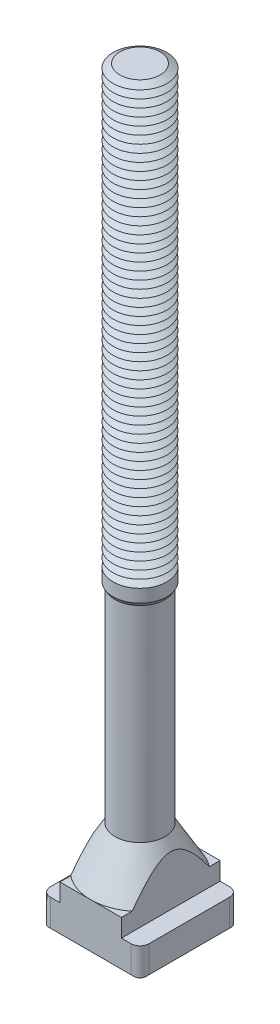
ISO-10303-21;
HEADER;
FILE_DESCRIPTION(('STEP AP214'),'2;1');
FILE_NAME('part.step','',(''),(''),'','','');
FILE_SCHEMA(('AUTOMOTIVE_DESIGN { 1 0 10303 214 1 1 1 1 }'));
ENDSEC;
DATA;
#1=APPLICATION_CONTEXT('core data for automotive mechanical design processes');
#2=APPLICATION_PROTOCOL_DEFINITION('international standard','automotive_design',2000,#1);
#3=PRODUCT_CONTEXT('',#1,'mechanical');
#4=PRODUCT('Part','Part','',(#3));
#5=PRODUCT_RELATED_PRODUCT_CATEGORY('part','',(#4));
#6=PRODUCT_DEFINITION_FORMATION('','',#4);
#7=PRODUCT_DEFINITION_CONTEXT('part definition',#1,'design');
#8=PRODUCT_DEFINITION('design','',#6,#7);
#9=PRODUCT_DEFINITION_SHAPE('','',#8);
#10=(LENGTH_UNIT() NAMED_UNIT(*) SI_UNIT(.MILLI.,.METRE.));
#11=(NAMED_UNIT(*) PLANE_ANGLE_UNIT() SI_UNIT($,.RADIAN.));
#12=(NAMED_UNIT(*) SI_UNIT($,.STERADIAN.) SOLID_ANGLE_UNIT());
#13=UNCERTAINTY_MEASURE_WITH_UNIT(LENGTH_MEASURE(1.E-05),#10,'distance_accuracy_value','');
#14=(GEOMETRIC_REPRESENTATION_CONTEXT(3) GLOBAL_UNCERTAINTY_ASSIGNED_CONTEXT((#13)) GLOBAL_UNIT_ASSIGNED_CONTEXT((#10,
#11,#12)) REPRESENTATION_CONTEXT('',''));
#15=CARTESIAN_POINT('',(0.,0.,0.));
#16=DIRECTION('',(0.,0.,1.));
#17=DIRECTION('',(1.,0.,0.));
#18=AXIS2_PLACEMENT_3D('',#15,#16,#17);
#19=CARTESIAN_POINT('',(0.,161.,0.));
#20=DIRECTION('',(0.,-1.,0.));
#21=DIRECTION('',(0.,0.,-1.));
#22=AXIS2_PLACEMENT_3D('',#19,#20,#21);
#23=CONICAL_SURFACE('',#22,4.48445554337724,1.04719755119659);
#24=CARTESIAN_POINT('',(0.,160.125,0.));
#25=DIRECTION('',(0.,-1.,0.));
#26=DIRECTION('',(0.,0.,-1.));
#27=AXIS2_PLACEMENT_3D('',#24,#25,#26);
#28=CIRCLE('',#27,6.00000000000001);
#29=CARTESIAN_POINT('',(0.,160.125,-6.00000000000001));
#30=VERTEX_POINT('',#29);
#31=EDGE_CURVE('E781',#30,#30,#28,.T.);
#32=ORIENTED_EDGE('',*,*,#31,.F.);
#33=EDGE_LOOP('',(#32));
#34=FACE_BOUND('',#33,.T.);
#35=CARTESIAN_POINT('',(0.,161.,0.));
#36=DIRECTION('',(0.,-1.,0.));
#37=DIRECTION('',(0.,0.,-1.));
#38=AXIS2_PLACEMENT_3D('',#35,#36,#37);
#39=CIRCLE('',#38,4.48445554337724);
#40=CARTESIAN_POINT('',(0.,161.,-4.48445554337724));
#41=VERTEX_POINT('',#40);
#42=EDGE_CURVE('E785',#41,#41,#39,.T.);
#43=ORIENTED_EDGE('',*,*,#42,.T.);
#44=EDGE_LOOP('',(#43));
#45=FACE_BOUND('',#44,.T.);
#46=ADVANCED_FACE('F39',(#34,#45),#23,.T.);
#47=CARTESIAN_POINT('',(0.,161.875,0.));
#48=DIRECTION('',(0.,1.,0.));
#49=DIRECTION('',(0.,0.,1.));
#50=AXIS2_PLACEMENT_3D('',#47,#48,#49);
#51=CONICAL_SURFACE('',#50,6.00000000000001,1.0471975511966);
#52=ORIENTED_EDGE('',*,*,#42,.F.);
#53=EDGE_LOOP('',(#52));
#54=FACE_BOUND('',#53,.T.);
#55=CARTESIAN_POINT('',(0.,161.875,0.));
#56=DIRECTION('',(0.,-1.,0.));
#57=DIRECTION('',(0.,0.,-1.));
#58=AXIS2_PLACEMENT_3D('',#55,#56,#57);
#59=CIRCLE('',#58,6.00000000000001);
#60=CARTESIAN_POINT('',(0.,161.875,-6.00000000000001));
#61=VERTEX_POINT('',#60);
#62=EDGE_CURVE('E789',#61,#61,#59,.T.);
#63=ORIENTED_EDGE('',*,*,#62,.T.);
#64=EDGE_LOOP('',(#63));
#65=FACE_BOUND('',#64,.T.);
#66=ADVANCED_FACE('F449',(#54,#65),#51,.T.);
#67=CARTESIAN_POINT('',(2.99966530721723,168.,0.));
#68=DIRECTION('',(0.,-1.,0.));
#69=DIRECTION('',(1.,0.,0.));
#70=AXIS2_PLACEMENT_3D('',#67,#68,#69);
#71=PLANE('',#70);
#72=CARTESIAN_POINT('',(0.,168.,0.));
#73=DIRECTION('',(0.,-1.,0.));
#74=DIRECTION('',(0.,0.,-1.));
#75=AXIS2_PLACEMENT_3D('',#72,#73,#74);
#76=CIRCLE('',#75,4.48445554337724);
#77=CARTESIAN_POINT('',(0.,168.,-4.48445554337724));
#78=VERTEX_POINT('',#77);
#79=EDGE_CURVE('E684',#78,#78,#76,.T.);
#80=ORIENTED_EDGE('',*,*,#79,.F.);
#81=EDGE_LOOP('',(#80));
#82=FACE_BOUND('',#81,.T.);
#83=ADVANCED_FACE('F455',(#82),#71,.F.);
#84=CARTESIAN_POINT('',(0.,168.,0.));
#85=DIRECTION('',(0.,-1.,0.));
#86=DIRECTION('',(0.,0.,-1.));
#87=AXIS2_PLACEMENT_3D('',#84,#85,#86);
#88=CONICAL_SURFACE('',#87,4.48445554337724,1.04719755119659);
#89=CARTESIAN_POINT('',(0.,167.125,0.));
#90=DIRECTION('',(0.,-1.,0.));
#91=DIRECTION('',(0.,0.,-1.));
#92=AXIS2_PLACEMENT_3D('',#89,#90,#91);
#93=CIRCLE('',#92,6.00000000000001);
#94=CARTESIAN_POINT('',(0.,167.125,-6.00000000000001));
#95=VERTEX_POINT('',#94);
#96=EDGE_CURVE('E687',#95,#95,#93,.T.);
#97=ORIENTED_EDGE('',*,*,#96,.F.);
#98=EDGE_LOOP('',(#97));
#99=FACE_BOUND('',#98,.T.);
#100=ORIENTED_EDGE('',*,*,#79,.T.);
#101=EDGE_LOOP('',(#100));
#102=FACE_BOUND('',#101,.T.);
#103=ADVANCED_FACE('F483',(#99,#102),#88,.T.);
#104=CARTESIAN_POINT('',(0.,167.125,0.));
#105=DIRECTION('',(0.,1.,0.));
#106=DIRECTION('',(0.,0.,1.));
#107=AXIS2_PLACEMENT_3D('',#104,#105,#106);
#108=CONICAL_SURFACE('',#107,6.00000000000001,1.0471975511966);
#109=CARTESIAN_POINT('',(0.,166.25,0.));
#110=DIRECTION('',(0.,-1.,0.));
#111=DIRECTION('',(0.,0.,-1.));
#112=AXIS2_PLACEMENT_3D('',#109,#110,#111);
#113=CIRCLE('',#112,4.48445554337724);
#114=CARTESIAN_POINT('',(0.,166.25,-4.48445554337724));
#115=VERTEX_POINT('',#114);
#116=EDGE_CURVE('E808',#115,#115,#113,.T.);
#117=ORIENTED_EDGE('',*,*,#116,.F.);
#118=EDGE_LOOP('',(#117));
#119=FACE_BOUND('',#118,.T.);
#120=ORIENTED_EDGE('',*,*,#96,.T.);
#121=EDGE_LOOP('',(#120));
#122=FACE_BOUND('',#121,.T.);
#123=ADVANCED_FACE('F480',(#119,#122),#108,.T.);
#124=CARTESIAN_POINT('',(0.,166.25,0.));
#125=DIRECTION('',(0.,-1.,0.));
#126=DIRECTION('',(0.,0.,-1.));
#127=AXIS2_PLACEMENT_3D('',#124,#125,#126);
#128=CONICAL_SURFACE('',#127,4.48445554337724,1.04719755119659);
#129=CARTESIAN_POINT('',(0.,165.375,0.));
#130=DIRECTION('',(0.,-1.,0.));
#131=DIRECTION('',(0.,0.,-1.));
#132=AXIS2_PLACEMENT_3D('',#129,#130,#131);
#133=CIRCLE('',#132,6.00000000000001);
#134=CARTESIAN_POINT('',(0.,165.375,-6.00000000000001));
#135=VERTEX_POINT('',#134);
#136=EDGE_CURVE('E805',#135,#135,#133,.T.);
#137=ORIENTED_EDGE('',*,*,#136,.F.);
#138=EDGE_LOOP('',(#137));
#139=FACE_BOUND('',#138,.T.);
#140=ORIENTED_EDGE('',*,*,#116,.T.);
#141=EDGE_LOOP('',(#140));
#142=FACE_BOUND('',#141,.T.);
#143=ADVANCED_FACE('F475',(#139,#142),#128,.T.);
#144=CARTESIAN_POINT('',(0.,165.375,0.));
#145=DIRECTION('',(0.,1.,0.));
#146=DIRECTION('',(0.,0.,1.));
#147=AXIS2_PLACEMENT_3D('',#144,#145,#146);
#148=CONICAL_SURFACE('',#147,6.00000000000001,1.0471975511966);
#149=CARTESIAN_POINT('',(0.,164.5,0.));
#150=DIRECTION('',(0.,-1.,0.));
#151=DIRECTION('',(0.,0.,-1.));
#152=AXIS2_PLACEMENT_3D('',#149,#150,#151);
#153=CIRCLE('',#152,4.48445554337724);
#154=CARTESIAN_POINT('',(0.,164.5,-4.48445554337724));
#155=VERTEX_POINT('',#154);
#156=EDGE_CURVE('E801',#155,#155,#153,.T.);
#157=ORIENTED_EDGE('',*,*,#156,.F.);
#158=EDGE_LOOP('',(#157));
#159=FACE_BOUND('',#158,.T.);
#160=ORIENTED_EDGE('',*,*,#136,.T.);
#161=EDGE_LOOP('',(#160));
#162=FACE_BOUND('',#161,.T.);
#163=ADVANCED_FACE('F472',(#159,#162),#148,.T.);
#164=CARTESIAN_POINT('',(0.,164.5,0.));
#165=DIRECTION('',(0.,-1.,0.));
#166=DIRECTION('',(0.,0.,-1.));
#167=AXIS2_PLACEMENT_3D('',#164,#165,#166);
#168=CONICAL_SURFACE('',#167,4.48445554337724,1.04719755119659);
#169=CARTESIAN_POINT('',(0.,163.625,0.));
#170=DIRECTION('',(0.,-1.,0.));
#171=DIRECTION('',(0.,0.,-1.));
#172=AXIS2_PLACEMENT_3D('',#169,#170,#171);
#173=CIRCLE('',#172,6.00000000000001);
#174=CARTESIAN_POINT('',(0.,163.625,-6.00000000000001));
#175=VERTEX_POINT('',#174);
#176=EDGE_CURVE('E797',#175,#175,#173,.T.);
#177=ORIENTED_EDGE('',*,*,#176,.F.);
#178=EDGE_LOOP('',(#177));
#179=FACE_BOUND('',#178,.T.);
#180=ORIENTED_EDGE('',*,*,#156,.T.);
#181=EDGE_LOOP('',(#180));
#182=FACE_BOUND('',#181,.T.);
#183=ADVANCED_FACE('F466',(#179,#182),#168,.T.);
#184=CARTESIAN_POINT('',(0.,163.625,0.));
#185=DIRECTION('',(0.,1.,0.));
#186=DIRECTION('',(0.,0.,1.));
#187=AXIS2_PLACEMENT_3D('',#184,#185,#186);
#188=CONICAL_SURFACE('',#187,6.00000000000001,1.0471975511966);
#189=CARTESIAN_POINT('',(0.,162.75,0.));
#190=DIRECTION('',(0.,-1.,0.));
#191=DIRECTION('',(0.,0.,-1.));
#192=AXIS2_PLACEMENT_3D('',#189,#190,#191);
#193=CIRCLE('',#192,4.48445554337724);
#194=CARTESIAN_POINT('',(0.,162.75,-4.48445554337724));
#195=VERTEX_POINT('',#194);
#196=EDGE_CURVE('E793',#195,#195,#193,.T.);
#197=ORIENTED_EDGE('',*,*,#196,.F.);
#198=EDGE_LOOP('',(#197));
#199=FACE_BOUND('',#198,.T.);
#200=ORIENTED_EDGE('',*,*,#176,.T.);
#201=EDGE_LOOP('',(#200));
#202=FACE_BOUND('',#201,.T.);
#203=ADVANCED_FACE('F462',(#199,#202),#188,.T.);
#204=CARTESIAN_POINT('',(0.,162.75,0.));
#205=DIRECTION('',(0.,-1.,0.));
#206=DIRECTION('',(0.,0.,-1.));
#207=AXIS2_PLACEMENT_3D('',#204,#205,#206);
#208=CONICAL_SURFACE('',#207,4.48445554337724,1.04719755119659);
#209=ORIENTED_EDGE('',*,*,#62,.F.);
#210=EDGE_LOOP('',(#209));
#211=FACE_BOUND('',#210,.T.);
#212=ORIENTED_EDGE('',*,*,#196,.T.);
#213=EDGE_LOOP('',(#212));
#214=FACE_BOUND('',#213,.T.);
#215=ADVANCED_FACE('F465',(#211,#214),#208,.T.);
#216=CARTESIAN_POINT('',(0.,159.25,0.));
#217=DIRECTION('',(0.,-1.,0.));
#218=DIRECTION('',(0.,0.,-1.));
#219=AXIS2_PLACEMENT_3D('',#216,#217,#218);
#220=CONICAL_SURFACE('',#219,4.48445554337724,1.04719755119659);
#221=CARTESIAN_POINT('',(0.,158.375,0.));
#222=DIRECTION('',(0.,-1.,0.));
#223=DIRECTION('',(0.,0.,-1.));
#224=AXIS2_PLACEMENT_3D('',#221,#222,#223);
#225=CIRCLE('',#224,6.00000000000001);
#226=CARTESIAN_POINT('',(0.,158.375,-6.00000000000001));
#227=VERTEX_POINT('',#226);
#228=EDGE_CURVE('E773',#227,#227,#225,.T.);
#229=ORIENTED_EDGE('',*,*,#228,.F.);
#230=EDGE_LOOP('',(#229));
#231=FACE_BOUND('',#230,.T.);
#232=CARTESIAN_POINT('',(0.,159.25,0.));
#233=DIRECTION('',(0.,-1.,0.));
#234=DIRECTION('',(0.,0.,-1.));
#235=AXIS2_PLACEMENT_3D('',#232,#233,#234);
#236=CIRCLE('',#235,4.48445554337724);
#237=CARTESIAN_POINT('',(0.,159.25,-4.48445554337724));
#238=VERTEX_POINT('',#237);
#239=EDGE_CURVE('E777',#238,#238,#236,.T.);
#240=ORIENTED_EDGE('',*,*,#239,.T.);
#241=EDGE_LOOP('',(#240));
#242=FACE_BOUND('',#241,.T.);
#243=ADVANCED_FACE('F470',(#231,#242),#220,.T.);
#244=CARTESIAN_POINT('',(0.,160.125,0.));
#245=DIRECTION('',(0.,1.,0.));
#246=DIRECTION('',(0.,0.,1.));
#247=AXIS2_PLACEMENT_3D('',#244,#245,#246);
#248=CONICAL_SURFACE('',#247,6.00000000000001,1.0471975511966);
#249=ORIENTED_EDGE('',*,*,#239,.F.);
#250=EDGE_LOOP('',(#249));
#251=FACE_BOUND('',#250,.T.);
#252=ORIENTED_EDGE('',*,*,#31,.T.);
#253=EDGE_LOOP('',(#252));
#254=FACE_BOUND('',#253,.T.);
#255=ADVANCED_FACE('F920',(#251,#254),#248,.T.);
#256=CARTESIAN_POINT('',(0.,157.5,0.));
#257=DIRECTION('',(0.,-1.,0.));
#258=DIRECTION('',(0.,0.,-1.));
#259=AXIS2_PLACEMENT_3D('',#256,#257,#258);
#260=CONICAL_SURFACE('',#259,4.48445554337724,1.04719755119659);
#261=CARTESIAN_POINT('',(0.,156.625,0.));
#262=DIRECTION('',(0.,-1.,0.));
#263=DIRECTION('',(0.,0.,-1.));
#264=AXIS2_PLACEMENT_3D('',#261,#262,#263);
#265=CIRCLE('',#264,6.00000000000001);
#266=CARTESIAN_POINT('',(0.,156.625,-6.00000000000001));
#267=VERTEX_POINT('',#266);
#268=EDGE_CURVE('E759',#267,#267,#265,.T.);
#269=ORIENTED_EDGE('',*,*,#268,.F.);
#270=EDGE_LOOP('',(#269));
#271=FACE_BOUND('',#270,.T.);
#272=CARTESIAN_POINT('',(0.,157.5,0.));
#273=DIRECTION('',(0.,-1.,0.));
#274=DIRECTION('',(0.,0.,-1.));
#275=AXIS2_PLACEMENT_3D('',#272,#273,#274);
#276=CIRCLE('',#275,4.48445554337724);
#277=CARTESIAN_POINT('',(0.,157.5,-4.48445554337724));
#278=VERTEX_POINT('',#277);
#279=EDGE_CURVE('E769',#278,#278,#276,.T.);
#280=ORIENTED_EDGE('',*,*,#279,.T.);
#281=EDGE_LOOP('',(#280));
#282=FACE_BOUND('',#281,.T.);
#283=ADVANCED_FACE('F916',(#271,#282),#260,.T.);
#284=CARTESIAN_POINT('',(0.,158.375,0.));
#285=DIRECTION('',(0.,1.,0.));
#286=DIRECTION('',(0.,0.,1.));
#287=AXIS2_PLACEMENT_3D('',#284,#285,#286);
#288=CONICAL_SURFACE('',#287,6.00000000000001,1.0471975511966);
#289=ORIENTED_EDGE('',*,*,#279,.F.);
#290=EDGE_LOOP('',(#289));
#291=FACE_BOUND('',#290,.T.);
#292=ORIENTED_EDGE('',*,*,#228,.T.);
#293=EDGE_LOOP('',(#292));
#294=FACE_BOUND('',#293,.T.);
#295=ADVANCED_FACE('F912',(#291,#294),#288,.T.);
#296=CARTESIAN_POINT('',(0.,155.75,0.));
#297=DIRECTION('',(0.,-1.,0.));
#298=DIRECTION('',(0.,0.,-1.));
#299=AXIS2_PLACEMENT_3D('',#296,#297,#298);
#300=CONICAL_SURFACE('',#299,4.48445554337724,1.04719755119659);
#301=CARTESIAN_POINT('',(0.,154.875,0.));
#302=DIRECTION('',(0.,-1.,0.));
#303=DIRECTION('',(0.,0.,-1.));
#304=AXIS2_PLACEMENT_3D('',#301,#302,#303);
#305=CIRCLE('',#304,6.00000000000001);
#306=CARTESIAN_POINT('',(0.,154.875,-6.00000000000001));
#307=VERTEX_POINT('',#306);
#308=EDGE_CURVE('E751',#307,#307,#305,.T.);
#309=ORIENTED_EDGE('',*,*,#308,.F.);
#310=EDGE_LOOP('',(#309));
#311=FACE_BOUND('',#310,.T.);
#312=CARTESIAN_POINT('',(0.,155.75,0.));
#313=DIRECTION('',(0.,-1.,0.));
#314=DIRECTION('',(0.,0.,-1.));
#315=AXIS2_PLACEMENT_3D('',#312,#313,#314);
#316=CIRCLE('',#315,4.48445554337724);
#317=CARTESIAN_POINT('',(0.,155.75,-4.48445554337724));
#318=VERTEX_POINT('',#317);
#319=EDGE_CURVE('E753',#318,#318,#316,.T.);
#320=ORIENTED_EDGE('',*,*,#319,.T.);
#321=EDGE_LOOP('',(#320));
#322=FACE_BOUND('',#321,.T.);
#323=ADVANCED_FACE('F908',(#311,#322),#300,.T.);
#324=CARTESIAN_POINT('',(0.,156.625,0.));
#325=DIRECTION('',(0.,1.,0.));
#326=DIRECTION('',(0.,0.,1.));
#327=AXIS2_PLACEMENT_3D('',#324,#325,#326);
#328=CONICAL_SURFACE('',#327,6.00000000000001,1.0471975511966);
#329=ORIENTED_EDGE('',*,*,#319,.F.);
#330=EDGE_LOOP('',(#329));
#331=FACE_BOUND('',#330,.T.);
#332=ORIENTED_EDGE('',*,*,#268,.T.);
#333=EDGE_LOOP('',(#332));
#334=FACE_BOUND('',#333,.T.);
#335=ADVANCED_FACE('F892',(#331,#334),#328,.T.);
#336=CARTESIAN_POINT('',(0.,154.,0.));
#337=DIRECTION('',(0.,-1.,0.));
#338=DIRECTION('',(0.,0.,-1.));
#339=AXIS2_PLACEMENT_3D('',#336,#337,#338);
#340=CONICAL_SURFACE('',#339,4.48445554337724,1.04719755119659);
#341=CARTESIAN_POINT('',(0.,153.125,0.));
#342=DIRECTION('',(0.,-1.,0.));
#343=DIRECTION('',(0.,0.,-1.));
#344=AXIS2_PLACEMENT_3D('',#341,#342,#343);
#345=CIRCLE('',#344,6.00000000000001);
#346=CARTESIAN_POINT('',(0.,153.125,-6.00000000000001));
#347=VERTEX_POINT('',#346);
#348=EDGE_CURVE('E762',#347,#347,#345,.T.);
#349=ORIENTED_EDGE('',*,*,#348,.F.);
#350=EDGE_LOOP('',(#349));
#351=FACE_BOUND('',#350,.T.);
#352=CARTESIAN_POINT('',(0.,154.,0.));
#353=DIRECTION('',(0.,-1.,0.));
#354=DIRECTION('',(0.,0.,-1.));
#355=AXIS2_PLACEMENT_3D('',#352,#353,#354);
#356=CIRCLE('',#355,4.48445554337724);
#357=CARTESIAN_POINT('',(0.,154.,-4.48445554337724));
#358=VERTEX_POINT('',#357);
#359=EDGE_CURVE('E651',#358,#358,#356,.T.);
#360=ORIENTED_EDGE('',*,*,#359,.T.);
#361=EDGE_LOOP('',(#360));
#362=FACE_BOUND('',#361,.T.);
#363=ADVANCED_FACE('F888',(#351,#362),#340,.T.);
#364=CARTESIAN_POINT('',(0.,154.875,0.));
#365=DIRECTION('',(0.,1.,0.));
#366=DIRECTION('',(0.,0.,1.));
#367=AXIS2_PLACEMENT_3D('',#364,#365,#366);
#368=CONICAL_SURFACE('',#367,6.00000000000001,1.0471975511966);
#369=ORIENTED_EDGE('',*,*,#359,.F.);
#370=EDGE_LOOP('',(#369));
#371=FACE_BOUND('',#370,.T.);
#372=ORIENTED_EDGE('',*,*,#308,.T.);
#373=EDGE_LOOP('',(#372));
#374=FACE_BOUND('',#373,.T.);
#375=ADVANCED_FACE('F891',(#371,#374),#368,.T.);
#376=CARTESIAN_POINT('',(0.,152.25,0.));
#377=DIRECTION('',(0.,-1.,0.));
#378=DIRECTION('',(0.,0.,-1.));
#379=AXIS2_PLACEMENT_3D('',#376,#377,#378);
#380=CONICAL_SURFACE('',#379,4.48445554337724,1.04719755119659);
#381=CARTESIAN_POINT('',(0.,151.375,0.));
#382=DIRECTION('',(0.,-1.,0.));
#383=DIRECTION('',(0.,0.,-1.));
#384=AXIS2_PLACEMENT_3D('',#381,#382,#383);
#385=CIRCLE('',#384,6.00000000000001);
#386=CARTESIAN_POINT('',(0.,151.375,-6.00000000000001));
#387=VERTEX_POINT('',#386);
#388=EDGE_CURVE('E874',#387,#387,#385,.T.);
#389=ORIENTED_EDGE('',*,*,#388,.F.);
#390=EDGE_LOOP('',(#389));
#391=FACE_BOUND('',#390,.T.);
#392=CARTESIAN_POINT('',(0.,152.25,0.));
#393=DIRECTION('',(0.,-1.,0.));
#394=DIRECTION('',(0.,0.,-1.));
#395=AXIS2_PLACEMENT_3D('',#392,#393,#394);
#396=CIRCLE('',#395,4.48445554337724);
#397=CARTESIAN_POINT('',(0.,152.25,-4.48445554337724));
#398=VERTEX_POINT('',#397);
#399=EDGE_CURVE('E878',#398,#398,#396,.T.);
#400=ORIENTED_EDGE('',*,*,#399,.T.);
#401=EDGE_LOOP('',(#400));
#402=FACE_BOUND('',#401,.T.);
#403=ADVANCED_FACE('F897',(#391,#402),#380,.T.);
#404=CARTESIAN_POINT('',(0.,153.125,0.));
#405=DIRECTION('',(0.,1.,0.));
#406=DIRECTION('',(0.,0.,1.));
#407=AXIS2_PLACEMENT_3D('',#404,#405,#406);
#408=CONICAL_SURFACE('',#407,6.00000000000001,1.0471975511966);
#409=ORIENTED_EDGE('',*,*,#399,.F.);
#410=EDGE_LOOP('',(#409));
#411=FACE_BOUND('',#410,.T.);
#412=ORIENTED_EDGE('',*,*,#348,.T.);
#413=EDGE_LOOP('',(#412));
#414=FACE_BOUND('',#413,.T.);
#415=ADVANCED_FACE('F886',(#411,#414),#408,.T.);
#416=CARTESIAN_POINT('',(0.,150.5,0.));
#417=DIRECTION('',(0.,-1.,0.));
#418=DIRECTION('',(0.,0.,-1.));
#419=AXIS2_PLACEMENT_3D('',#416,#417,#418);
#420=CONICAL_SURFACE('',#419,4.48445554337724,1.04719755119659);
#421=CARTESIAN_POINT('',(0.,149.625,0.));
#422=DIRECTION('',(0.,-1.,0.));
#423=DIRECTION('',(0.,0.,-1.));
#424=AXIS2_PLACEMENT_3D('',#421,#422,#423);
#425=CIRCLE('',#424,6.00000000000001);
#426=CARTESIAN_POINT('',(0.,149.625,-6.00000000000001));
#427=VERTEX_POINT('',#426);
#428=EDGE_CURVE('E746',#427,#427,#425,.T.);
#429=ORIENTED_EDGE('',*,*,#428,.F.);
#430=EDGE_LOOP('',(#429));
#431=FACE_BOUND('',#430,.T.);
#432=CARTESIAN_POINT('',(0.,150.5,0.));
#433=DIRECTION('',(0.,-1.,0.));
#434=DIRECTION('',(0.,0.,-1.));
#435=AXIS2_PLACEMENT_3D('',#432,#433,#434);
#436=CIRCLE('',#435,4.48445554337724);
#437=CARTESIAN_POINT('',(0.,150.5,-4.48445554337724));
#438=VERTEX_POINT('',#437);
#439=EDGE_CURVE('E748',#438,#438,#436,.T.);
#440=ORIENTED_EDGE('',*,*,#439,.T.);
#441=EDGE_LOOP('',(#440));
#442=FACE_BOUND('',#441,.T.);
#443=ADVANCED_FACE('F968',(#431,#442),#420,.T.);
#444=CARTESIAN_POINT('',(0.,151.375,0.));
#445=DIRECTION('',(0.,1.,0.));
#446=DIRECTION('',(0.,0.,1.));
#447=AXIS2_PLACEMENT_3D('',#444,#445,#446);
#448=CONICAL_SURFACE('',#447,6.00000000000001,1.0471975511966);
#449=ORIENTED_EDGE('',*,*,#439,.F.);
#450=EDGE_LOOP('',(#449));
#451=FACE_BOUND('',#450,.T.);
#452=ORIENTED_EDGE('',*,*,#388,.T.);
#453=EDGE_LOOP('',(#452));
#454=FACE_BOUND('',#453,.T.);
#455=ADVANCED_FACE('F976',(#451,#454),#448,.T.);
#456=CARTESIAN_POINT('',(0.,148.75,0.));
#457=DIRECTION('',(0.,-1.,0.));
#458=DIRECTION('',(0.,0.,-1.));
#459=AXIS2_PLACEMENT_3D('',#456,#457,#458);
#460=CONICAL_SURFACE('',#459,4.48445554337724,1.04719755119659);
#461=CARTESIAN_POINT('',(0.,147.875,0.));
#462=DIRECTION('',(0.,-1.,0.));
#463=DIRECTION('',(0.,0.,-1.));
#464=AXIS2_PLACEMENT_3D('',#461,#462,#463);
#465=CIRCLE('',#464,6.00000000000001);
#466=CARTESIAN_POINT('',(0.,147.875,-6.00000000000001));
#467=VERTEX_POINT('',#466);
#468=EDGE_CURVE('E865',#467,#467,#465,.T.);
#469=ORIENTED_EDGE('',*,*,#468,.F.);
#470=EDGE_LOOP('',(#469));
#471=FACE_BOUND('',#470,.T.);
#472=CARTESIAN_POINT('',(0.,148.75,0.));
#473=DIRECTION('',(0.,-1.,0.));
#474=DIRECTION('',(0.,0.,-1.));
#475=AXIS2_PLACEMENT_3D('',#472,#473,#474);
#476=CIRCLE('',#475,4.48445554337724);
#477=CARTESIAN_POINT('',(0.,148.75,-4.48445554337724));
#478=VERTEX_POINT('',#477);
#479=EDGE_CURVE('E749',#478,#478,#476,.T.);
#480=ORIENTED_EDGE('',*,*,#479,.T.);
#481=EDGE_LOOP('',(#480));
#482=FACE_BOUND('',#481,.T.);
#483=ADVANCED_FACE('F985',(#471,#482),#460,.T.);
#484=CARTESIAN_POINT('',(0.,149.625,0.));
#485=DIRECTION('',(0.,1.,0.));
#486=DIRECTION('',(0.,0.,1.));
#487=AXIS2_PLACEMENT_3D('',#484,#485,#486);
#488=CONICAL_SURFACE('',#487,6.00000000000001,1.0471975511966);
#489=ORIENTED_EDGE('',*,*,#479,.F.);
#490=EDGE_LOOP('',(#489));
#491=FACE_BOUND('',#490,.T.);
#492=ORIENTED_EDGE('',*,*,#428,.T.);
#493=EDGE_LOOP('',(#492));
#494=FACE_BOUND('',#493,.T.);
#495=ADVANCED_FACE('F994',(#491,#494),#488,.T.);
#496=CARTESIAN_POINT('',(0.,147.,0.));
#497=DIRECTION('',(0.,-1.,0.));
#498=DIRECTION('',(0.,0.,-1.));
#499=AXIS2_PLACEMENT_3D('',#496,#497,#498);
#500=CONICAL_SURFACE('',#499,4.48445554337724,1.04719755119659);
#501=CARTESIAN_POINT('',(0.,146.125,0.));
#502=DIRECTION('',(0.,-1.,0.));
#503=DIRECTION('',(0.,0.,-1.));
#504=AXIS2_PLACEMENT_3D('',#501,#502,#503);
#505=CIRCLE('',#504,6.00000000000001);
#506=CARTESIAN_POINT('',(0.,146.125,-6.00000000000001));
#507=VERTEX_POINT('',#506);
#508=EDGE_CURVE('E857',#507,#507,#505,.T.);
#509=ORIENTED_EDGE('',*,*,#508,.F.);
#510=EDGE_LOOP('',(#509));
#511=FACE_BOUND('',#510,.T.);
#512=CARTESIAN_POINT('',(0.,147.,0.));
#513=DIRECTION('',(0.,-1.,0.));
#514=DIRECTION('',(0.,0.,-1.));
#515=AXIS2_PLACEMENT_3D('',#512,#513,#514);
#516=CIRCLE('',#515,4.48445554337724);
#517=CARTESIAN_POINT('',(0.,147.,-4.48445554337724));
#518=VERTEX_POINT('',#517);
#519=EDGE_CURVE('E861',#518,#518,#516,.T.);
#520=ORIENTED_EDGE('',*,*,#519,.T.);
#521=EDGE_LOOP('',(#520));
#522=FACE_BOUND('',#521,.T.);
#523=ADVANCED_FACE('F1003',(#511,#522),#500,.T.);
#524=CARTESIAN_POINT('',(0.,147.875,0.));
#525=DIRECTION('',(0.,1.,0.));
#526=DIRECTION('',(0.,0.,1.));
#527=AXIS2_PLACEMENT_3D('',#524,#525,#526);
#528=CONICAL_SURFACE('',#527,6.00000000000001,1.0471975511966);
#529=ORIENTED_EDGE('',*,*,#519,.F.);
#530=EDGE_LOOP('',(#529));
#531=FACE_BOUND('',#530,.T.);
#532=ORIENTED_EDGE('',*,*,#468,.T.);
#533=EDGE_LOOP('',(#532));
#534=FACE_BOUND('',#533,.T.);
#535=ADVANCED_FACE('F1012',(#531,#534),#528,.T.);
#536=CARTESIAN_POINT('',(0.,145.25,0.));
#537=DIRECTION('',(0.,-1.,0.));
#538=DIRECTION('',(0.,0.,-1.));
#539=AXIS2_PLACEMENT_3D('',#536,#537,#538);
#540=CONICAL_SURFACE('',#539,4.48445554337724,1.04719755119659);
#541=CARTESIAN_POINT('',(0.,144.375,0.));
#542=DIRECTION('',(0.,-1.,0.));
#543=DIRECTION('',(0.,0.,-1.));
#544=AXIS2_PLACEMENT_3D('',#541,#542,#543);
#545=CIRCLE('',#544,6.00000000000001);
#546=CARTESIAN_POINT('',(0.,144.375,-6.00000000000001));
#547=VERTEX_POINT('',#546);
#548=EDGE_CURVE('E728',#547,#547,#545,.T.);
#549=ORIENTED_EDGE('',*,*,#548,.F.);
#550=EDGE_LOOP('',(#549));
#551=FACE_BOUND('',#550,.T.);
#552=CARTESIAN_POINT('',(0.,145.25,0.));
#553=DIRECTION('',(0.,-1.,0.));
#554=DIRECTION('',(0.,0.,-1.));
#555=AXIS2_PLACEMENT_3D('',#552,#553,#554);
#556=CIRCLE('',#555,4.48445554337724);
#557=CARTESIAN_POINT('',(0.,145.25,-4.48445554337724));
#558=VERTEX_POINT('',#557);
#559=EDGE_CURVE('E730',#558,#558,#556,.T.);
#560=ORIENTED_EDGE('',*,*,#559,.T.);
#561=EDGE_LOOP('',(#560));
#562=FACE_BOUND('',#561,.T.);
#563=ADVANCED_FACE('F1021',(#551,#562),#540,.T.);
#564=CARTESIAN_POINT('',(0.,146.125,0.));
#565=DIRECTION('',(0.,1.,0.));
#566=DIRECTION('',(0.,0.,1.));
#567=AXIS2_PLACEMENT_3D('',#564,#565,#566);
#568=CONICAL_SURFACE('',#567,6.00000000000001,1.0471975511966);
#569=ORIENTED_EDGE('',*,*,#559,.F.);
#570=EDGE_LOOP('',(#569));
#571=FACE_BOUND('',#570,.T.);
#572=ORIENTED_EDGE('',*,*,#508,.T.);
#573=EDGE_LOOP('',(#572));
#574=FACE_BOUND('',#573,.T.);
#575=ADVANCED_FACE('F1030',(#571,#574),#568,.T.);
#576=CARTESIAN_POINT('',(0.,143.5,0.));
#577=DIRECTION('',(0.,-1.,0.));
#578=DIRECTION('',(0.,0.,-1.));
#579=AXIS2_PLACEMENT_3D('',#576,#577,#578);
#580=CONICAL_SURFACE('',#579,4.48445554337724,1.04719755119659);
#581=CARTESIAN_POINT('',(0.,142.625,0.));
#582=DIRECTION('',(0.,-1.,0.));
#583=DIRECTION('',(0.,0.,-1.));
#584=AXIS2_PLACEMENT_3D('',#581,#582,#583);
#585=CIRCLE('',#584,6.00000000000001);
#586=CARTESIAN_POINT('',(0.,142.625,-6.00000000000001));
#587=VERTEX_POINT('',#586);
#588=EDGE_CURVE('E841',#587,#587,#585,.T.);
#589=ORIENTED_EDGE('',*,*,#588,.F.);
#590=EDGE_LOOP('',(#589));
#591=FACE_BOUND('',#590,.T.);
#592=CARTESIAN_POINT('',(0.,143.5,0.));
#593=DIRECTION('',(0.,-1.,0.));
#594=DIRECTION('',(0.,0.,-1.));
#595=AXIS2_PLACEMENT_3D('',#592,#593,#594);
#596=CIRCLE('',#595,4.48445554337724);
#597=CARTESIAN_POINT('',(0.,143.5,-4.48445554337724));
#598=VERTEX_POINT('',#597);
#599=EDGE_CURVE('E731',#598,#598,#596,.T.);
#600=ORIENTED_EDGE('',*,*,#599,.T.);
#601=EDGE_LOOP('',(#600));
#602=FACE_BOUND('',#601,.T.);
#603=ADVANCED_FACE('F1039',(#591,#602),#580,.T.);
#604=CARTESIAN_POINT('',(0.,144.375,0.));
#605=DIRECTION('',(0.,1.,0.));
#606=DIRECTION('',(0.,0.,1.));
#607=AXIS2_PLACEMENT_3D('',#604,#605,#606);
#608=CONICAL_SURFACE('',#607,6.00000000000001,1.0471975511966);
#609=ORIENTED_EDGE('',*,*,#599,.F.);
#610=EDGE_LOOP('',(#609));
#611=FACE_BOUND('',#610,.T.);
#612=ORIENTED_EDGE('',*,*,#548,.T.);
#613=EDGE_LOOP('',(#612));
#614=FACE_BOUND('',#613,.T.);
#615=ADVANCED_FACE('F1048',(#611,#614),#608,.T.);
#616=CARTESIAN_POINT('',(0.,141.75,0.));
#617=DIRECTION('',(0.,-1.,0.));
#618=DIRECTION('',(0.,0.,-1.));
#619=AXIS2_PLACEMENT_3D('',#616,#617,#618);
#620=CONICAL_SURFACE('',#619,4.48445554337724,1.04719755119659);
#621=CARTESIAN_POINT('',(0.,140.875,0.));
#622=DIRECTION('',(0.,-1.,0.));
#623=DIRECTION('',(0.,0.,-1.));
#624=AXIS2_PLACEMENT_3D('',#621,#622,#623);
#625=CIRCLE('',#624,6.00000000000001);
#626=CARTESIAN_POINT('',(0.,140.875,-6.00000000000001));
#627=VERTEX_POINT('',#626);
#628=EDGE_CURVE('E681',#627,#627,#625,.T.);
#629=ORIENTED_EDGE('',*,*,#628,.F.);
#630=EDGE_LOOP('',(#629));
#631=FACE_BOUND('',#630,.T.);
#632=CARTESIAN_POINT('',(0.,141.75,0.));
#633=DIRECTION('',(0.,-1.,0.));
#634=DIRECTION('',(0.,0.,-1.));
#635=AXIS2_PLACEMENT_3D('',#632,#633,#634);
#636=CIRCLE('',#635,4.48445554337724);
#637=CARTESIAN_POINT('',(0.,141.75,-4.48445554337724));
#638=VERTEX_POINT('',#637);
#639=EDGE_CURVE('E839',#638,#638,#636,.T.);
#640=ORIENTED_EDGE('',*,*,#639,.T.);
#641=EDGE_LOOP('',(#640));
#642=FACE_BOUND('',#641,.T.);
#643=ADVANCED_FACE('F1057',(#631,#642),#620,.T.);
#644=CARTESIAN_POINT('',(0.,142.625,0.));
#645=DIRECTION('',(0.,1.,0.));
#646=DIRECTION('',(0.,0.,1.));
#647=AXIS2_PLACEMENT_3D('',#644,#645,#646);
#648=CONICAL_SURFACE('',#647,6.00000000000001,1.0471975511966);
#649=ORIENTED_EDGE('',*,*,#639,.F.);
#650=EDGE_LOOP('',(#649));
#651=FACE_BOUND('',#650,.T.);
#652=ORIENTED_EDGE('',*,*,#588,.T.);
#653=EDGE_LOOP('',(#652));
#654=FACE_BOUND('',#653,.T.);
#655=ADVANCED_FACE('F1066',(#651,#654),#648,.T.);
#656=CARTESIAN_POINT('',(0.,140.,0.));
#657=DIRECTION('',(0.,-1.,0.));
#658=DIRECTION('',(0.,0.,-1.));
#659=AXIS2_PLACEMENT_3D('',#656,#657,#658);
#660=CONICAL_SURFACE('',#659,4.48445554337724,1.04719755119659);
#661=CARTESIAN_POINT('',(0.,139.125,0.));
#662=DIRECTION('',(0.,-1.,0.));
#663=DIRECTION('',(0.,0.,-1.));
#664=AXIS2_PLACEMENT_3D('',#661,#662,#663);
#665=CIRCLE('',#664,6.00000000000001);
#666=CARTESIAN_POINT('',(0.,139.125,-6.00000000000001));
#667=VERTEX_POINT('',#666);
#668=EDGE_CURVE('E682',#667,#667,#665,.T.);
#669=ORIENTED_EDGE('',*,*,#668,.F.);
#670=EDGE_LOOP('',(#669));
#671=FACE_BOUND('',#670,.T.);
#672=CARTESIAN_POINT('',(0.,140.,0.));
#673=DIRECTION('',(0.,-1.,0.));
#674=DIRECTION('',(0.,0.,-1.));
#675=AXIS2_PLACEMENT_3D('',#672,#673,#674);
#676=CIRCLE('',#675,4.48445554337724);
#677=CARTESIAN_POINT('',(0.,140.,-4.48445554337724));
#678=VERTEX_POINT('',#677);
#679=EDGE_CURVE('E678',#678,#678,#676,.T.);
#680=ORIENTED_EDGE('',*,*,#679,.T.);
#681=EDGE_LOOP('',(#680));
#682=FACE_BOUND('',#681,.T.);
#683=ADVANCED_FACE('F1075',(#671,#682),#660,.T.);
#684=CARTESIAN_POINT('',(0.,140.875,0.));
#685=DIRECTION('',(0.,1.,0.));
#686=DIRECTION('',(0.,0.,1.));
#687=AXIS2_PLACEMENT_3D('',#684,#685,#686);
#688=CONICAL_SURFACE('',#687,6.00000000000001,1.0471975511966);
#689=ORIENTED_EDGE('',*,*,#679,.F.);
#690=EDGE_LOOP('',(#689));
#691=FACE_BOUND('',#690,.T.);
#692=ORIENTED_EDGE('',*,*,#628,.T.);
#693=EDGE_LOOP('',(#692));
#694=FACE_BOUND('',#693,.T.);
#695=ADVANCED_FACE('F1084',(#691,#694),#688,.T.);
#696=CARTESIAN_POINT('',(0.,138.25,0.));
#697=DIRECTION('',(0.,-1.,0.));
#698=DIRECTION('',(0.,0.,-1.));
#699=AXIS2_PLACEMENT_3D('',#696,#697,#698);
#700=CONICAL_SURFACE('',#699,4.48445554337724,1.04719755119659);
#701=CARTESIAN_POINT('',(0.,137.375,0.));
#702=DIRECTION('',(0.,-1.,0.));
#703=DIRECTION('',(0.,0.,-1.));
#704=AXIS2_PLACEMENT_3D('',#701,#702,#703);
#705=CIRCLE('',#704,6.00000000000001);
#706=CARTESIAN_POINT('',(0.,137.375,-6.00000000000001));
#707=VERTEX_POINT('',#706);
#708=EDGE_CURVE('E2499',#707,#707,#705,.T.);
#709=ORIENTED_EDGE('',*,*,#708,.F.);
#710=EDGE_LOOP('',(#709));
#711=FACE_BOUND('',#710,.T.);
#712=CARTESIAN_POINT('',(0.,138.25,0.));
#713=DIRECTION('',(0.,-1.,0.));
#714=DIRECTION('',(0.,0.,-1.));
#715=AXIS2_PLACEMENT_3D('',#712,#713,#714);
#716=CIRCLE('',#715,4.48445554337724);
#717=CARTESIAN_POINT('',(0.,138.25,-4.48445554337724));
#718=VERTEX_POINT('',#717);
#719=EDGE_CURVE('E2503',#718,#718,#716,.T.);
#720=ORIENTED_EDGE('',*,*,#719,.T.);
#721=EDGE_LOOP('',(#720));
#722=FACE_BOUND('',#721,.T.);
#723=ADVANCED_FACE('F1093',(#711,#722),#700,.T.);
#724=CARTESIAN_POINT('',(0.,139.125,0.));
#725=DIRECTION('',(0.,1.,0.));
#726=DIRECTION('',(0.,0.,1.));
#727=AXIS2_PLACEMENT_3D('',#724,#725,#726);
#728=CONICAL_SURFACE('',#727,6.00000000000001,1.0471975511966);
#729=ORIENTED_EDGE('',*,*,#719,.F.);
#730=EDGE_LOOP('',(#729));
#731=FACE_BOUND('',#730,.T.);
#732=ORIENTED_EDGE('',*,*,#668,.T.);
#733=EDGE_LOOP('',(#732));
#734=FACE_BOUND('',#733,.T.);
#735=ADVANCED_FACE('F1102',(#731,#734),#728,.T.);
#736=CARTESIAN_POINT('',(0.,136.5,0.));
#737=DIRECTION('',(0.,-1.,0.));
#738=DIRECTION('',(0.,0.,-1.));
#739=AXIS2_PLACEMENT_3D('',#736,#737,#738);
#740=CONICAL_SURFACE('',#739,4.48445554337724,1.04719755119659);
#741=CARTESIAN_POINT('',(0.,135.625,0.));
#742=DIRECTION('',(0.,-1.,0.));
#743=DIRECTION('',(0.,0.,-1.));
#744=AXIS2_PLACEMENT_3D('',#741,#742,#743);
#745=CIRCLE('',#744,6.00000000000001);
#746=CARTESIAN_POINT('',(0.,135.625,-6.00000000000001));
#747=VERTEX_POINT('',#746);
#748=EDGE_CURVE('E2491',#747,#747,#745,.T.);
#749=ORIENTED_EDGE('',*,*,#748,.F.);
#750=EDGE_LOOP('',(#749));
#751=FACE_BOUND('',#750,.T.);
#752=CARTESIAN_POINT('',(0.,136.5,0.));
#753=DIRECTION('',(0.,-1.,0.));
#754=DIRECTION('',(0.,0.,-1.));
#755=AXIS2_PLACEMENT_3D('',#752,#753,#754);
#756=CIRCLE('',#755,4.48445554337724);
#757=CARTESIAN_POINT('',(0.,136.5,-4.48445554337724));
#758=VERTEX_POINT('',#757);
#759=EDGE_CURVE('E2495',#758,#758,#756,.T.);
#760=ORIENTED_EDGE('',*,*,#759,.T.);
#761=EDGE_LOOP('',(#760));
#762=FACE_BOUND('',#761,.T.);
#763=ADVANCED_FACE('F1111',(#751,#762),#740,.T.);
#764=CARTESIAN_POINT('',(0.,137.375,0.));
#765=DIRECTION('',(0.,1.,0.));
#766=DIRECTION('',(0.,0.,1.));
#767=AXIS2_PLACEMENT_3D('',#764,#765,#766);
#768=CONICAL_SURFACE('',#767,6.00000000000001,1.0471975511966);
#769=ORIENTED_EDGE('',*,*,#759,.F.);
#770=EDGE_LOOP('',(#769));
#771=FACE_BOUND('',#770,.T.);
#772=ORIENTED_EDGE('',*,*,#708,.T.);
#773=EDGE_LOOP('',(#772));
#774=FACE_BOUND('',#773,.T.);
#775=ADVANCED_FACE('F1120',(#771,#774),#768,.T.);
#776=CARTESIAN_POINT('',(0.,134.75,0.));
#777=DIRECTION('',(0.,-1.,0.));
#778=DIRECTION('',(0.,0.,-1.));
#779=AXIS2_PLACEMENT_3D('',#776,#777,#778);
#780=CONICAL_SURFACE('',#779,4.48445554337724,1.04719755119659);
#781=CARTESIAN_POINT('',(0.,133.875,0.));
#782=DIRECTION('',(0.,-1.,0.));
#783=DIRECTION('',(0.,0.,-1.));
#784=AXIS2_PLACEMENT_3D('',#781,#782,#783);
#785=CIRCLE('',#784,6.00000000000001);
#786=CARTESIAN_POINT('',(0.,133.875,-6.00000000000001));
#787=VERTEX_POINT('',#786);
#788=EDGE_CURVE('E2483',#787,#787,#785,.T.);
#789=ORIENTED_EDGE('',*,*,#788,.F.);
#790=EDGE_LOOP('',(#789));
#791=FACE_BOUND('',#790,.T.);
#792=CARTESIAN_POINT('',(0.,134.75,0.));
#793=DIRECTION('',(0.,-1.,0.));
#794=DIRECTION('',(0.,0.,-1.));
#795=AXIS2_PLACEMENT_3D('',#792,#793,#794);
#796=CIRCLE('',#795,4.48445554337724);
#797=CARTESIAN_POINT('',(0.,134.75,-4.48445554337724));
#798=VERTEX_POINT('',#797);
#799=EDGE_CURVE('E2487',#798,#798,#796,.T.);
#800=ORIENTED_EDGE('',*,*,#799,.T.);
#801=EDGE_LOOP('',(#800));
#802=FACE_BOUND('',#801,.T.);
#803=ADVANCED_FACE('F1129',(#791,#802),#780,.T.);
#804=CARTESIAN_POINT('',(0.,135.625,0.));
#805=DIRECTION('',(0.,1.,0.));
#806=DIRECTION('',(0.,0.,1.));
#807=AXIS2_PLACEMENT_3D('',#804,#805,#806);
#808=CONICAL_SURFACE('',#807,6.00000000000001,1.0471975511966);
#809=ORIENTED_EDGE('',*,*,#799,.F.);
#810=EDGE_LOOP('',(#809));
#811=FACE_BOUND('',#810,.T.);
#812=ORIENTED_EDGE('',*,*,#748,.T.);
#813=EDGE_LOOP('',(#812));
#814=FACE_BOUND('',#813,.T.);
#815=ADVANCED_FACE('F1138',(#811,#814),#808,.T.);
#816=CARTESIAN_POINT('',(0.,133.,0.));
#817=DIRECTION('',(0.,-1.,0.));
#818=DIRECTION('',(0.,0.,-1.));
#819=AXIS2_PLACEMENT_3D('',#816,#817,#818);
#820=CONICAL_SURFACE('',#819,4.48445554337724,1.04719755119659);
#821=CARTESIAN_POINT('',(0.,132.125,0.));
#822=DIRECTION('',(0.,-1.,0.));
#823=DIRECTION('',(0.,0.,-1.));
#824=AXIS2_PLACEMENT_3D('',#821,#822,#823);
#825=CIRCLE('',#824,6.00000000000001);
#826=CARTESIAN_POINT('',(0.,132.125,-6.00000000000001));
#827=VERTEX_POINT('',#826);
#828=EDGE_CURVE('E743',#827,#827,#825,.T.);
#829=ORIENTED_EDGE('',*,*,#828,.F.);
#830=EDGE_LOOP('',(#829));
#831=FACE_BOUND('',#830,.T.);
#832=CARTESIAN_POINT('',(0.,133.,0.));
#833=DIRECTION('',(0.,-1.,0.));
#834=DIRECTION('',(0.,0.,-1.));
#835=AXIS2_PLACEMENT_3D('',#832,#833,#834);
#836=CIRCLE('',#835,4.48445554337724);
#837=CARTESIAN_POINT('',(0.,133.,-4.48445554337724));
#838=VERTEX_POINT('',#837);
#839=EDGE_CURVE('E2480',#838,#838,#836,.T.);
#840=ORIENTED_EDGE('',*,*,#839,.T.);
#841=EDGE_LOOP('',(#840));
#842=FACE_BOUND('',#841,.T.);
#843=ADVANCED_FACE('F1147',(#831,#842),#820,.T.);
#844=CARTESIAN_POINT('',(0.,133.875,0.));
#845=DIRECTION('',(0.,1.,0.));
#846=DIRECTION('',(0.,0.,1.));
#847=AXIS2_PLACEMENT_3D('',#844,#845,#846);
#848=CONICAL_SURFACE('',#847,6.00000000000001,1.0471975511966);
#849=ORIENTED_EDGE('',*,*,#839,.F.);
#850=EDGE_LOOP('',(#849));
#851=FACE_BOUND('',#850,.T.);
#852=ORIENTED_EDGE('',*,*,#788,.T.);
#853=EDGE_LOOP('',(#852));
#854=FACE_BOUND('',#853,.T.);
#855=ADVANCED_FACE('F1156',(#851,#854),#848,.T.);
#856=CARTESIAN_POINT('',(0.,131.25,0.));
#857=DIRECTION('',(0.,-1.,0.));
#858=DIRECTION('',(0.,0.,-1.));
#859=AXIS2_PLACEMENT_3D('',#856,#857,#858);
#860=CONICAL_SURFACE('',#859,4.48445554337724,1.04719755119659);
#861=CARTESIAN_POINT('',(0.,130.375,0.));
#862=DIRECTION('',(0.,-1.,0.));
#863=DIRECTION('',(0.,0.,-1.));
#864=AXIS2_PLACEMENT_3D('',#861,#862,#863);
#865=CIRCLE('',#864,6.00000000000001);
#866=CARTESIAN_POINT('',(0.,130.375,-6.00000000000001));
#867=VERTEX_POINT('',#866);
#868=EDGE_CURVE('E744',#867,#867,#865,.T.);
#869=ORIENTED_EDGE('',*,*,#868,.F.);
#870=EDGE_LOOP('',(#869));
#871=FACE_BOUND('',#870,.T.);
#872=CARTESIAN_POINT('',(0.,131.25,0.));
#873=DIRECTION('',(0.,-1.,0.));
#874=DIRECTION('',(0.,0.,-1.));
#875=AXIS2_PLACEMENT_3D('',#872,#873,#874);
#876=CIRCLE('',#875,4.48445554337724);
#877=CARTESIAN_POINT('',(0.,131.25,-4.48445554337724));
#878=VERTEX_POINT('',#877);
#879=EDGE_CURVE('E740',#878,#878,#876,.T.);
#880=ORIENTED_EDGE('',*,*,#879,.T.);
#881=EDGE_LOOP('',(#880));
#882=FACE_BOUND('',#881,.T.);
#883=ADVANCED_FACE('F1165',(#871,#882),#860,.T.);
#884=CARTESIAN_POINT('',(0.,132.125,0.));
#885=DIRECTION('',(0.,1.,0.));
#886=DIRECTION('',(0.,0.,1.));
#887=AXIS2_PLACEMENT_3D('',#884,#885,#886);
#888=CONICAL_SURFACE('',#887,6.00000000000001,1.0471975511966);
#889=ORIENTED_EDGE('',*,*,#879,.F.);
#890=EDGE_LOOP('',(#889));
#891=FACE_BOUND('',#890,.T.);
#892=ORIENTED_EDGE('',*,*,#828,.T.);
#893=EDGE_LOOP('',(#892));
#894=FACE_BOUND('',#893,.T.);
#895=ADVANCED_FACE('F1174',(#891,#894),#888,.T.);
#896=CARTESIAN_POINT('',(0.,129.5,0.));
#897=DIRECTION('',(0.,-1.,0.));
#898=DIRECTION('',(0.,0.,-1.));
#899=AXIS2_PLACEMENT_3D('',#896,#897,#898);
#900=CONICAL_SURFACE('',#899,4.48445554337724,1.04719755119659);
#901=CARTESIAN_POINT('',(0.,128.625,0.));
#902=DIRECTION('',(0.,-1.,0.));
#903=DIRECTION('',(0.,0.,-1.));
#904=AXIS2_PLACEMENT_3D('',#901,#902,#903);
#905=CIRCLE('',#904,6.00000000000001);
#906=CARTESIAN_POINT('',(0.,128.625,-6.00000000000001));
#907=VERTEX_POINT('',#906);
#908=EDGE_CURVE('E725',#907,#907,#905,.T.);
#909=ORIENTED_EDGE('',*,*,#908,.F.);
#910=EDGE_LOOP('',(#909));
#911=FACE_BOUND('',#910,.T.);
#912=CARTESIAN_POINT('',(0.,129.5,0.));
#913=DIRECTION('',(0.,-1.,0.));
#914=DIRECTION('',(0.,0.,-1.));
#915=AXIS2_PLACEMENT_3D('',#912,#913,#914);
#916=CIRCLE('',#915,4.48445554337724);
#917=CARTESIAN_POINT('',(0.,129.5,-4.48445554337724));
#918=VERTEX_POINT('',#917);
#919=EDGE_CURVE('E2470',#918,#918,#916,.T.);
#920=ORIENTED_EDGE('',*,*,#919,.T.);
#921=EDGE_LOOP('',(#920));
#922=FACE_BOUND('',#921,.T.);
#923=ADVANCED_FACE('F1183',(#911,#922),#900,.T.);
#924=CARTESIAN_POINT('',(0.,130.375,0.));
#925=DIRECTION('',(0.,1.,0.));
#926=DIRECTION('',(0.,0.,1.));
#927=AXIS2_PLACEMENT_3D('',#924,#925,#926);
#928=CONICAL_SURFACE('',#927,6.00000000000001,1.0471975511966);
#929=ORIENTED_EDGE('',*,*,#919,.F.);
#930=EDGE_LOOP('',(#929));
#931=FACE_BOUND('',#930,.T.);
#932=ORIENTED_EDGE('',*,*,#868,.T.);
#933=EDGE_LOOP('',(#932));
#934=FACE_BOUND('',#933,.T.);
#935=ADVANCED_FACE('F1192',(#931,#934),#928,.T.);
#936=CARTESIAN_POINT('',(0.,127.75,0.));
#937=DIRECTION('',(0.,-1.,0.));
#938=DIRECTION('',(0.,0.,-1.));
#939=AXIS2_PLACEMENT_3D('',#936,#937,#938);
#940=CONICAL_SURFACE('',#939,4.48445554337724,1.04719755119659);
#941=CARTESIAN_POINT('',(0.,126.875,0.));
#942=DIRECTION('',(0.,-1.,0.));
#943=DIRECTION('',(0.,0.,-1.));
#944=AXIS2_PLACEMENT_3D('',#941,#942,#943);
#945=CIRCLE('',#944,6.00000000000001);
#946=CARTESIAN_POINT('',(0.,126.875,-6.00000000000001));
#947=VERTEX_POINT('',#946);
#948=EDGE_CURVE('E726',#947,#947,#945,.T.);
#949=ORIENTED_EDGE('',*,*,#948,.F.);
#950=EDGE_LOOP('',(#949));
#951=FACE_BOUND('',#950,.T.);
#952=CARTESIAN_POINT('',(0.,127.75,0.));
#953=DIRECTION('',(0.,-1.,0.));
#954=DIRECTION('',(0.,0.,-1.));
#955=AXIS2_PLACEMENT_3D('',#952,#953,#954);
#956=CIRCLE('',#955,4.48445554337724);
#957=CARTESIAN_POINT('',(0.,127.75,-4.48445554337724));
#958=VERTEX_POINT('',#957);
#959=EDGE_CURVE('E722',#958,#958,#956,.T.);
#960=ORIENTED_EDGE('',*,*,#959,.T.);
#961=EDGE_LOOP('',(#960));
#962=FACE_BOUND('',#961,.T.);
#963=ADVANCED_FACE('F1201',(#951,#962),#940,.T.);
#964=CARTESIAN_POINT('',(0.,128.625,0.));
#965=DIRECTION('',(0.,1.,0.));
#966=DIRECTION('',(0.,0.,1.));
#967=AXIS2_PLACEMENT_3D('',#964,#965,#966);
#968=CONICAL_SURFACE('',#967,6.00000000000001,1.0471975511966);
#969=ORIENTED_EDGE('',*,*,#959,.F.);
#970=EDGE_LOOP('',(#969));
#971=FACE_BOUND('',#970,.T.);
#972=ORIENTED_EDGE('',*,*,#908,.T.);
#973=EDGE_LOOP('',(#972));
#974=FACE_BOUND('',#973,.T.);
#975=ADVANCED_FACE('F1210',(#971,#974),#968,.T.);
#976=CARTESIAN_POINT('',(0.,126.,0.));
#977=DIRECTION('',(0.,-1.,0.));
#978=DIRECTION('',(0.,0.,-1.));
#979=AXIS2_PLACEMENT_3D('',#976,#977,#978);
#980=CONICAL_SURFACE('',#979,4.48445554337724,1.04719755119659);
#981=CARTESIAN_POINT('',(0.,125.125,0.));
#982=DIRECTION('',(0.,-1.,0.));
#983=DIRECTION('',(0.,0.,-1.));
#984=AXIS2_PLACEMENT_3D('',#981,#982,#983);
#985=CIRCLE('',#984,6.00000000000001);
#986=CARTESIAN_POINT('',(0.,125.125,-6.00000000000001));
#987=VERTEX_POINT('',#986);
#988=EDGE_CURVE('E2456',#987,#987,#985,.T.);
#989=ORIENTED_EDGE('',*,*,#988,.F.);
#990=EDGE_LOOP('',(#989));
#991=FACE_BOUND('',#990,.T.);
#992=CARTESIAN_POINT('',(0.,126.,0.));
#993=DIRECTION('',(0.,-1.,0.));
#994=DIRECTION('',(0.,0.,-1.));
#995=AXIS2_PLACEMENT_3D('',#992,#993,#994);
#996=CIRCLE('',#995,4.48445554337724);
#997=CARTESIAN_POINT('',(0.,126.,-4.48445554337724));
#998=VERTEX_POINT('',#997);
#999=EDGE_CURVE('E2460',#998,#998,#996,.T.);
#1000=ORIENTED_EDGE('',*,*,#999,.T.);
#1001=EDGE_LOOP('',(#1000));
#1002=FACE_BOUND('',#1001,.T.);
#1003=ADVANCED_FACE('F1219',(#991,#1002),#980,.T.);
#1004=CARTESIAN_POINT('',(0.,126.875,0.));
#1005=DIRECTION('',(0.,1.,0.));
#1006=DIRECTION('',(0.,0.,1.));
#1007=AXIS2_PLACEMENT_3D('',#1004,#1005,#1006);
#1008=CONICAL_SURFACE('',#1007,6.00000000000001,1.0471975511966);
#1009=ORIENTED_EDGE('',*,*,#999,.F.);
#1010=EDGE_LOOP('',(#1009));
#1011=FACE_BOUND('',#1010,.T.);
#1012=ORIENTED_EDGE('',*,*,#948,.T.);
#1013=EDGE_LOOP('',(#1012));
#1014=FACE_BOUND('',#1013,.T.);
#1015=ADVANCED_FACE('F1228',(#1011,#1014),#1008,.T.);
#1016=CARTESIAN_POINT('',(0.,124.25,0.));
#1017=DIRECTION('',(0.,-1.,0.));
#1018=DIRECTION('',(0.,0.,-1.));
#1019=AXIS2_PLACEMENT_3D('',#1016,#1017,#1018);
#1020=CONICAL_SURFACE('',#1019,4.48445554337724,1.04719755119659);
#1021=CARTESIAN_POINT('',(0.,123.375,0.));
#1022=DIRECTION('',(0.,-1.,0.));
#1023=DIRECTION('',(0.,0.,-1.));
#1024=AXIS2_PLACEMENT_3D('',#1021,#1022,#1023);
#1025=CIRCLE('',#1024,6.00000000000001);
#1026=CARTESIAN_POINT('',(0.,123.375,-6.00000000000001));
#1027=VERTEX_POINT('',#1026);
#1028=EDGE_CURVE('E2448',#1027,#1027,#1025,.T.);
#1029=ORIENTED_EDGE('',*,*,#1028,.F.);
#1030=EDGE_LOOP('',(#1029));
#1031=FACE_BOUND('',#1030,.T.);
#1032=CARTESIAN_POINT('',(0.,124.25,0.));
#1033=DIRECTION('',(0.,-1.,0.));
#1034=DIRECTION('',(0.,0.,-1.));
#1035=AXIS2_PLACEMENT_3D('',#1032,#1033,#1034);
#1036=CIRCLE('',#1035,4.48445554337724);
#1037=CARTESIAN_POINT('',(0.,124.25,-4.48445554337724));
#1038=VERTEX_POINT('',#1037);
#1039=EDGE_CURVE('E2452',#1038,#1038,#1036,.T.);
#1040=ORIENTED_EDGE('',*,*,#1039,.T.);
#1041=EDGE_LOOP('',(#1040));
#1042=FACE_BOUND('',#1041,.T.);
#1043=ADVANCED_FACE('F1237',(#1031,#1042),#1020,.T.);
#1044=CARTESIAN_POINT('',(0.,125.125,0.));
#1045=DIRECTION('',(0.,1.,0.));
#1046=DIRECTION('',(0.,0.,1.));
#1047=AXIS2_PLACEMENT_3D('',#1044,#1045,#1046);
#1048=CONICAL_SURFACE('',#1047,6.00000000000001,1.0471975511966);
#1049=ORIENTED_EDGE('',*,*,#1039,.F.);
#1050=EDGE_LOOP('',(#1049));
#1051=FACE_BOUND('',#1050,.T.);
#1052=ORIENTED_EDGE('',*,*,#988,.T.);
#1053=EDGE_LOOP('',(#1052));
#1054=FACE_BOUND('',#1053,.T.);
#1055=ADVANCED_FACE('F1246',(#1051,#1054),#1048,.T.);
#1056=CARTESIAN_POINT('',(0.,122.5,0.));
#1057=DIRECTION('',(0.,-1.,0.));
#1058=DIRECTION('',(0.,0.,-1.));
#1059=AXIS2_PLACEMENT_3D('',#1056,#1057,#1058);
#1060=CONICAL_SURFACE('',#1059,4.48445554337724,1.04719755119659);
#1061=CARTESIAN_POINT('',(0.,121.625,0.));
#1062=DIRECTION('',(0.,-1.,0.));
#1063=DIRECTION('',(0.,0.,-1.));
#1064=AXIS2_PLACEMENT_3D('',#1061,#1062,#1063);
#1065=CIRCLE('',#1064,6.00000000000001);
#1066=CARTESIAN_POINT('',(0.,121.625,-6.00000000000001));
#1067=VERTEX_POINT('',#1066);
#1068=EDGE_CURVE('E2440',#1067,#1067,#1065,.T.);
#1069=ORIENTED_EDGE('',*,*,#1068,.F.);
#1070=EDGE_LOOP('',(#1069));
#1071=FACE_BOUND('',#1070,.T.);
#1072=CARTESIAN_POINT('',(0.,122.5,0.));
#1073=DIRECTION('',(0.,-1.,0.));
#1074=DIRECTION('',(0.,0.,-1.));
#1075=AXIS2_PLACEMENT_3D('',#1072,#1073,#1074);
#1076=CIRCLE('',#1075,4.48445554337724);
#1077=CARTESIAN_POINT('',(0.,122.5,-4.48445554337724));
#1078=VERTEX_POINT('',#1077);
#1079=EDGE_CURVE('E2444',#1078,#1078,#1076,.T.);
#1080=ORIENTED_EDGE('',*,*,#1079,.T.);
#1081=EDGE_LOOP('',(#1080));
#1082=FACE_BOUND('',#1081,.T.);
#1083=ADVANCED_FACE('F1255',(#1071,#1082),#1060,.T.);
#1084=CARTESIAN_POINT('',(0.,123.375,0.));
#1085=DIRECTION('',(0.,1.,0.));
#1086=DIRECTION('',(0.,0.,1.));
#1087=AXIS2_PLACEMENT_3D('',#1084,#1085,#1086);
#1088=CONICAL_SURFACE('',#1087,6.00000000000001,1.0471975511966);
#1089=ORIENTED_EDGE('',*,*,#1079,.F.);
#1090=EDGE_LOOP('',(#1089));
#1091=FACE_BOUND('',#1090,.T.);
#1092=ORIENTED_EDGE('',*,*,#1028,.T.);
#1093=EDGE_LOOP('',(#1092));
#1094=FACE_BOUND('',#1093,.T.);
#1095=ADVANCED_FACE('F1264',(#1091,#1094),#1088,.T.);
#1096=CARTESIAN_POINT('',(0.,120.75,0.));
#1097=DIRECTION('',(0.,-1.,0.));
#1098=DIRECTION('',(0.,0.,-1.));
#1099=AXIS2_PLACEMENT_3D('',#1096,#1097,#1098);
#1100=CONICAL_SURFACE('',#1099,4.48445554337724,1.04719755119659);
#1101=CARTESIAN_POINT('',(0.,119.875,0.));
#1102=DIRECTION('',(0.,-1.,0.));
#1103=DIRECTION('',(0.,0.,-1.));
#1104=AXIS2_PLACEMENT_3D('',#1101,#1102,#1103);
#1105=CIRCLE('',#1104,6.00000000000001);
#1106=CARTESIAN_POINT('',(0.,119.875,-6.00000000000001));
#1107=VERTEX_POINT('',#1106);
#1108=EDGE_CURVE('E675',#1107,#1107,#1105,.T.);
#1109=ORIENTED_EDGE('',*,*,#1108,.F.);
#1110=EDGE_LOOP('',(#1109));
#1111=FACE_BOUND('',#1110,.T.);
#1112=CARTESIAN_POINT('',(0.,120.75,0.));
#1113=DIRECTION('',(0.,-1.,0.));
#1114=DIRECTION('',(0.,0.,-1.));
#1115=AXIS2_PLACEMENT_3D('',#1112,#1113,#1114);
#1116=CIRCLE('',#1115,4.48445554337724);
#1117=CARTESIAN_POINT('',(0.,120.75,-4.48445554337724));
#1118=VERTEX_POINT('',#1117);
#1119=EDGE_CURVE('E2436',#1118,#1118,#1116,.T.);
#1120=ORIENTED_EDGE('',*,*,#1119,.T.);
#1121=EDGE_LOOP('',(#1120));
#1122=FACE_BOUND('',#1121,.T.);
#1123=ADVANCED_FACE('F1273',(#1111,#1122),#1100,.T.);
#1124=CARTESIAN_POINT('',(0.,121.625,0.));
#1125=DIRECTION('',(0.,1.,0.));
#1126=DIRECTION('',(0.,0.,1.));
#1127=AXIS2_PLACEMENT_3D('',#1124,#1125,#1126);
#1128=CONICAL_SURFACE('',#1127,6.00000000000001,1.0471975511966);
#1129=ORIENTED_EDGE('',*,*,#1119,.F.);
#1130=EDGE_LOOP('',(#1129));
#1131=FACE_BOUND('',#1130,.T.);
#1132=ORIENTED_EDGE('',*,*,#1068,.T.);
#1133=EDGE_LOOP('',(#1132));
#1134=FACE_BOUND('',#1133,.T.);
#1135=ADVANCED_FACE('F1282',(#1131,#1134),#1128,.T.);
#1136=CARTESIAN_POINT('',(0.,119.,0.));
#1137=DIRECTION('',(0.,-1.,0.));
#1138=DIRECTION('',(0.,0.,-1.));
#1139=AXIS2_PLACEMENT_3D('',#1136,#1137,#1138);
#1140=CONICAL_SURFACE('',#1139,4.48445554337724,1.04719755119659);
#1141=CARTESIAN_POINT('',(0.,118.125,0.));
#1142=DIRECTION('',(0.,-1.,0.));
#1143=DIRECTION('',(0.,0.,-1.));
#1144=AXIS2_PLACEMENT_3D('',#1141,#1142,#1143);
#1145=CIRCLE('',#1144,6.00000000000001);
#1146=CARTESIAN_POINT('',(0.,118.125,-6.00000000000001));
#1147=VERTEX_POINT('',#1146);
#1148=EDGE_CURVE('E676',#1147,#1147,#1145,.T.);
#1149=ORIENTED_EDGE('',*,*,#1148,.F.);
#1150=EDGE_LOOP('',(#1149));
#1151=FACE_BOUND('',#1150,.T.);
#1152=CARTESIAN_POINT('',(0.,119.,0.));
#1153=DIRECTION('',(0.,-1.,0.));
#1154=DIRECTION('',(0.,0.,-1.));
#1155=AXIS2_PLACEMENT_3D('',#1152,#1153,#1154);
#1156=CIRCLE('',#1155,4.48445554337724);
#1157=CARTESIAN_POINT('',(0.,119.,-4.48445554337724));
#1158=VERTEX_POINT('',#1157);
#1159=EDGE_CURVE('E672',#1158,#1158,#1156,.T.);
#1160=ORIENTED_EDGE('',*,*,#1159,.T.);
#1161=EDGE_LOOP('',(#1160));
#1162=FACE_BOUND('',#1161,.T.);
#1163=ADVANCED_FACE('F1291',(#1151,#1162),#1140,.T.);
#1164=CARTESIAN_POINT('',(0.,119.875,0.));
#1165=DIRECTION('',(0.,1.,0.));
#1166=DIRECTION('',(0.,0.,1.));
#1167=AXIS2_PLACEMENT_3D('',#1164,#1165,#1166);
#1168=CONICAL_SURFACE('',#1167,6.00000000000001,1.0471975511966);
#1169=ORIENTED_EDGE('',*,*,#1159,.F.);
#1170=EDGE_LOOP('',(#1169));
#1171=FACE_BOUND('',#1170,.T.);
#1172=ORIENTED_EDGE('',*,*,#1108,.T.);
#1173=EDGE_LOOP('',(#1172));
#1174=FACE_BOUND('',#1173,.T.);
#1175=ADVANCED_FACE('F1300',(#1171,#1174),#1168,.T.);
#1176=CARTESIAN_POINT('',(0.,117.25,0.));
#1177=DIRECTION('',(0.,-1.,0.));
#1178=DIRECTION('',(0.,0.,-1.));
#1179=AXIS2_PLACEMENT_3D('',#1176,#1177,#1178);
#1180=CONICAL_SURFACE('',#1179,4.48445554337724,1.04719755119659);
#1181=CARTESIAN_POINT('',(0.,116.375,0.));
#1182=DIRECTION('',(0.,-1.,0.));
#1183=DIRECTION('',(0.,0.,-1.));
#1184=AXIS2_PLACEMENT_3D('',#1181,#1182,#1183);
#1185=CIRCLE('',#1184,6.00000000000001);
#1186=CARTESIAN_POINT('',(0.,116.375,-6.00000000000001));
#1187=VERTEX_POINT('',#1186);
#1188=EDGE_CURVE('E2426',#1187,#1187,#1185,.T.);
#1189=ORIENTED_EDGE('',*,*,#1188,.F.);
#1190=EDGE_LOOP('',(#1189));
#1191=FACE_BOUND('',#1190,.T.);
#1192=CARTESIAN_POINT('',(0.,117.25,0.));
#1193=DIRECTION('',(0.,-1.,0.));
#1194=DIRECTION('',(0.,0.,-1.));
#1195=AXIS2_PLACEMENT_3D('',#1192,#1193,#1194);
#1196=CIRCLE('',#1195,4.48445554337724);
#1197=CARTESIAN_POINT('',(0.,117.25,-4.48445554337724));
#1198=VERTEX_POINT('',#1197);
#1199=EDGE_CURVE('E837',#1198,#1198,#1196,.T.);
#1200=ORIENTED_EDGE('',*,*,#1199,.T.);
#1201=EDGE_LOOP('',(#1200));
#1202=FACE_BOUND('',#1201,.T.);
#1203=ADVANCED_FACE('F1309',(#1191,#1202),#1180,.T.);
#1204=CARTESIAN_POINT('',(0.,118.125,0.));
#1205=DIRECTION('',(0.,1.,0.));
#1206=DIRECTION('',(0.,0.,1.));
#1207=AXIS2_PLACEMENT_3D('',#1204,#1205,#1206);
#1208=CONICAL_SURFACE('',#1207,6.00000000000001,1.0471975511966);
#1209=ORIENTED_EDGE('',*,*,#1199,.F.);
#1210=EDGE_LOOP('',(#1209));
#1211=FACE_BOUND('',#1210,.T.);
#1212=ORIENTED_EDGE('',*,*,#1148,.T.);
#1213=EDGE_LOOP('',(#1212));
#1214=FACE_BOUND('',#1213,.T.);
#1215=ADVANCED_FACE('F1318',(#1211,#1214),#1208,.T.);
#1216=CARTESIAN_POINT('',(0.,115.5,0.));
#1217=DIRECTION('',(0.,-1.,0.));
#1218=DIRECTION('',(0.,0.,-1.));
#1219=AXIS2_PLACEMENT_3D('',#1216,#1217,#1218);
#1220=CONICAL_SURFACE('',#1219,4.48445554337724,1.04719755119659);
#1221=CARTESIAN_POINT('',(0.,114.625,0.));
#1222=DIRECTION('',(0.,-1.,0.));
#1223=DIRECTION('',(0.,0.,-1.));
#1224=AXIS2_PLACEMENT_3D('',#1221,#1222,#1223);
#1225=CIRCLE('',#1224,6.00000000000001);
#1226=CARTESIAN_POINT('',(0.,114.625,-6.00000000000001));
#1227=VERTEX_POINT('',#1226);
#1228=EDGE_CURVE('E734',#1227,#1227,#1225,.T.);
#1229=ORIENTED_EDGE('',*,*,#1228,.F.);
#1230=EDGE_LOOP('',(#1229));
#1231=FACE_BOUND('',#1230,.T.);
#1232=CARTESIAN_POINT('',(0.,115.5,0.));
#1233=DIRECTION('',(0.,-1.,0.));
#1234=DIRECTION('',(0.,0.,-1.));
#1235=AXIS2_PLACEMENT_3D('',#1232,#1233,#1234);
#1236=CIRCLE('',#1235,4.48445554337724);
#1237=CARTESIAN_POINT('',(0.,115.5,-4.48445554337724));
#1238=VERTEX_POINT('',#1237);
#1239=EDGE_CURVE('E737',#1238,#1238,#1236,.T.);
#1240=ORIENTED_EDGE('',*,*,#1239,.T.);
#1241=EDGE_LOOP('',(#1240));
#1242=FACE_BOUND('',#1241,.T.);
#1243=ADVANCED_FACE('F1327',(#1231,#1242),#1220,.T.);
#1244=CARTESIAN_POINT('',(0.,116.375,0.));
#1245=DIRECTION('',(0.,1.,0.));
#1246=DIRECTION('',(0.,0.,1.));
#1247=AXIS2_PLACEMENT_3D('',#1244,#1245,#1246);
#1248=CONICAL_SURFACE('',#1247,6.00000000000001,1.0471975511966);
#1249=ORIENTED_EDGE('',*,*,#1239,.F.);
#1250=EDGE_LOOP('',(#1249));
#1251=FACE_BOUND('',#1250,.T.);
#1252=ORIENTED_EDGE('',*,*,#1188,.T.);
#1253=EDGE_LOOP('',(#1252));
#1254=FACE_BOUND('',#1253,.T.);
#1255=ADVANCED_FACE('F1336',(#1251,#1254),#1248,.T.);
#1256=CARTESIAN_POINT('',(0.,113.75,0.));
#1257=DIRECTION('',(0.,-1.,0.));
#1258=DIRECTION('',(0.,0.,-1.));
#1259=AXIS2_PLACEMENT_3D('',#1256,#1257,#1258);
#1260=CONICAL_SURFACE('',#1259,4.48445554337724,1.04719755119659);
#1261=CARTESIAN_POINT('',(0.,112.875,0.));
#1262=DIRECTION('',(0.,-1.,0.));
#1263=DIRECTION('',(0.,0.,-1.));
#1264=AXIS2_PLACEMENT_3D('',#1261,#1262,#1263);
#1265=CIRCLE('',#1264,6.00000000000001);
#1266=CARTESIAN_POINT('',(0.,112.875,-6.00000000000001));
#1267=VERTEX_POINT('',#1266);
#1268=EDGE_CURVE('E2416',#1267,#1267,#1265,.T.);
#1269=ORIENTED_EDGE('',*,*,#1268,.F.);
#1270=EDGE_LOOP('',(#1269));
#1271=FACE_BOUND('',#1270,.T.);
#1272=CARTESIAN_POINT('',(0.,113.75,0.));
#1273=DIRECTION('',(0.,-1.,0.));
#1274=DIRECTION('',(0.,0.,-1.));
#1275=AXIS2_PLACEMENT_3D('',#1272,#1273,#1274);
#1276=CIRCLE('',#1275,4.48445554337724);
#1277=CARTESIAN_POINT('',(0.,113.75,-4.48445554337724));
#1278=VERTEX_POINT('',#1277);
#1279=EDGE_CURVE('E738',#1278,#1278,#1276,.T.);
#1280=ORIENTED_EDGE('',*,*,#1279,.T.);
#1281=EDGE_LOOP('',(#1280));
#1282=FACE_BOUND('',#1281,.T.);
#1283=ADVANCED_FACE('F1345',(#1271,#1282),#1260,.T.);
#1284=CARTESIAN_POINT('',(0.,114.625,0.));
#1285=DIRECTION('',(0.,1.,0.));
#1286=DIRECTION('',(0.,0.,1.));
#1287=AXIS2_PLACEMENT_3D('',#1284,#1285,#1286);
#1288=CONICAL_SURFACE('',#1287,6.00000000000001,1.0471975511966);
#1289=ORIENTED_EDGE('',*,*,#1279,.F.);
#1290=EDGE_LOOP('',(#1289));
#1291=FACE_BOUND('',#1290,.T.);
#1292=ORIENTED_EDGE('',*,*,#1228,.T.);
#1293=EDGE_LOOP('',(#1292));
#1294=FACE_BOUND('',#1293,.T.);
#1295=ADVANCED_FACE('F1354',(#1291,#1294),#1288,.T.);
#1296=CARTESIAN_POINT('',(0.,112.,0.));
#1297=DIRECTION('',(0.,-1.,0.));
#1298=DIRECTION('',(0.,0.,-1.));
#1299=AXIS2_PLACEMENT_3D('',#1296,#1297,#1298);
#1300=CONICAL_SURFACE('',#1299,4.48445554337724,1.04719755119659);
#1301=CARTESIAN_POINT('',(0.,111.125,0.));
#1302=DIRECTION('',(0.,-1.,0.));
#1303=DIRECTION('',(0.,0.,-1.));
#1304=AXIS2_PLACEMENT_3D('',#1301,#1302,#1303);
#1305=CIRCLE('',#1304,6.00000000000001);
#1306=CARTESIAN_POINT('',(0.,111.125,-6.00000000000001));
#1307=VERTEX_POINT('',#1306);
#1308=EDGE_CURVE('E716',#1307,#1307,#1305,.T.);
#1309=ORIENTED_EDGE('',*,*,#1308,.F.);
#1310=EDGE_LOOP('',(#1309));
#1311=FACE_BOUND('',#1310,.T.);
#1312=CARTESIAN_POINT('',(0.,112.,0.));
#1313=DIRECTION('',(0.,-1.,0.));
#1314=DIRECTION('',(0.,0.,-1.));
#1315=AXIS2_PLACEMENT_3D('',#1312,#1313,#1314);
#1316=CIRCLE('',#1315,4.48445554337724);
#1317=CARTESIAN_POINT('',(0.,112.,-4.48445554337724));
#1318=VERTEX_POINT('',#1317);
#1319=EDGE_CURVE('E719',#1318,#1318,#1316,.T.);
#1320=ORIENTED_EDGE('',*,*,#1319,.T.);
#1321=EDGE_LOOP('',(#1320));
#1322=FACE_BOUND('',#1321,.T.);
#1323=ADVANCED_FACE('F1363',(#1311,#1322),#1300,.T.);
#1324=CARTESIAN_POINT('',(0.,112.875,0.));
#1325=DIRECTION('',(0.,1.,0.));
#1326=DIRECTION('',(0.,0.,1.));
#1327=AXIS2_PLACEMENT_3D('',#1324,#1325,#1326);
#1328=CONICAL_SURFACE('',#1327,6.00000000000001,1.0471975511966);
#1329=ORIENTED_EDGE('',*,*,#1319,.F.);
#1330=EDGE_LOOP('',(#1329));
#1331=FACE_BOUND('',#1330,.T.);
#1332=ORIENTED_EDGE('',*,*,#1268,.T.);
#1333=EDGE_LOOP('',(#1332));
#1334=FACE_BOUND('',#1333,.T.);
#1335=ADVANCED_FACE('F1372',(#1331,#1334),#1328,.T.);
#1336=CARTESIAN_POINT('',(0.,110.25,0.));
#1337=DIRECTION('',(0.,-1.,0.));
#1338=DIRECTION('',(0.,0.,-1.));
#1339=AXIS2_PLACEMENT_3D('',#1336,#1337,#1338);
#1340=CONICAL_SURFACE('',#1339,4.48445554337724,1.04719755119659);
#1341=CARTESIAN_POINT('',(0.,109.375,0.));
#1342=DIRECTION('',(0.,-1.,0.));
#1343=DIRECTION('',(0.,0.,-1.));
#1344=AXIS2_PLACEMENT_3D('',#1341,#1342,#1343);
#1345=CIRCLE('',#1344,6.00000000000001);
#1346=CARTESIAN_POINT('',(0.,109.375,-6.00000000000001));
#1347=VERTEX_POINT('',#1346);
#1348=EDGE_CURVE('E2406',#1347,#1347,#1345,.T.);
#1349=ORIENTED_EDGE('',*,*,#1348,.F.);
#1350=EDGE_LOOP('',(#1349));
#1351=FACE_BOUND('',#1350,.T.);
#1352=CARTESIAN_POINT('',(0.,110.25,0.));
#1353=DIRECTION('',(0.,-1.,0.));
#1354=DIRECTION('',(0.,0.,-1.));
#1355=AXIS2_PLACEMENT_3D('',#1352,#1353,#1354);
#1356=CIRCLE('',#1355,4.48445554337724);
#1357=CARTESIAN_POINT('',(0.,110.25,-4.48445554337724));
#1358=VERTEX_POINT('',#1357);
#1359=EDGE_CURVE('E720',#1358,#1358,#1356,.T.);
#1360=ORIENTED_EDGE('',*,*,#1359,.T.);
#1361=EDGE_LOOP('',(#1360));
#1362=FACE_BOUND('',#1361,.T.);
#1363=ADVANCED_FACE('F1381',(#1351,#1362),#1340,.T.);
#1364=CARTESIAN_POINT('',(0.,111.125,0.));
#1365=DIRECTION('',(0.,1.,0.));
#1366=DIRECTION('',(0.,0.,1.));
#1367=AXIS2_PLACEMENT_3D('',#1364,#1365,#1366);
#1368=CONICAL_SURFACE('',#1367,6.00000000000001,1.0471975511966);
#1369=ORIENTED_EDGE('',*,*,#1359,.F.);
#1370=EDGE_LOOP('',(#1369));
#1371=FACE_BOUND('',#1370,.T.);
#1372=ORIENTED_EDGE('',*,*,#1308,.T.);
#1373=EDGE_LOOP('',(#1372));
#1374=FACE_BOUND('',#1373,.T.);
#1375=ADVANCED_FACE('F1390',(#1371,#1374),#1368,.T.);
#1376=CARTESIAN_POINT('',(0.,108.5,0.));
#1377=DIRECTION('',(0.,-1.,0.));
#1378=DIRECTION('',(0.,0.,-1.));
#1379=AXIS2_PLACEMENT_3D('',#1376,#1377,#1378);
#1380=CONICAL_SURFACE('',#1379,4.48445554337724,1.04719755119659);
#1381=CARTESIAN_POINT('',(0.,107.625,0.));
#1382=DIRECTION('',(0.,-1.,0.));
#1383=DIRECTION('',(0.,0.,-1.));
#1384=AXIS2_PLACEMENT_3D('',#1381,#1382,#1383);
#1385=CIRCLE('',#1384,6.00000000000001);
#1386=CARTESIAN_POINT('',(0.,107.625,-6.00000000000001));
#1387=VERTEX_POINT('',#1386);
#1388=EDGE_CURVE('E713',#1387,#1387,#1385,.T.);
#1389=ORIENTED_EDGE('',*,*,#1388,.F.);
#1390=EDGE_LOOP('',(#1389));
#1391=FACE_BOUND('',#1390,.T.);
#1392=CARTESIAN_POINT('',(0.,108.5,0.));
#1393=DIRECTION('',(0.,-1.,0.));
#1394=DIRECTION('',(0.,0.,-1.));
#1395=AXIS2_PLACEMENT_3D('',#1392,#1393,#1394);
#1396=CIRCLE('',#1395,4.48445554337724);
#1397=CARTESIAN_POINT('',(0.,108.5,-4.48445554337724));
#1398=VERTEX_POINT('',#1397);
#1399=EDGE_CURVE('E2402',#1398,#1398,#1396,.T.);
#1400=ORIENTED_EDGE('',*,*,#1399,.T.);
#1401=EDGE_LOOP('',(#1400));
#1402=FACE_BOUND('',#1401,.T.);
#1403=ADVANCED_FACE('F1399',(#1391,#1402),#1380,.T.);
#1404=CARTESIAN_POINT('',(0.,109.375,0.));
#1405=DIRECTION('',(0.,1.,0.));
#1406=DIRECTION('',(0.,0.,1.));
#1407=AXIS2_PLACEMENT_3D('',#1404,#1405,#1406);
#1408=CONICAL_SURFACE('',#1407,6.00000000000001,1.0471975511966);
#1409=ORIENTED_EDGE('',*,*,#1399,.F.);
#1410=EDGE_LOOP('',(#1409));
#1411=FACE_BOUND('',#1410,.T.);
#1412=ORIENTED_EDGE('',*,*,#1348,.T.);
#1413=EDGE_LOOP('',(#1412));
#1414=FACE_BOUND('',#1413,.T.);
#1415=ADVANCED_FACE('F1408',(#1411,#1414),#1408,.T.);
#1416=CARTESIAN_POINT('',(0.,106.75,0.));
#1417=DIRECTION('',(0.,-1.,0.));
#1418=DIRECTION('',(0.,0.,-1.));
#1419=AXIS2_PLACEMENT_3D('',#1416,#1417,#1418);
#1420=CONICAL_SURFACE('',#1419,4.48445554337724,1.04719755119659);
#1421=CARTESIAN_POINT('',(0.,105.875,0.));
#1422=DIRECTION('',(0.,-1.,0.));
#1423=DIRECTION('',(0.,0.,-1.));
#1424=AXIS2_PLACEMENT_3D('',#1421,#1422,#1423);
#1425=CIRCLE('',#1424,6.00000000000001);
#1426=CARTESIAN_POINT('',(0.,105.875,-6.00000000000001));
#1427=VERTEX_POINT('',#1426);
#1428=EDGE_CURVE('E714',#1427,#1427,#1425,.T.);
#1429=ORIENTED_EDGE('',*,*,#1428,.F.);
#1430=EDGE_LOOP('',(#1429));
#1431=FACE_BOUND('',#1430,.T.);
#1432=CARTESIAN_POINT('',(0.,106.75,0.));
#1433=DIRECTION('',(0.,-1.,0.));
#1434=DIRECTION('',(0.,0.,-1.));
#1435=AXIS2_PLACEMENT_3D('',#1432,#1433,#1434);
#1436=CIRCLE('',#1435,4.48445554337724);
#1437=CARTESIAN_POINT('',(0.,106.75,-4.48445554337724));
#1438=VERTEX_POINT('',#1437);
#1439=EDGE_CURVE('E710',#1438,#1438,#1436,.T.);
#1440=ORIENTED_EDGE('',*,*,#1439,.T.);
#1441=EDGE_LOOP('',(#1440));
#1442=FACE_BOUND('',#1441,.T.);
#1443=ADVANCED_FACE('F1417',(#1431,#1442),#1420,.T.);
#1444=CARTESIAN_POINT('',(0.,107.625,0.));
#1445=DIRECTION('',(0.,1.,0.));
#1446=DIRECTION('',(0.,0.,1.));
#1447=AXIS2_PLACEMENT_3D('',#1444,#1445,#1446);
#1448=CONICAL_SURFACE('',#1447,6.00000000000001,1.0471975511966);
#1449=ORIENTED_EDGE('',*,*,#1439,.F.);
#1450=EDGE_LOOP('',(#1449));
#1451=FACE_BOUND('',#1450,.T.);
#1452=ORIENTED_EDGE('',*,*,#1388,.T.);
#1453=EDGE_LOOP('',(#1452));
#1454=FACE_BOUND('',#1453,.T.);
#1455=ADVANCED_FACE('F1426',(#1451,#1454),#1448,.T.);
#1456=CARTESIAN_POINT('',(0.,105.,0.));
#1457=DIRECTION('',(0.,-1.,0.));
#1458=DIRECTION('',(0.,0.,-1.));
#1459=AXIS2_PLACEMENT_3D('',#1456,#1457,#1458);
#1460=CONICAL_SURFACE('',#1459,4.48445554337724,1.04719755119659);
#1461=CARTESIAN_POINT('',(0.,104.125,0.));
#1462=DIRECTION('',(0.,-1.,0.));
#1463=DIRECTION('',(0.,0.,-1.));
#1464=AXIS2_PLACEMENT_3D('',#1461,#1462,#1463);
#1465=CIRCLE('',#1464,6.00000000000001);
#1466=CARTESIAN_POINT('',(0.,104.125,-6.00000000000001));
#1467=VERTEX_POINT('',#1466);
#1468=EDGE_CURVE('E2388',#1467,#1467,#1465,.T.);
#1469=ORIENTED_EDGE('',*,*,#1468,.F.);
#1470=EDGE_LOOP('',(#1469));
#1471=FACE_BOUND('',#1470,.T.);
#1472=CARTESIAN_POINT('',(0.,105.,0.));
#1473=DIRECTION('',(0.,-1.,0.));
#1474=DIRECTION('',(0.,0.,-1.));
#1475=AXIS2_PLACEMENT_3D('',#1472,#1473,#1474);
#1476=CIRCLE('',#1475,4.48445554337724);
#1477=CARTESIAN_POINT('',(0.,105.,-4.48445554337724));
#1478=VERTEX_POINT('',#1477);
#1479=EDGE_CURVE('E2392',#1478,#1478,#1476,.T.);
#1480=ORIENTED_EDGE('',*,*,#1479,.T.);
#1481=EDGE_LOOP('',(#1480));
#1482=FACE_BOUND('',#1481,.T.);
#1483=ADVANCED_FACE('F1435',(#1471,#1482),#1460,.T.);
#1484=CARTESIAN_POINT('',(0.,105.875,0.));
#1485=DIRECTION('',(0.,1.,0.));
#1486=DIRECTION('',(0.,0.,1.));
#1487=AXIS2_PLACEMENT_3D('',#1484,#1485,#1486);
#1488=CONICAL_SURFACE('',#1487,6.00000000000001,1.0471975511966);
#1489=ORIENTED_EDGE('',*,*,#1479,.F.);
#1490=EDGE_LOOP('',(#1489));
#1491=FACE_BOUND('',#1490,.T.);
#1492=ORIENTED_EDGE('',*,*,#1428,.T.);
#1493=EDGE_LOOP('',(#1492));
#1494=FACE_BOUND('',#1493,.T.);
#1495=ADVANCED_FACE('F1444',(#1491,#1494),#1488,.T.);
#1496=CARTESIAN_POINT('',(0.,103.25,0.));
#1497=DIRECTION('',(0.,-1.,0.));
#1498=DIRECTION('',(0.,0.,-1.));
#1499=AXIS2_PLACEMENT_3D('',#1496,#1497,#1498);
#1500=CONICAL_SURFACE('',#1499,4.48445554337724,1.04719755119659);
#1501=CARTESIAN_POINT('',(0.,102.375,0.));
#1502=DIRECTION('',(0.,-1.,0.));
#1503=DIRECTION('',(0.,0.,-1.));
#1504=AXIS2_PLACEMENT_3D('',#1501,#1502,#1503);
#1505=CIRCLE('',#1504,6.00000000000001);
#1506=CARTESIAN_POINT('',(0.,102.375,-6.00000000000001));
#1507=VERTEX_POINT('',#1506);
#1508=EDGE_CURVE('E704',#1507,#1507,#1505,.T.);
#1509=ORIENTED_EDGE('',*,*,#1508,.F.);
#1510=EDGE_LOOP('',(#1509));
#1511=FACE_BOUND('',#1510,.T.);
#1512=CARTESIAN_POINT('',(0.,103.25,0.));
#1513=DIRECTION('',(0.,-1.,0.));
#1514=DIRECTION('',(0.,0.,-1.));
#1515=AXIS2_PLACEMENT_3D('',#1512,#1513,#1514);
#1516=CIRCLE('',#1515,4.48445554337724);
#1517=CARTESIAN_POINT('',(0.,103.25,-4.48445554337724));
#1518=VERTEX_POINT('',#1517);
#1519=EDGE_CURVE('E707',#1518,#1518,#1516,.T.);
#1520=ORIENTED_EDGE('',*,*,#1519,.T.);
#1521=EDGE_LOOP('',(#1520));
#1522=FACE_BOUND('',#1521,.T.);
#1523=ADVANCED_FACE('F1453',(#1511,#1522),#1500,.T.);
#1524=CARTESIAN_POINT('',(0.,104.125,0.));
#1525=DIRECTION('',(0.,1.,0.));
#1526=DIRECTION('',(0.,0.,1.));
#1527=AXIS2_PLACEMENT_3D('',#1524,#1525,#1526);
#1528=CONICAL_SURFACE('',#1527,6.00000000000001,1.0471975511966);
#1529=ORIENTED_EDGE('',*,*,#1519,.F.);
#1530=EDGE_LOOP('',(#1529));
#1531=FACE_BOUND('',#1530,.T.);
#1532=ORIENTED_EDGE('',*,*,#1468,.T.);
#1533=EDGE_LOOP('',(#1532));
#1534=FACE_BOUND('',#1533,.T.);
#1535=ADVANCED_FACE('F1462',(#1531,#1534),#1528,.T.);
#1536=CARTESIAN_POINT('',(0.,101.5,0.));
#1537=DIRECTION('',(0.,-1.,0.));
#1538=DIRECTION('',(0.,0.,-1.));
#1539=AXIS2_PLACEMENT_3D('',#1536,#1537,#1538);
#1540=CONICAL_SURFACE('',#1539,4.48445554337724,1.04719755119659);
#1541=CARTESIAN_POINT('',(0.,100.625,0.));
#1542=DIRECTION('',(0.,-1.,0.));
#1543=DIRECTION('',(0.,0.,-1.));
#1544=AXIS2_PLACEMENT_3D('',#1541,#1542,#1543);
#1545=CIRCLE('',#1544,6.00000000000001);
#1546=CARTESIAN_POINT('',(0.,100.625,-6.00000000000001));
#1547=VERTEX_POINT('',#1546);
#1548=EDGE_CURVE('E2378',#1547,#1547,#1545,.T.);
#1549=ORIENTED_EDGE('',*,*,#1548,.F.);
#1550=EDGE_LOOP('',(#1549));
#1551=FACE_BOUND('',#1550,.T.);
#1552=CARTESIAN_POINT('',(0.,101.5,0.));
#1553=DIRECTION('',(0.,-1.,0.));
#1554=DIRECTION('',(0.,0.,-1.));
#1555=AXIS2_PLACEMENT_3D('',#1552,#1553,#1554);
#1556=CIRCLE('',#1555,4.48445554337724);
#1557=CARTESIAN_POINT('',(0.,101.5,-4.48445554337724));
#1558=VERTEX_POINT('',#1557);
#1559=EDGE_CURVE('E708',#1558,#1558,#1556,.T.);
#1560=ORIENTED_EDGE('',*,*,#1559,.T.);
#1561=EDGE_LOOP('',(#1560));
#1562=FACE_BOUND('',#1561,.T.);
#1563=ADVANCED_FACE('F1471',(#1551,#1562),#1540,.T.);
#1564=CARTESIAN_POINT('',(0.,102.375,0.));
#1565=DIRECTION('',(0.,1.,0.));
#1566=DIRECTION('',(0.,0.,1.));
#1567=AXIS2_PLACEMENT_3D('',#1564,#1565,#1566);
#1568=CONICAL_SURFACE('',#1567,6.00000000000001,1.0471975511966);
#1569=ORIENTED_EDGE('',*,*,#1559,.F.);
#1570=EDGE_LOOP('',(#1569));
#1571=FACE_BOUND('',#1570,.T.);
#1572=ORIENTED_EDGE('',*,*,#1508,.T.);
#1573=EDGE_LOOP('',(#1572));
#1574=FACE_BOUND('',#1573,.T.);
#1575=ADVANCED_FACE('F1480',(#1571,#1574),#1568,.T.);
#1576=CARTESIAN_POINT('',(0.,99.75,0.));
#1577=DIRECTION('',(0.,-1.,0.));
#1578=DIRECTION('',(0.,0.,-1.));
#1579=AXIS2_PLACEMENT_3D('',#1576,#1577,#1578);
#1580=CONICAL_SURFACE('',#1579,4.48445554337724,1.04719755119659);
#1581=CARTESIAN_POINT('',(0.,98.875,0.));
#1582=DIRECTION('',(0.,-1.,0.));
#1583=DIRECTION('',(0.,0.,-1.));
#1584=AXIS2_PLACEMENT_3D('',#1581,#1582,#1583);
#1585=CIRCLE('',#1584,6.00000000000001);
#1586=CARTESIAN_POINT('',(0.,98.875,-6.00000000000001));
#1587=VERTEX_POINT('',#1586);
#1588=EDGE_CURVE('E2370',#1587,#1587,#1585,.T.);
#1589=ORIENTED_EDGE('',*,*,#1588,.F.);
#1590=EDGE_LOOP('',(#1589));
#1591=FACE_BOUND('',#1590,.T.);
#1592=CARTESIAN_POINT('',(0.,99.75,0.));
#1593=DIRECTION('',(0.,-1.,0.));
#1594=DIRECTION('',(0.,0.,-1.));
#1595=AXIS2_PLACEMENT_3D('',#1592,#1593,#1594);
#1596=CIRCLE('',#1595,4.48445554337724);
#1597=CARTESIAN_POINT('',(0.,99.75,-4.48445554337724));
#1598=VERTEX_POINT('',#1597);
#1599=EDGE_CURVE('E2374',#1598,#1598,#1596,.T.);
#1600=ORIENTED_EDGE('',*,*,#1599,.T.);
#1601=EDGE_LOOP('',(#1600));
#1602=FACE_BOUND('',#1601,.T.);
#1603=ADVANCED_FACE('F1489',(#1591,#1602),#1580,.T.);
#1604=CARTESIAN_POINT('',(0.,100.625,0.));
#1605=DIRECTION('',(0.,1.,0.));
#1606=DIRECTION('',(0.,0.,1.));
#1607=AXIS2_PLACEMENT_3D('',#1604,#1605,#1606);
#1608=CONICAL_SURFACE('',#1607,6.00000000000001,1.0471975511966);
#1609=ORIENTED_EDGE('',*,*,#1599,.F.);
#1610=EDGE_LOOP('',(#1609));
#1611=FACE_BOUND('',#1610,.T.);
#1612=ORIENTED_EDGE('',*,*,#1548,.T.);
#1613=EDGE_LOOP('',(#1612));
#1614=FACE_BOUND('',#1613,.T.);
#1615=ADVANCED_FACE('F1498',(#1611,#1614),#1608,.T.);
#1616=CARTESIAN_POINT('',(0.,98.,0.));
#1617=DIRECTION('',(0.,-1.,0.));
#1618=DIRECTION('',(0.,0.,-1.));
#1619=AXIS2_PLACEMENT_3D('',#1616,#1617,#1618);
#1620=CONICAL_SURFACE('',#1619,4.48445554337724,1.04719755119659);
#1621=CARTESIAN_POINT('',(0.,97.125,0.));
#1622=DIRECTION('',(0.,-1.,0.));
#1623=DIRECTION('',(0.,0.,-1.));
#1624=AXIS2_PLACEMENT_3D('',#1621,#1622,#1623);
#1625=CIRCLE('',#1624,6.00000000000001);
#1626=CARTESIAN_POINT('',(0.,97.125,-6.00000000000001));
#1627=VERTEX_POINT('',#1626);
#1628=EDGE_CURVE('E2362',#1627,#1627,#1625,.T.);
#1629=ORIENTED_EDGE('',*,*,#1628,.F.);
#1630=EDGE_LOOP('',(#1629));
#1631=FACE_BOUND('',#1630,.T.);
#1632=CARTESIAN_POINT('',(0.,98.,0.));
#1633=DIRECTION('',(0.,-1.,0.));
#1634=DIRECTION('',(0.,0.,-1.));
#1635=AXIS2_PLACEMENT_3D('',#1632,#1633,#1634);
#1636=CIRCLE('',#1635,4.48445554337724);
#1637=CARTESIAN_POINT('',(0.,98.,-4.48445554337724));
#1638=VERTEX_POINT('',#1637);
#1639=EDGE_CURVE('E2366',#1638,#1638,#1636,.T.);
#1640=ORIENTED_EDGE('',*,*,#1639,.T.);
#1641=EDGE_LOOP('',(#1640));
#1642=FACE_BOUND('',#1641,.T.);
#1643=ADVANCED_FACE('F1507',(#1631,#1642),#1620,.T.);
#1644=CARTESIAN_POINT('',(0.,98.875,0.));
#1645=DIRECTION('',(0.,1.,0.));
#1646=DIRECTION('',(0.,0.,1.));
#1647=AXIS2_PLACEMENT_3D('',#1644,#1645,#1646);
#1648=CONICAL_SURFACE('',#1647,6.00000000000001,1.0471975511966);
#1649=ORIENTED_EDGE('',*,*,#1639,.F.);
#1650=EDGE_LOOP('',(#1649));
#1651=FACE_BOUND('',#1650,.T.);
#1652=ORIENTED_EDGE('',*,*,#1588,.T.);
#1653=EDGE_LOOP('',(#1652));
#1654=FACE_BOUND('',#1653,.T.);
#1655=ADVANCED_FACE('F1516',(#1651,#1654),#1648,.T.);
#1656=CARTESIAN_POINT('',(0.,96.25,0.));
#1657=DIRECTION('',(0.,-1.,0.));
#1658=DIRECTION('',(0.,0.,-1.));
#1659=AXIS2_PLACEMENT_3D('',#1656,#1657,#1658);
#1660=CONICAL_SURFACE('',#1659,4.48445554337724,1.04719755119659);
#1661=CARTESIAN_POINT('',(0.,95.375,0.));
#1662=DIRECTION('',(0.,-1.,0.));
#1663=DIRECTION('',(0.,0.,-1.));
#1664=AXIS2_PLACEMENT_3D('',#1661,#1662,#1663);
#1665=CIRCLE('',#1664,6.00000000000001);
#1666=CARTESIAN_POINT('',(0.,95.375,-6.00000000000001));
#1667=VERTEX_POINT('',#1666);
#1668=EDGE_CURVE('E2354',#1667,#1667,#1665,.T.);
#1669=ORIENTED_EDGE('',*,*,#1668,.F.);
#1670=EDGE_LOOP('',(#1669));
#1671=FACE_BOUND('',#1670,.T.);
#1672=CARTESIAN_POINT('',(0.,96.25,0.));
#1673=DIRECTION('',(0.,-1.,0.));
#1674=DIRECTION('',(0.,0.,-1.));
#1675=AXIS2_PLACEMENT_3D('',#1672,#1673,#1674);
#1676=CIRCLE('',#1675,4.48445554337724);
#1677=CARTESIAN_POINT('',(0.,96.25,-4.48445554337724));
#1678=VERTEX_POINT('',#1677);
#1679=EDGE_CURVE('E2358',#1678,#1678,#1676,.T.);
#1680=ORIENTED_EDGE('',*,*,#1679,.T.);
#1681=EDGE_LOOP('',(#1680));
#1682=FACE_BOUND('',#1681,.T.);
#1683=ADVANCED_FACE('F1525',(#1671,#1682),#1660,.T.);
#1684=CARTESIAN_POINT('',(0.,97.125,0.));
#1685=DIRECTION('',(0.,1.,0.));
#1686=DIRECTION('',(0.,0.,1.));
#1687=AXIS2_PLACEMENT_3D('',#1684,#1685,#1686);
#1688=CONICAL_SURFACE('',#1687,6.00000000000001,1.0471975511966);
#1689=ORIENTED_EDGE('',*,*,#1679,.F.);
#1690=EDGE_LOOP('',(#1689));
#1691=FACE_BOUND('',#1690,.T.);
#1692=ORIENTED_EDGE('',*,*,#1628,.T.);
#1693=EDGE_LOOP('',(#1692));
#1694=FACE_BOUND('',#1693,.T.);
#1695=ADVANCED_FACE('F1534',(#1691,#1694),#1688,.T.);
#1696=CARTESIAN_POINT('',(0.,94.5,0.));
#1697=DIRECTION('',(0.,-1.,0.));
#1698=DIRECTION('',(0.,0.,-1.));
#1699=AXIS2_PLACEMENT_3D('',#1696,#1697,#1698);
#1700=CONICAL_SURFACE('',#1699,4.48445554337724,1.04719755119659);
#1701=CARTESIAN_POINT('',(0.,93.625,0.));
#1702=DIRECTION('',(0.,-1.,0.));
#1703=DIRECTION('',(0.,0.,-1.));
#1704=AXIS2_PLACEMENT_3D('',#1701,#1702,#1703);
#1705=CIRCLE('',#1704,6.00000000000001);
#1706=CARTESIAN_POINT('',(0.,93.625,-6.00000000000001));
#1707=VERTEX_POINT('',#1706);
#1708=EDGE_CURVE('E2346',#1707,#1707,#1705,.T.);
#1709=ORIENTED_EDGE('',*,*,#1708,.F.);
#1710=EDGE_LOOP('',(#1709));
#1711=FACE_BOUND('',#1710,.T.);
#1712=CARTESIAN_POINT('',(0.,94.5,0.));
#1713=DIRECTION('',(0.,-1.,0.));
#1714=DIRECTION('',(0.,0.,-1.));
#1715=AXIS2_PLACEMENT_3D('',#1712,#1713,#1714);
#1716=CIRCLE('',#1715,4.48445554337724);
#1717=CARTESIAN_POINT('',(0.,94.5,-4.48445554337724));
#1718=VERTEX_POINT('',#1717);
#1719=EDGE_CURVE('E2350',#1718,#1718,#1716,.T.);
#1720=ORIENTED_EDGE('',*,*,#1719,.T.);
#1721=EDGE_LOOP('',(#1720));
#1722=FACE_BOUND('',#1721,.T.);
#1723=ADVANCED_FACE('F1543',(#1711,#1722),#1700,.T.);
#1724=CARTESIAN_POINT('',(0.,95.375,0.));
#1725=DIRECTION('',(0.,1.,0.));
#1726=DIRECTION('',(0.,0.,1.));
#1727=AXIS2_PLACEMENT_3D('',#1724,#1725,#1726);
#1728=CONICAL_SURFACE('',#1727,6.00000000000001,1.0471975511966);
#1729=ORIENTED_EDGE('',*,*,#1719,.F.);
#1730=EDGE_LOOP('',(#1729));
#1731=FACE_BOUND('',#1730,.T.);
#1732=ORIENTED_EDGE('',*,*,#1668,.T.);
#1733=EDGE_LOOP('',(#1732));
#1734=FACE_BOUND('',#1733,.T.);
#1735=ADVANCED_FACE('F1552',(#1731,#1734),#1728,.T.);
#1736=CARTESIAN_POINT('',(0.,92.75,0.));
#1737=DIRECTION('',(0.,-1.,0.));
#1738=DIRECTION('',(0.,0.,-1.));
#1739=AXIS2_PLACEMENT_3D('',#1736,#1737,#1738);
#1740=CONICAL_SURFACE('',#1739,4.48445554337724,1.04719755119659);
#1741=CARTESIAN_POINT('',(0.,91.875,0.));
#1742=DIRECTION('',(0.,-1.,0.));
#1743=DIRECTION('',(0.,0.,-1.));
#1744=AXIS2_PLACEMENT_3D('',#1741,#1742,#1743);
#1745=CIRCLE('',#1744,6.00000000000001);
#1746=CARTESIAN_POINT('',(0.,91.875,-6.00000000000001));
#1747=VERTEX_POINT('',#1746);
#1748=EDGE_CURVE('E2338',#1747,#1747,#1745,.T.);
#1749=ORIENTED_EDGE('',*,*,#1748,.F.);
#1750=EDGE_LOOP('',(#1749));
#1751=FACE_BOUND('',#1750,.T.);
#1752=CARTESIAN_POINT('',(0.,92.75,0.));
#1753=DIRECTION('',(0.,-1.,0.));
#1754=DIRECTION('',(0.,0.,-1.));
#1755=AXIS2_PLACEMENT_3D('',#1752,#1753,#1754);
#1756=CIRCLE('',#1755,4.48445554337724);
#1757=CARTESIAN_POINT('',(0.,92.75,-4.48445554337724));
#1758=VERTEX_POINT('',#1757);
#1759=EDGE_CURVE('E2342',#1758,#1758,#1756,.T.);
#1760=ORIENTED_EDGE('',*,*,#1759,.T.);
#1761=EDGE_LOOP('',(#1760));
#1762=FACE_BOUND('',#1761,.T.);
#1763=ADVANCED_FACE('F1561',(#1751,#1762),#1740,.T.);
#1764=CARTESIAN_POINT('',(0.,93.625,0.));
#1765=DIRECTION('',(0.,1.,0.));
#1766=DIRECTION('',(0.,0.,1.));
#1767=AXIS2_PLACEMENT_3D('',#1764,#1765,#1766);
#1768=CONICAL_SURFACE('',#1767,6.00000000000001,1.0471975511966);
#1769=ORIENTED_EDGE('',*,*,#1759,.F.);
#1770=EDGE_LOOP('',(#1769));
#1771=FACE_BOUND('',#1770,.T.);
#1772=ORIENTED_EDGE('',*,*,#1708,.T.);
#1773=EDGE_LOOP('',(#1772));
#1774=FACE_BOUND('',#1773,.T.);
#1775=ADVANCED_FACE('F1570',(#1771,#1774),#1768,.T.);
#1776=CARTESIAN_POINT('',(0.,91.,0.));
#1777=DIRECTION('',(0.,-1.,0.));
#1778=DIRECTION('',(0.,0.,-1.));
#1779=AXIS2_PLACEMENT_3D('',#1776,#1777,#1778);
#1780=CONICAL_SURFACE('',#1779,4.48445554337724,1.04719755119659);
#1781=CARTESIAN_POINT('',(0.,90.125,0.));
#1782=DIRECTION('',(0.,-1.,0.));
#1783=DIRECTION('',(0.,0.,-1.));
#1784=AXIS2_PLACEMENT_3D('',#1781,#1782,#1783);
#1785=CIRCLE('',#1784,6.00000000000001);
#1786=CARTESIAN_POINT('',(0.,90.125,-6.00000000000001));
#1787=VERTEX_POINT('',#1786);
#1788=EDGE_CURVE('E698',#1787,#1787,#1785,.T.);
#1789=ORIENTED_EDGE('',*,*,#1788,.F.);
#1790=EDGE_LOOP('',(#1789));
#1791=FACE_BOUND('',#1790,.T.);
#1792=CARTESIAN_POINT('',(0.,91.,0.));
#1793=DIRECTION('',(0.,-1.,0.));
#1794=DIRECTION('',(0.,0.,-1.));
#1795=AXIS2_PLACEMENT_3D('',#1792,#1793,#1794);
#1796=CIRCLE('',#1795,4.48445554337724);
#1797=CARTESIAN_POINT('',(0.,91.,-4.48445554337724));
#1798=VERTEX_POINT('',#1797);
#1799=EDGE_CURVE('E702',#1798,#1798,#1796,.T.);
#1800=ORIENTED_EDGE('',*,*,#1799,.T.);
#1801=EDGE_LOOP('',(#1800));
#1802=FACE_BOUND('',#1801,.T.);
#1803=ADVANCED_FACE('F1579',(#1791,#1802),#1780,.T.);
#1804=CARTESIAN_POINT('',(0.,91.875,0.));
#1805=DIRECTION('',(0.,1.,0.));
#1806=DIRECTION('',(0.,0.,1.));
#1807=AXIS2_PLACEMENT_3D('',#1804,#1805,#1806);
#1808=CONICAL_SURFACE('',#1807,6.00000000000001,1.0471975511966);
#1809=ORIENTED_EDGE('',*,*,#1799,.F.);
#1810=EDGE_LOOP('',(#1809));
#1811=FACE_BOUND('',#1810,.T.);
#1812=ORIENTED_EDGE('',*,*,#1748,.T.);
#1813=EDGE_LOOP('',(#1812));
#1814=FACE_BOUND('',#1813,.T.);
#1815=ADVANCED_FACE('F1588',(#1811,#1814),#1808,.T.);
#1816=CARTESIAN_POINT('',(0.,89.25,0.));
#1817=DIRECTION('',(0.,-1.,0.));
#1818=DIRECTION('',(0.,0.,-1.));
#1819=AXIS2_PLACEMENT_3D('',#1816,#1817,#1818);
#1820=CONICAL_SURFACE('',#1819,4.48445554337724,1.04719755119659);
#1821=CARTESIAN_POINT('',(0.,88.375,0.));
#1822=DIRECTION('',(0.,-1.,0.));
#1823=DIRECTION('',(0.,0.,-1.));
#1824=AXIS2_PLACEMENT_3D('',#1821,#1822,#1823);
#1825=CIRCLE('',#1824,6.00000000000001);
#1826=CARTESIAN_POINT('',(0.,88.375,-6.00000000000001));
#1827=VERTEX_POINT('',#1826);
#1828=EDGE_CURVE('E669',#1827,#1827,#1825,.T.);
#1829=ORIENTED_EDGE('',*,*,#1828,.F.);
#1830=EDGE_LOOP('',(#1829));
#1831=FACE_BOUND('',#1830,.T.);
#1832=CARTESIAN_POINT('',(0.,89.25,0.));
#1833=DIRECTION('',(0.,-1.,0.));
#1834=DIRECTION('',(0.,0.,-1.));
#1835=AXIS2_PLACEMENT_3D('',#1832,#1833,#1834);
#1836=CIRCLE('',#1835,4.48445554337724);
#1837=CARTESIAN_POINT('',(0.,89.25,-4.48445554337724));
#1838=VERTEX_POINT('',#1837);
#1839=EDGE_CURVE('E695',#1838,#1838,#1836,.T.);
#1840=ORIENTED_EDGE('',*,*,#1839,.T.);
#1841=EDGE_LOOP('',(#1840));
#1842=FACE_BOUND('',#1841,.T.);
#1843=ADVANCED_FACE('F1597',(#1831,#1842),#1820,.T.);
#1844=CARTESIAN_POINT('',(0.,90.125,0.));
#1845=DIRECTION('',(0.,1.,0.));
#1846=DIRECTION('',(0.,0.,1.));
#1847=AXIS2_PLACEMENT_3D('',#1844,#1845,#1846);
#1848=CONICAL_SURFACE('',#1847,6.00000000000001,1.0471975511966);
#1849=ORIENTED_EDGE('',*,*,#1839,.F.);
#1850=EDGE_LOOP('',(#1849));
#1851=FACE_BOUND('',#1850,.T.);
#1852=ORIENTED_EDGE('',*,*,#1788,.T.);
#1853=EDGE_LOOP('',(#1852));
#1854=FACE_BOUND('',#1853,.T.);
#1855=ADVANCED_FACE('F1606',(#1851,#1854),#1848,.T.);
#1856=CARTESIAN_POINT('',(0.,87.5,0.));
#1857=DIRECTION('',(0.,-1.,0.));
#1858=DIRECTION('',(0.,0.,-1.));
#1859=AXIS2_PLACEMENT_3D('',#1856,#1857,#1858);
#1860=CONICAL_SURFACE('',#1859,4.48445554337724,1.04719755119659);
#1861=CARTESIAN_POINT('',(0.,86.625,0.));
#1862=DIRECTION('',(0.,-1.,0.));
#1863=DIRECTION('',(0.,0.,-1.));
#1864=AXIS2_PLACEMENT_3D('',#1861,#1862,#1863);
#1865=CIRCLE('',#1864,6.00000000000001);
#1866=CARTESIAN_POINT('',(0.,86.625,-6.00000000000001));
#1867=VERTEX_POINT('',#1866);
#1868=EDGE_CURVE('E670',#1867,#1867,#1865,.T.);
#1869=ORIENTED_EDGE('',*,*,#1868,.F.);
#1870=EDGE_LOOP('',(#1869));
#1871=FACE_BOUND('',#1870,.T.);
#1872=CARTESIAN_POINT('',(0.,87.5,0.));
#1873=DIRECTION('',(0.,-1.,0.));
#1874=DIRECTION('',(0.,0.,-1.));
#1875=AXIS2_PLACEMENT_3D('',#1872,#1873,#1874);
#1876=CIRCLE('',#1875,4.48445554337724);
#1877=CARTESIAN_POINT('',(0.,87.5,-4.48445554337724));
#1878=VERTEX_POINT('',#1877);
#1879=EDGE_CURVE('E666',#1878,#1878,#1876,.T.);
#1880=ORIENTED_EDGE('',*,*,#1879,.T.);
#1881=EDGE_LOOP('',(#1880));
#1882=FACE_BOUND('',#1881,.T.);
#1883=ADVANCED_FACE('F1615',(#1871,#1882),#1860,.T.);
#1884=CARTESIAN_POINT('',(0.,88.375,0.));
#1885=DIRECTION('',(0.,1.,0.));
#1886=DIRECTION('',(0.,0.,1.));
#1887=AXIS2_PLACEMENT_3D('',#1884,#1885,#1886);
#1888=CONICAL_SURFACE('',#1887,6.00000000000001,1.0471975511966);
#1889=ORIENTED_EDGE('',*,*,#1879,.F.);
#1890=EDGE_LOOP('',(#1889));
#1891=FACE_BOUND('',#1890,.T.);
#1892=ORIENTED_EDGE('',*,*,#1828,.T.);
#1893=EDGE_LOOP('',(#1892));
#1894=FACE_BOUND('',#1893,.T.);
#1895=ADVANCED_FACE('F1624',(#1891,#1894),#1888,.T.);
#1896=CARTESIAN_POINT('',(0.,85.75,0.));
#1897=DIRECTION('',(0.,-1.,0.));
#1898=DIRECTION('',(0.,0.,-1.));
#1899=AXIS2_PLACEMENT_3D('',#1896,#1897,#1898);
#1900=CONICAL_SURFACE('',#1899,4.48445554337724,1.04719755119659);
#1901=CARTESIAN_POINT('',(0.,84.875,0.));
#1902=DIRECTION('',(0.,-1.,0.));
#1903=DIRECTION('',(0.,0.,-1.));
#1904=AXIS2_PLACEMENT_3D('',#1901,#1902,#1903);
#1905=CIRCLE('',#1904,6.00000000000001);
#1906=CARTESIAN_POINT('',(0.,84.875,-6.00000000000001));
#1907=VERTEX_POINT('',#1906);
#1908=EDGE_CURVE('E2325',#1907,#1907,#1905,.T.);
#1909=ORIENTED_EDGE('',*,*,#1908,.F.);
#1910=EDGE_LOOP('',(#1909));
#1911=FACE_BOUND('',#1910,.T.);
#1912=CARTESIAN_POINT('',(0.,85.75,0.));
#1913=DIRECTION('',(0.,-1.,0.));
#1914=DIRECTION('',(0.,0.,-1.));
#1915=AXIS2_PLACEMENT_3D('',#1912,#1913,#1914);
#1916=CIRCLE('',#1915,4.48445554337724);
#1917=CARTESIAN_POINT('',(0.,85.75,-4.48445554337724));
#1918=VERTEX_POINT('',#1917);
#1919=EDGE_CURVE('E833',#1918,#1918,#1916,.T.);
#1920=ORIENTED_EDGE('',*,*,#1919,.T.);
#1921=EDGE_LOOP('',(#1920));
#1922=FACE_BOUND('',#1921,.T.);
#1923=ADVANCED_FACE('F1633',(#1911,#1922),#1900,.T.);
#1924=CARTESIAN_POINT('',(0.,86.625,0.));
#1925=DIRECTION('',(0.,1.,0.));
#1926=DIRECTION('',(0.,0.,1.));
#1927=AXIS2_PLACEMENT_3D('',#1924,#1925,#1926);
#1928=CONICAL_SURFACE('',#1927,6.00000000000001,1.0471975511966);
#1929=ORIENTED_EDGE('',*,*,#1919,.F.);
#1930=EDGE_LOOP('',(#1929));
#1931=FACE_BOUND('',#1930,.T.);
#1932=ORIENTED_EDGE('',*,*,#1868,.T.);
#1933=EDGE_LOOP('',(#1932));
#1934=FACE_BOUND('',#1933,.T.);
#1935=ADVANCED_FACE('F1642',(#1931,#1934),#1928,.T.);
#1936=CARTESIAN_POINT('',(0.,84.,0.));
#1937=DIRECTION('',(0.,-1.,0.));
#1938=DIRECTION('',(0.,0.,-1.));
#1939=AXIS2_PLACEMENT_3D('',#1936,#1937,#1938);
#1940=CONICAL_SURFACE('',#1939,4.48445554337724,1.04719755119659);
#1941=CARTESIAN_POINT('',(0.,83.125,0.));
#1942=DIRECTION('',(0.,-1.,0.));
#1943=DIRECTION('',(0.,0.,-1.));
#1944=AXIS2_PLACEMENT_3D('',#1941,#1942,#1943);
#1945=CIRCLE('',#1944,6.00000000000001);
#1946=CARTESIAN_POINT('',(0.,83.125,-6.00000000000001));
#1947=VERTEX_POINT('',#1946);
#1948=EDGE_CURVE('E2317',#1947,#1947,#1945,.T.);
#1949=ORIENTED_EDGE('',*,*,#1948,.F.);
#1950=EDGE_LOOP('',(#1949));
#1951=FACE_BOUND('',#1950,.T.);
#1952=CARTESIAN_POINT('',(0.,84.,0.));
#1953=DIRECTION('',(0.,-1.,0.));
#1954=DIRECTION('',(0.,0.,-1.));
#1955=AXIS2_PLACEMENT_3D('',#1952,#1953,#1954);
#1956=CIRCLE('',#1955,4.48445554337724);
#1957=CARTESIAN_POINT('',(0.,84.,-4.48445554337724));
#1958=VERTEX_POINT('',#1957);
#1959=EDGE_CURVE('E2321',#1958,#1958,#1956,.T.);
#1960=ORIENTED_EDGE('',*,*,#1959,.T.);
#1961=EDGE_LOOP('',(#1960));
#1962=FACE_BOUND('',#1961,.T.);
#1963=ADVANCED_FACE('F1651',(#1951,#1962),#1940,.T.);
#1964=CARTESIAN_POINT('',(0.,84.875,0.));
#1965=DIRECTION('',(0.,1.,0.));
#1966=DIRECTION('',(0.,0.,1.));
#1967=AXIS2_PLACEMENT_3D('',#1964,#1965,#1966);
#1968=CONICAL_SURFACE('',#1967,6.00000000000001,1.0471975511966);
#1969=ORIENTED_EDGE('',*,*,#1959,.F.);
#1970=EDGE_LOOP('',(#1969));
#1971=FACE_BOUND('',#1970,.T.);
#1972=ORIENTED_EDGE('',*,*,#1908,.T.);
#1973=EDGE_LOOP('',(#1972));
#1974=FACE_BOUND('',#1973,.T.);
#1975=ADVANCED_FACE('F1660',(#1971,#1974),#1968,.T.);
#1976=CARTESIAN_POINT('',(0.,82.25,0.));
#1977=DIRECTION('',(0.,-1.,0.));
#1978=DIRECTION('',(0.,0.,-1.));
#1979=AXIS2_PLACEMENT_3D('',#1976,#1977,#1978);
#1980=CONICAL_SURFACE('',#1979,4.48445554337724,1.04719755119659);
#1981=CARTESIAN_POINT('',(0.,81.375,0.));
#1982=DIRECTION('',(0.,-1.,0.));
#1983=DIRECTION('',(0.,0.,-1.));
#1984=AXIS2_PLACEMENT_3D('',#1981,#1982,#1983);
#1985=CIRCLE('',#1984,6.00000000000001);
#1986=CARTESIAN_POINT('',(0.,81.375,-6.00000000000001));
#1987=VERTEX_POINT('',#1986);
#1988=EDGE_CURVE('E2310',#1987,#1987,#1985,.T.);
#1989=ORIENTED_EDGE('',*,*,#1988,.F.);
#1990=EDGE_LOOP('',(#1989));
#1991=FACE_BOUND('',#1990,.T.);
#1992=CARTESIAN_POINT('',(0.,82.25,0.));
#1993=DIRECTION('',(0.,-1.,0.));
#1994=DIRECTION('',(0.,0.,-1.));
#1995=AXIS2_PLACEMENT_3D('',#1992,#1993,#1994);
#1996=CIRCLE('',#1995,4.48445554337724);
#1997=CARTESIAN_POINT('',(0.,82.25,-4.48445554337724));
#1998=VERTEX_POINT('',#1997);
#1999=EDGE_CURVE('E2313',#1998,#1998,#1996,.T.);
#2000=ORIENTED_EDGE('',*,*,#1999,.T.);
#2001=EDGE_LOOP('',(#2000));
#2002=FACE_BOUND('',#2001,.T.);
#2003=ADVANCED_FACE('F1669',(#1991,#2002),#1980,.T.);
#2004=CARTESIAN_POINT('',(0.,83.125,0.));
#2005=DIRECTION('',(0.,1.,0.));
#2006=DIRECTION('',(0.,0.,1.));
#2007=AXIS2_PLACEMENT_3D('',#2004,#2005,#2006);
#2008=CONICAL_SURFACE('',#2007,6.00000000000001,1.0471975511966);
#2009=ORIENTED_EDGE('',*,*,#1999,.F.);
#2010=EDGE_LOOP('',(#2009));
#2011=FACE_BOUND('',#2010,.T.);
#2012=ORIENTED_EDGE('',*,*,#1948,.T.);
#2013=EDGE_LOOP('',(#2012));
#2014=FACE_BOUND('',#2013,.T.);
#2015=ADVANCED_FACE('F1678',(#2011,#2014),#2008,.T.);
#2016=CARTESIAN_POINT('',(0.,80.5,0.));
#2017=DIRECTION('',(0.,-1.,0.));
#2018=DIRECTION('',(0.,0.,-1.));
#2019=AXIS2_PLACEMENT_3D('',#2016,#2017,#2018);
#2020=CONICAL_SURFACE('',#2019,4.48445554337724,1.04719755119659);
#2021=CARTESIAN_POINT('',(0.,79.625,0.));
#2022=DIRECTION('',(0.,-1.,0.));
#2023=DIRECTION('',(0.,0.,-1.));
#2024=AXIS2_PLACEMENT_3D('',#2021,#2022,#2023);
#2025=CIRCLE('',#2024,6.00000000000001);
#2026=CARTESIAN_POINT('',(0.,79.625,-6.00000000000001));
#2027=VERTEX_POINT('',#2026);
#2028=EDGE_CURVE('E2302',#2027,#2027,#2025,.T.);
#2029=ORIENTED_EDGE('',*,*,#2028,.F.);
#2030=EDGE_LOOP('',(#2029));
#2031=FACE_BOUND('',#2030,.T.);
#2032=CARTESIAN_POINT('',(0.,80.5,0.));
#2033=DIRECTION('',(0.,-1.,0.));
#2034=DIRECTION('',(0.,0.,-1.));
#2035=AXIS2_PLACEMENT_3D('',#2032,#2033,#2034);
#2036=CIRCLE('',#2035,4.48445554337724);
#2037=CARTESIAN_POINT('',(0.,80.5,-4.48445554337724));
#2038=VERTEX_POINT('',#2037);
#2039=EDGE_CURVE('E2306',#2038,#2038,#2036,.T.);
#2040=ORIENTED_EDGE('',*,*,#2039,.T.);
#2041=EDGE_LOOP('',(#2040));
#2042=FACE_BOUND('',#2041,.T.);
#2043=ADVANCED_FACE('F1687',(#2031,#2042),#2020,.T.);
#2044=CARTESIAN_POINT('',(0.,81.375,0.));
#2045=DIRECTION('',(0.,1.,0.));
#2046=DIRECTION('',(0.,0.,1.));
#2047=AXIS2_PLACEMENT_3D('',#2044,#2045,#2046);
#2048=CONICAL_SURFACE('',#2047,6.00000000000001,1.0471975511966);
#2049=ORIENTED_EDGE('',*,*,#2039,.F.);
#2050=EDGE_LOOP('',(#2049));
#2051=FACE_BOUND('',#2050,.T.);
#2052=ORIENTED_EDGE('',*,*,#1988,.T.);
#2053=EDGE_LOOP('',(#2052));
#2054=FACE_BOUND('',#2053,.T.);
#2055=ADVANCED_FACE('F1696',(#2051,#2054),#2048,.T.);
#2056=CARTESIAN_POINT('',(0.,78.75,0.));
#2057=DIRECTION('',(0.,-1.,0.));
#2058=DIRECTION('',(0.,0.,-1.));
#2059=AXIS2_PLACEMENT_3D('',#2056,#2057,#2058);
#2060=CONICAL_SURFACE('',#2059,4.48445554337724,1.04719755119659);
#2061=CARTESIAN_POINT('',(0.,77.875,0.));
#2062=DIRECTION('',(0.,-1.,0.));
#2063=DIRECTION('',(0.,0.,-1.));
#2064=AXIS2_PLACEMENT_3D('',#2061,#2062,#2063);
#2065=CIRCLE('',#2064,6.00000000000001);
#2066=CARTESIAN_POINT('',(0.,77.875,-6.00000000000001));
#2067=VERTEX_POINT('',#2066);
#2068=EDGE_CURVE('E690',#2067,#2067,#2065,.T.);
#2069=ORIENTED_EDGE('',*,*,#2068,.F.);
#2070=EDGE_LOOP('',(#2069));
#2071=FACE_BOUND('',#2070,.T.);
#2072=CARTESIAN_POINT('',(0.,78.75,0.));
#2073=DIRECTION('',(0.,-1.,0.));
#2074=DIRECTION('',(0.,0.,-1.));
#2075=AXIS2_PLACEMENT_3D('',#2072,#2073,#2074);
#2076=CIRCLE('',#2075,4.48445554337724);
#2077=CARTESIAN_POINT('',(0.,78.75,-4.48445554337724));
#2078=VERTEX_POINT('',#2077);
#2079=EDGE_CURVE('E693',#2078,#2078,#2076,.T.);
#2080=ORIENTED_EDGE('',*,*,#2079,.T.);
#2081=EDGE_LOOP('',(#2080));
#2082=FACE_BOUND('',#2081,.T.);
#2083=ADVANCED_FACE('F1705',(#2071,#2082),#2060,.T.);
#2084=CARTESIAN_POINT('',(0.,79.625,0.));
#2085=DIRECTION('',(0.,1.,0.));
#2086=DIRECTION('',(0.,0.,1.));
#2087=AXIS2_PLACEMENT_3D('',#2084,#2085,#2086);
#2088=CONICAL_SURFACE('',#2087,6.00000000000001,1.0471975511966);
#2089=ORIENTED_EDGE('',*,*,#2079,.F.);
#2090=EDGE_LOOP('',(#2089));
#2091=FACE_BOUND('',#2090,.T.);
#2092=ORIENTED_EDGE('',*,*,#2028,.T.);
#2093=EDGE_LOOP('',(#2092));
#2094=FACE_BOUND('',#2093,.T.);
#2095=ADVANCED_FACE('F1714',(#2091,#2094),#2088,.T.);
#2096=CARTESIAN_POINT('',(0.,77.,0.));
#2097=DIRECTION('',(0.,-1.,0.));
#2098=DIRECTION('',(0.,0.,-1.));
#2099=AXIS2_PLACEMENT_3D('',#2096,#2097,#2098);
#2100=CONICAL_SURFACE('',#2099,4.48445554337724,1.04719755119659);
#2101=CARTESIAN_POINT('',(0.,76.125,0.));
#2102=DIRECTION('',(0.,-1.,0.));
#2103=DIRECTION('',(0.,0.,-1.));
#2104=AXIS2_PLACEMENT_3D('',#2101,#2102,#2103);
#2105=CIRCLE('',#2104,6.00000000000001);
#2106=CARTESIAN_POINT('',(0.,76.125,-6.00000000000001));
#2107=VERTEX_POINT('',#2106);
#2108=EDGE_CURVE('E660',#2107,#2107,#2105,.T.);
#2109=ORIENTED_EDGE('',*,*,#2108,.F.);
#2110=EDGE_LOOP('',(#2109));
#2111=FACE_BOUND('',#2110,.T.);
#2112=CARTESIAN_POINT('',(0.,77.,0.));
#2113=DIRECTION('',(0.,-1.,0.));
#2114=DIRECTION('',(0.,0.,-1.));
#2115=AXIS2_PLACEMENT_3D('',#2112,#2113,#2114);
#2116=CIRCLE('',#2115,4.48445554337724);
#2117=CARTESIAN_POINT('',(0.,77.,-4.48445554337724));
#2118=VERTEX_POINT('',#2117);
#2119=EDGE_CURVE('E663',#2118,#2118,#2116,.T.);
#2120=ORIENTED_EDGE('',*,*,#2119,.T.);
#2121=EDGE_LOOP('',(#2120));
#2122=FACE_BOUND('',#2121,.T.);
#2123=ADVANCED_FACE('F1723',(#2111,#2122),#2100,.T.);
#2124=CARTESIAN_POINT('',(0.,77.875,0.));
#2125=DIRECTION('',(0.,1.,0.));
#2126=DIRECTION('',(0.,0.,1.));
#2127=AXIS2_PLACEMENT_3D('',#2124,#2125,#2126);
#2128=CONICAL_SURFACE('',#2127,6.00000000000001,1.0471975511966);
#2129=ORIENTED_EDGE('',*,*,#2119,.F.);
#2130=EDGE_LOOP('',(#2129));
#2131=FACE_BOUND('',#2130,.T.);
#2132=ORIENTED_EDGE('',*,*,#2068,.T.);
#2133=EDGE_LOOP('',(#2132));
#2134=FACE_BOUND('',#2133,.T.);
#2135=ADVANCED_FACE('F1732',(#2131,#2134),#2128,.T.);
#2136=CARTESIAN_POINT('',(0.,75.25,0.));
#2137=DIRECTION('',(0.,-1.,0.));
#2138=DIRECTION('',(0.,0.,-1.));
#2139=AXIS2_PLACEMENT_3D('',#2136,#2137,#2138);
#2140=CONICAL_SURFACE('',#2139,4.48445554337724,1.04719755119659);
#2141=CARTESIAN_POINT('',(0.,74.375,0.));
#2142=DIRECTION('',(0.,-1.,0.));
#2143=DIRECTION('',(0.,0.,-1.));
#2144=AXIS2_PLACEMENT_3D('',#2141,#2142,#2143);
#2145=CIRCLE('',#2144,6.00000000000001);
#2146=CARTESIAN_POINT('',(0.,74.375,-6.00000000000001));
#2147=VERTEX_POINT('',#2146);
#2148=EDGE_CURVE('E657',#2147,#2147,#2145,.T.);
#2149=ORIENTED_EDGE('',*,*,#2148,.F.);
#2150=EDGE_LOOP('',(#2149));
#2151=FACE_BOUND('',#2150,.T.);
#2152=CARTESIAN_POINT('',(0.,75.25,0.));
#2153=DIRECTION('',(0.,-1.,0.));
#2154=DIRECTION('',(0.,0.,-1.));
#2155=AXIS2_PLACEMENT_3D('',#2152,#2153,#2154);
#2156=CIRCLE('',#2155,4.48445554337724);
#2157=CARTESIAN_POINT('',(0.,75.25,-4.48445554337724));
#2158=VERTEX_POINT('',#2157);
#2159=EDGE_CURVE('E664',#2158,#2158,#2156,.T.);
#2160=ORIENTED_EDGE('',*,*,#2159,.T.);
#2161=EDGE_LOOP('',(#2160));
#2162=FACE_BOUND('',#2161,.T.);
#2163=ADVANCED_FACE('F1741',(#2151,#2162),#2140,.T.);
#2164=CARTESIAN_POINT('',(0.,76.125,0.));
#2165=DIRECTION('',(0.,1.,0.));
#2166=DIRECTION('',(0.,0.,1.));
#2167=AXIS2_PLACEMENT_3D('',#2164,#2165,#2166);
#2168=CONICAL_SURFACE('',#2167,6.00000000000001,1.0471975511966);
#2169=ORIENTED_EDGE('',*,*,#2159,.F.);
#2170=EDGE_LOOP('',(#2169));
#2171=FACE_BOUND('',#2170,.T.);
#2172=ORIENTED_EDGE('',*,*,#2108,.T.);
#2173=EDGE_LOOP('',(#2172));
#2174=FACE_BOUND('',#2173,.T.);
#2175=ADVANCED_FACE('F1750',(#2171,#2174),#2168,.T.);
#2176=CARTESIAN_POINT('',(0.,73.5,0.));
#2177=DIRECTION('',(0.,-1.,0.));
#2178=DIRECTION('',(0.,0.,-1.));
#2179=AXIS2_PLACEMENT_3D('',#2176,#2177,#2178);
#2180=CONICAL_SURFACE('',#2179,4.48445554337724,1.04719755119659);
#2181=CARTESIAN_POINT('',(0.,72.625,0.));
#2182=DIRECTION('',(0.,-1.,0.));
#2183=DIRECTION('',(0.,0.,-1.));
#2184=AXIS2_PLACEMENT_3D('',#2181,#2182,#2183);
#2185=CIRCLE('',#2184,6.00000000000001);
#2186=CARTESIAN_POINT('',(0.,72.625,-6.00000000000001));
#2187=VERTEX_POINT('',#2186);
#2188=EDGE_CURVE('E826',#2187,#2187,#2185,.T.);
#2189=ORIENTED_EDGE('',*,*,#2188,.F.);
#2190=EDGE_LOOP('',(#2189));
#2191=FACE_BOUND('',#2190,.T.);
#2192=CARTESIAN_POINT('',(0.,73.5,0.));
#2193=DIRECTION('',(0.,-1.,0.));
#2194=DIRECTION('',(0.,0.,-1.));
#2195=AXIS2_PLACEMENT_3D('',#2192,#2193,#2194);
#2196=CIRCLE('',#2195,4.48445554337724);
#2197=CARTESIAN_POINT('',(0.,73.5,-4.48445554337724));
#2198=VERTEX_POINT('',#2197);
#2199=EDGE_CURVE('E654',#2198,#2198,#2196,.T.);
#2200=ORIENTED_EDGE('',*,*,#2199,.T.);
#2201=EDGE_LOOP('',(#2200));
#2202=FACE_BOUND('',#2201,.T.);
#2203=ADVANCED_FACE('F1759',(#2191,#2202),#2180,.T.);
#2204=CARTESIAN_POINT('',(0.,74.375,0.));
#2205=DIRECTION('',(0.,1.,0.));
#2206=DIRECTION('',(0.,0.,1.));
#2207=AXIS2_PLACEMENT_3D('',#2204,#2205,#2206);
#2208=CONICAL_SURFACE('',#2207,6.00000000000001,1.0471975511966);
#2209=ORIENTED_EDGE('',*,*,#2199,.F.);
#2210=EDGE_LOOP('',(#2209));
#2211=FACE_BOUND('',#2210,.T.);
#2212=ORIENTED_EDGE('',*,*,#2148,.T.);
#2213=EDGE_LOOP('',(#2212));
#2214=FACE_BOUND('',#2213,.T.);
#2215=ADVANCED_FACE('F1768',(#2211,#2214),#2208,.T.);
#2216=CARTESIAN_POINT('',(0.,71.75,0.));
#2217=DIRECTION('',(0.,-1.,0.));
#2218=DIRECTION('',(0.,0.,-1.));
#2219=AXIS2_PLACEMENT_3D('',#2216,#2217,#2218);
#2220=CONICAL_SURFACE('',#2219,4.48445554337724,1.04719755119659);
#2221=CARTESIAN_POINT('',(0.,70.875,0.));
#2222=DIRECTION('',(0.,-1.,0.));
#2223=DIRECTION('',(0.,0.,-1.));
#2224=AXIS2_PLACEMENT_3D('',#2221,#2222,#2223);
#2225=CIRCLE('',#2224,6.00000000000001);
#2226=CARTESIAN_POINT('',(0.,70.875,-6.00000000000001));
#2227=VERTEX_POINT('',#2226);
#2228=EDGE_CURVE('E658',#2227,#2227,#2225,.T.);
#2229=ORIENTED_EDGE('',*,*,#2228,.F.);
#2230=EDGE_LOOP('',(#2229));
#2231=FACE_BOUND('',#2230,.T.);
#2232=CARTESIAN_POINT('',(0.,71.75,0.));
#2233=DIRECTION('',(0.,-1.,0.));
#2234=DIRECTION('',(0.,0.,-1.));
#2235=AXIS2_PLACEMENT_3D('',#2232,#2233,#2234);
#2236=CIRCLE('',#2235,4.48445554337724);
#2237=CARTESIAN_POINT('',(0.,71.75,-4.48445554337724));
#2238=VERTEX_POINT('',#2237);
#2239=EDGE_CURVE('E829',#2238,#2238,#2236,.T.);
#2240=ORIENTED_EDGE('',*,*,#2239,.T.);
#2241=EDGE_LOOP('',(#2240));
#2242=FACE_BOUND('',#2241,.T.);
#2243=ADVANCED_FACE('F567',(#2231,#2242),#2220,.T.);
#2244=CARTESIAN_POINT('',(0.,72.625,0.));
#2245=DIRECTION('',(0.,1.,0.));
#2246=DIRECTION('',(0.,0.,1.));
#2247=AXIS2_PLACEMENT_3D('',#2244,#2245,#2246);
#2248=CONICAL_SURFACE('',#2247,6.00000000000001,1.0471975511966);
#2249=ORIENTED_EDGE('',*,*,#2239,.F.);
#2250=EDGE_LOOP('',(#2249));
#2251=FACE_BOUND('',#2250,.T.);
#2252=ORIENTED_EDGE('',*,*,#2188,.T.);
#2253=EDGE_LOOP('',(#2252));
#2254=FACE_BOUND('',#2253,.T.);
#2255=ADVANCED_FACE('F562',(#2251,#2254),#2248,.T.);
#2256=CARTESIAN_POINT('',(-10.0571909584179,3.88561808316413,-10.0571909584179));
#2257=DIRECTION('',(-0.577350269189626,0.577350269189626,-0.577350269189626));
#2258=DIRECTION('',(-0.707106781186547,0.,0.707106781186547));
#2259=AXIS2_PLACEMENT_3D('',#2256,#2257,#2258);
#2260=CYLINDRICAL_SURFACE('',#2259,2.);
#2261=CARTESIAN_POINT('',(-6.17157287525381,0.,-6.17157287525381));
#2262=DIRECTION('',(0.,1.,0.));
#2263=DIRECTION('',(-0.707106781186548,0.,-0.707106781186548));
#2264=AXIS2_PLACEMENT_3D('',#2261,#2262,#2263);
#2265=ELLIPSE('',#2264,3.46410161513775,2.);
#2266=CARTESIAN_POINT('',(-9.,0.,-7.5857864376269));
#2267=VERTEX_POINT('',#2266);
#2268=CARTESIAN_POINT('',(-7.5857864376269,0.,-9.));
#2269=VERTEX_POINT('',#2268);
#2270=EDGE_CURVE('E326',#2267,#2269,#2265,.F.);
#2271=ORIENTED_EDGE('',*,*,#2270,.F.);
#2272=DIRECTION('',(0.577350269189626,-0.577350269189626,0.577350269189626));
#2273=VECTOR('',#2272,1.);
#2274=CARTESIAN_POINT('',(-4.1380711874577,-4.8619288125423,-2.72385762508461));
#2275=LINE('',#2274,#2273);
#2276=CARTESIAN_POINT('',(-10.9318516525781,1.93185165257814,-9.51763809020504));
#2277=VERTEX_POINT('',#2276);
#2278=EDGE_CURVE('E367',#2277,#2267,#2275,.T.);
#2279=ORIENTED_EDGE('',*,*,#2278,.F.);
#2280=CARTESIAN_POINT('',(-9.,2.82842712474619,-9.));
#2281=DIRECTION('',(0.325057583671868,-0.888073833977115,0.325057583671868));
#2282=DIRECTION('',(-0.627963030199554,-0.459700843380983,-0.627963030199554));
#2283=AXIS2_PLACEMENT_3D('',#2280,#2281,#2282);
#2284=ELLIPSE('',#2283,2.25206500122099,2.);
#2285=CARTESIAN_POINT('',(-9.51763809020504,1.93185165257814,-10.9318516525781));
#2286=VERTEX_POINT('',#2285);
#2287=EDGE_CURVE('E264',#2277,#2286,#2284,.T.);
#2288=ORIENTED_EDGE('',*,*,#2287,.T.);
#2289=DIRECTION('',(0.577350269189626,-0.577350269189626,0.577350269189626));
#2290=VECTOR('',#2289,1.);
#2291=CARTESIAN_POINT('',(-10.0571909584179,2.47140452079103,-11.471404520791));
#2292=LINE('',#2291,#2290);
#2293=EDGE_CURVE('E360',#2269,#2286,#2292,.F.);
#2294=ORIENTED_EDGE('',*,*,#2293,.F.);
#2295=EDGE_LOOP('',(#2271,#2279,#2288,#2294));
#2296=FACE_BOUND('',#2295,.T.);
#2297=ADVANCED_FACE('F551',(#2296),#2260,.T.);
#2298=CARTESIAN_POINT('',(2.7238576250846,-3.4477152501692,-2.7238576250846));
#2299=DIRECTION('',(0.577350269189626,0.577350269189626,-0.577350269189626));
#2300=DIRECTION('',(-0.707106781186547,0.,-0.707106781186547));
#2301=AXIS2_PLACEMENT_3D('',#2298,#2299,#2300);
#2302=CYLINDRICAL_SURFACE('',#2301,2.);
#2303=CARTESIAN_POINT('',(6.17157287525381,0.,-6.17157287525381));
#2304=DIRECTION('',(0.,1.,0.));
#2305=DIRECTION('',(0.707106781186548,0.,-0.707106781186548));
#2306=AXIS2_PLACEMENT_3D('',#2303,#2304,#2305);
#2307=ELLIPSE('',#2306,3.46410161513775,2.);
#2308=CARTESIAN_POINT('',(7.5857864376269,0.,-9.));
#2309=VERTEX_POINT('',#2308);
#2310=CARTESIAN_POINT('',(9.,0.,-7.5857864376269));
#2311=VERTEX_POINT('',#2310);
#2312=EDGE_CURVE('E332',#2309,#2311,#2307,.F.);
#2313=ORIENTED_EDGE('',*,*,#2312,.F.);
#2314=DIRECTION('',(-0.577350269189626,-0.577350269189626,0.577350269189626));
#2315=VECTOR('',#2314,1.);
#2316=CARTESIAN_POINT('',(2.72385762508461,-4.8619288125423,-4.1380711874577));
#2317=LINE('',#2316,#2315);
#2318=CARTESIAN_POINT('',(9.51763809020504,1.93185165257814,-10.9318516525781));
#2319=VERTEX_POINT('',#2318);
#2320=EDGE_CURVE('E354',#2319,#2309,#2317,.T.);
#2321=ORIENTED_EDGE('',*,*,#2320,.F.);
#2322=CARTESIAN_POINT('',(9.,2.82842712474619,-9.));
#2323=DIRECTION('',(-0.325057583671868,-0.888073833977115,0.325057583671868));
#2324=DIRECTION('',(0.627963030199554,-0.459700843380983,-0.627963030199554));
#2325=AXIS2_PLACEMENT_3D('',#2322,#2323,#2324);
#2326=ELLIPSE('',#2325,2.25206500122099,2.);
#2327=CARTESIAN_POINT('',(10.9318516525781,1.93185165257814,-9.51763809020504));
#2328=VERTEX_POINT('',#2327);
#2329=EDGE_CURVE('E407',#2319,#2328,#2326,.T.);
#2330=ORIENTED_EDGE('',*,*,#2329,.T.);
#2331=DIRECTION('',(-0.577350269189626,-0.577350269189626,0.577350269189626));
#2332=VECTOR('',#2331,1.);
#2333=CARTESIAN_POINT('',(4.1380711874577,-4.8619288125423,-2.7238576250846));
#2334=LINE('',#2333,#2332);
#2335=EDGE_CURVE('E322',#2311,#2328,#2334,.F.);
#2336=ORIENTED_EDGE('',*,*,#2335,.F.);
#2337=EDGE_LOOP('',(#2313,#2321,#2330,#2336));
#2338=FACE_BOUND('',#2337,.T.);
#2339=ADVANCED_FACE('F547',(#2338),#2302,.T.);
#2340=CARTESIAN_POINT('',(11.,0.,-11.));
#2341=DIRECTION('',(0.,1.,0.));
#2342=DIRECTION('',(0.,0.,1.));
#2343=AXIS2_PLACEMENT_3D('',#2340,#2341,#2342);
#2344=PLANE('',#2343);
#2345=DIRECTION('',(0.,0.,1.));
#2346=VECTOR('',#2345,1.);
#2347=CARTESIAN_POINT('',(9.,0.,-11.));
#2348=LINE('',#2347,#2346);
#2349=CARTESIAN_POINT('',(9.,0.,7.5857864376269));
#2350=VERTEX_POINT('',#2349);
#2351=EDGE_CURVE('E296',#2311,#2350,#2348,.T.);
#2352=ORIENTED_EDGE('',*,*,#2351,.T.);
#2353=CARTESIAN_POINT('',(6.17157287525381,0.,6.17157287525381));
#2354=DIRECTION('',(0.,1.,0.));
#2355=DIRECTION('',(-0.707106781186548,0.,-0.707106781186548));
#2356=AXIS2_PLACEMENT_3D('',#2353,#2354,#2355);
#2357=ELLIPSE('',#2356,3.46410161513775,2.);
#2358=CARTESIAN_POINT('',(7.5857864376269,0.,9.));
#2359=VERTEX_POINT('',#2358);
#2360=EDGE_CURVE('E335',#2350,#2359,#2357,.F.);
#2361=ORIENTED_EDGE('',*,*,#2360,.T.);
#2362=DIRECTION('',(-1.,0.,0.));
#2363=VECTOR('',#2362,1.);
#2364=CARTESIAN_POINT('',(11.,0.,9.));
#2365=LINE('',#2364,#2363);
#2366=CARTESIAN_POINT('',(-7.5857864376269,0.,9.));
#2367=VERTEX_POINT('',#2366);
#2368=EDGE_CURVE('E283',#2359,#2367,#2365,.T.);
#2369=ORIENTED_EDGE('',*,*,#2368,.T.);
#2370=CARTESIAN_POINT('',(-6.17157287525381,0.,6.17157287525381));
#2371=DIRECTION('',(0.,1.,0.));
#2372=DIRECTION('',(0.707106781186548,0.,-0.707106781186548));
#2373=AXIS2_PLACEMENT_3D('',#2370,#2371,#2372);
#2374=ELLIPSE('',#2373,3.46410161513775,2.);
#2375=CARTESIAN_POINT('',(-9.,0.,7.5857864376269));
#2376=VERTEX_POINT('',#2375);
#2377=EDGE_CURVE('E329',#2367,#2376,#2374,.F.);
#2378=ORIENTED_EDGE('',*,*,#2377,.T.);
#2379=DIRECTION('',(0.,0.,-1.));
#2380=VECTOR('',#2379,1.);
#2381=CARTESIAN_POINT('',(-9.,0.,-11.));
#2382=LINE('',#2381,#2380);
#2383=EDGE_CURVE('E288',#2376,#2267,#2382,.T.);
#2384=ORIENTED_EDGE('',*,*,#2383,.T.);
#2385=ORIENTED_EDGE('',*,*,#2270,.T.);
#2386=DIRECTION('',(1.,0.,0.));
#2387=VECTOR('',#2386,1.);
#2388=CARTESIAN_POINT('',(11.,0.,-9.));
#2389=LINE('',#2388,#2387);
#2390=EDGE_CURVE('E292',#2269,#2309,#2389,.T.);
#2391=ORIENTED_EDGE('',*,*,#2390,.T.);
#2392=ORIENTED_EDGE('',*,*,#2312,.T.);
#2393=EDGE_LOOP('',(#2352,#2361,#2369,#2378,#2384,#2385,#2391,#2392));
#2394=FACE_BOUND('',#2393,.T.);
#2395=ADVANCED_FACE('F550',(#2394),#2344,.F.);
#2396=CARTESIAN_POINT('',(-10.0571909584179,3.88561808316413,10.0571909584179));
#2397=DIRECTION('',(0.577350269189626,-0.577350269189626,-0.577350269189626));
#2398=DIRECTION('',(-0.707106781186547,0.,-0.707106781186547));
#2399=AXIS2_PLACEMENT_3D('',#2396,#2397,#2398);
#2400=CYLINDRICAL_SURFACE('',#2399,2.);
#2401=CARTESIAN_POINT('',(-9.,2.82842712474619,9.));
#2402=DIRECTION('',(0.325057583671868,-0.888073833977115,-0.325057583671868));
#2403=DIRECTION('',(-0.627963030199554,-0.459700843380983,0.627963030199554));
#2404=AXIS2_PLACEMENT_3D('',#2401,#2402,#2403);
#2405=ELLIPSE('',#2404,2.25206500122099,2.);
#2406=CARTESIAN_POINT('',(-9.51763809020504,1.93185165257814,10.9318516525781));
#2407=VERTEX_POINT('',#2406);
#2408=CARTESIAN_POINT('',(-10.9318516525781,1.93185165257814,9.51763809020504));
#2409=VERTEX_POINT('',#2408);
#2410=EDGE_CURVE('E410',#2407,#2409,#2405,.T.);
#2411=ORIENTED_EDGE('',*,*,#2410,.T.);
#2412=DIRECTION('',(-0.577350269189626,0.577350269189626,0.577350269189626));
#2413=VECTOR('',#2412,1.);
#2414=CARTESIAN_POINT('',(-11.471404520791,2.47140452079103,10.0571909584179));
#2415=LINE('',#2414,#2413);
#2416=EDGE_CURVE('E373',#2376,#2409,#2415,.T.);
#2417=ORIENTED_EDGE('',*,*,#2416,.F.);
#2418=ORIENTED_EDGE('',*,*,#2377,.F.);
#2419=DIRECTION('',(-0.577350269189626,0.577350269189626,0.577350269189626));
#2420=VECTOR('',#2419,1.);
#2421=CARTESIAN_POINT('',(-10.0571909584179,2.47140452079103,11.471404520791));
#2422=LINE('',#2421,#2420);
#2423=EDGE_CURVE('E347',#2407,#2367,#2422,.F.);
#2424=ORIENTED_EDGE('',*,*,#2423,.F.);
#2425=EDGE_LOOP('',(#2411,#2417,#2418,#2424));
#2426=FACE_BOUND('',#2425,.T.);
#2427=ADVANCED_FACE('F542',(#2426),#2400,.T.);
#2428=CARTESIAN_POINT('',(-11.,2.,11.));
#2429=DIRECTION('',(0.707106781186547,0.707106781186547,0.));
#2430=DIRECTION('',(-0.707106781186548,0.707106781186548,0.));
#2431=AXIS2_PLACEMENT_3D('',#2428,#2429,#2430);
#2432=PLANE('',#2431);
#2433=ORIENTED_EDGE('',*,*,#2383,.F.);
#2434=ORIENTED_EDGE('',*,*,#2416,.T.);
#2435=CARTESIAN_POINT('',(-9.,0.,9.));
#2436=DIRECTION('',(0.707106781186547,0.707106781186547,0.));
#2437=DIRECTION('',(0.707106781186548,-0.707106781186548,0.));
#2438=AXIS2_PLACEMENT_3D('',#2435,#2436,#2437);
#2439=ELLIPSE('',#2438,2.82842712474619,2.);
#2440=CARTESIAN_POINT('',(-11.,2.,9.));
#2441=VERTEX_POINT('',#2440);
#2442=EDGE_CURVE('E370',#2409,#2441,#2439,.F.);
#2443=ORIENTED_EDGE('',*,*,#2442,.T.);
#2444=DIRECTION('',(0.,0.,1.));
#2445=VECTOR('',#2444,1.);
#2446=CARTESIAN_POINT('',(-11.,2.,11.));
#2447=LINE('',#2446,#2445);
#2448=CARTESIAN_POINT('',(-11.,2.,-9.));
#2449=VERTEX_POINT('',#2448);
#2450=EDGE_CURVE('E304',#2449,#2441,#2447,.T.);
#2451=ORIENTED_EDGE('',*,*,#2450,.F.);
#2452=CARTESIAN_POINT('',(-9.,0.,-9.));
#2453=DIRECTION('',(0.707106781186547,0.707106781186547,0.));
#2454=DIRECTION('',(0.707106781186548,-0.707106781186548,0.));
#2455=AXIS2_PLACEMENT_3D('',#2452,#2453,#2454);
#2456=ELLIPSE('',#2455,2.82842712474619,2.);
#2457=EDGE_CURVE('E364',#2449,#2277,#2456,.F.);
#2458=ORIENTED_EDGE('',*,*,#2457,.T.);
#2459=ORIENTED_EDGE('',*,*,#2278,.T.);
#2460=EDGE_LOOP('',(#2433,#2434,#2443,#2451,#2458,#2459));
#2461=FACE_BOUND('',#2460,.T.);
#2462=ADVANCED_FACE('F529',(#2461),#2432,.F.);
#2463=CARTESIAN_POINT('',(11.,2.,11.));
#2464=DIRECTION('',(-0.707106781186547,0.707106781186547,0.));
#2465=DIRECTION('',(-0.707106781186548,-0.707106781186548,0.));
#2466=AXIS2_PLACEMENT_3D('',#2463,#2464,#2465);
#2467=PLANE('',#2466);
#2468=ORIENTED_EDGE('',*,*,#2351,.F.);
#2469=ORIENTED_EDGE('',*,*,#2335,.T.);
#2470=CARTESIAN_POINT('',(9.,0.,-9.));
#2471=DIRECTION('',(-0.707106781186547,0.707106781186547,0.));
#2472=DIRECTION('',(-0.707106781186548,-0.707106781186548,0.));
#2473=AXIS2_PLACEMENT_3D('',#2470,#2471,#2472);
#2474=ELLIPSE('',#2473,2.82842712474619,2.);
#2475=CARTESIAN_POINT('',(11.,2.,-9.));
#2476=VERTEX_POINT('',#2475);
#2477=EDGE_CURVE('E319',#2328,#2476,#2474,.F.);
#2478=ORIENTED_EDGE('',*,*,#2477,.T.);
#2479=DIRECTION('',(0.,0.,-1.));
#2480=VECTOR('',#2479,1.);
#2481=CARTESIAN_POINT('',(11.,2.,11.));
#2482=LINE('',#2481,#2480);
#2483=CARTESIAN_POINT('',(11.,2.,9.));
#2484=VERTEX_POINT('',#2483);
#2485=EDGE_CURVE('E279',#2484,#2476,#2482,.T.);
#2486=ORIENTED_EDGE('',*,*,#2485,.F.);
#2487=CARTESIAN_POINT('',(9.,0.,9.));
#2488=DIRECTION('',(-0.707106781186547,0.707106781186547,0.));
#2489=DIRECTION('',(-0.707106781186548,-0.707106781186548,0.));
#2490=AXIS2_PLACEMENT_3D('',#2487,#2488,#2489);
#2491=ELLIPSE('',#2490,2.82842712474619,2.);
#2492=CARTESIAN_POINT('',(10.9318516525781,1.93185165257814,9.51763809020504));
#2493=VERTEX_POINT('',#2492);
#2494=EDGE_CURVE('E312',#2484,#2493,#2491,.F.);
#2495=ORIENTED_EDGE('',*,*,#2494,.T.);
#2496=DIRECTION('',(0.577350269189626,0.577350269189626,0.577350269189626));
#2497=VECTOR('',#2496,1.);
#2498=CARTESIAN_POINT('',(11.471404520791,2.47140452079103,10.0571909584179));
#2499=LINE('',#2498,#2497);
#2500=EDGE_CURVE('E315',#2493,#2350,#2499,.F.);
#2501=ORIENTED_EDGE('',*,*,#2500,.T.);
#2502=EDGE_LOOP('',(#2468,#2469,#2478,#2486,#2495,#2501));
#2503=FACE_BOUND('',#2502,.T.);
#2504=ADVANCED_FACE('F526',(#2503),#2467,.F.);
#2505=CARTESIAN_POINT('',(10.0571909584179,3.88561808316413,10.0571909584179));
#2506=DIRECTION('',(-0.577350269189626,-0.577350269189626,-0.577350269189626));
#2507=DIRECTION('',(-0.707106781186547,0.,0.707106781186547));
#2508=AXIS2_PLACEMENT_3D('',#2505,#2506,#2507);
#2509=CYLINDRICAL_SURFACE('',#2508,2.);
#2510=CARTESIAN_POINT('',(9.,2.82842712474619,9.));
#2511=DIRECTION('',(-0.325057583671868,-0.888073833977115,-0.325057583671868));
#2512=DIRECTION('',(0.627963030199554,-0.459700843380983,0.627963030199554));
#2513=AXIS2_PLACEMENT_3D('',#2510,#2511,#2512);
#2514=ELLIPSE('',#2513,2.25206500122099,2.);
#2515=CARTESIAN_POINT('',(9.51763809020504,1.93185165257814,10.9318516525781));
#2516=VERTEX_POINT('',#2515);
#2517=EDGE_CURVE('E269',#2493,#2516,#2514,.T.);
#2518=ORIENTED_EDGE('',*,*,#2517,.T.);
#2519=DIRECTION('',(0.577350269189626,0.577350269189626,0.577350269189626));
#2520=VECTOR('',#2519,1.);
#2521=CARTESIAN_POINT('',(2.7238576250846,-4.8619288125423,4.1380711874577));
#2522=LINE('',#2521,#2520);
#2523=EDGE_CURVE('E341',#2359,#2516,#2522,.T.);
#2524=ORIENTED_EDGE('',*,*,#2523,.F.);
#2525=ORIENTED_EDGE('',*,*,#2360,.F.);
#2526=ORIENTED_EDGE('',*,*,#2500,.F.);
#2527=EDGE_LOOP('',(#2518,#2524,#2525,#2526));
#2528=FACE_BOUND('',#2527,.T.);
#2529=ADVANCED_FACE('F523',(#2528),#2509,.T.);
#2530=CARTESIAN_POINT('',(-11.,12.,11.));
#2531=DIRECTION('',(1.,0.,0.));
#2532=DIRECTION('',(0.,0.,-1.));
#2533=AXIS2_PLACEMENT_3D('',#2530,#2531,#2532);
#2534=PLANE('',#2533);
#2535=DIRECTION('',(0.,-1.,0.));
#2536=VECTOR('',#2535,1.);
#2537=CARTESIAN_POINT('',(-11.,12.,9.));
#2538=LINE('',#2537,#2536);
#2539=CARTESIAN_POINT('',(-11.,8.,9.));
#2540=VERTEX_POINT('',#2539);
#2541=EDGE_CURVE('E385',#2441,#2540,#2538,.F.);
#2542=ORIENTED_EDGE('',*,*,#2541,.T.);
#2543=DIRECTION('',(0.,0.,-1.));
#2544=VECTOR('',#2543,1.);
#2545=CARTESIAN_POINT('',(-11.,8.,11.));
#2546=LINE('',#2545,#2544);
#2547=CARTESIAN_POINT('',(-11.,8.,-9.));
#2548=VERTEX_POINT('',#2547);
#2549=EDGE_CURVE('E231',#2540,#2548,#2546,.T.);
#2550=ORIENTED_EDGE('',*,*,#2549,.T.);
#2551=DIRECTION('',(0.,-1.,0.));
#2552=VECTOR('',#2551,1.);
#2553=CARTESIAN_POINT('',(-11.,12.,-9.));
#2554=LINE('',#2553,#2552);
#2555=EDGE_CURVE('E382',#2548,#2449,#2554,.T.);
#2556=ORIENTED_EDGE('',*,*,#2555,.T.);
#2557=ORIENTED_EDGE('',*,*,#2450,.T.);
#2558=EDGE_LOOP('',(#2542,#2550,#2556,#2557));
#2559=FACE_BOUND('',#2558,.T.);
#2560=ADVANCED_FACE('F521',(#2559),#2534,.F.);
#2561=CARTESIAN_POINT('',(-9.,12.,-9.));
#2562=DIRECTION('',(0.,-1.,0.));
#2563=DIRECTION('',(0.,0.,-1.));
#2564=AXIS2_PLACEMENT_3D('',#2561,#2562,#2563);
#2565=CYLINDRICAL_SURFACE('',#2564,2.);
#2566=CARTESIAN_POINT('',(-9.,8.,-9.));
#2567=DIRECTION('',(0.,-1.,0.));
#2568=DIRECTION('',(0.,0.,-1.));
#2569=AXIS2_PLACEMENT_3D('',#2566,#2567,#2568);
#2570=CIRCLE('',#2569,2.);
#2571=CARTESIAN_POINT('',(-9.,8.,-11.));
#2572=VERTEX_POINT('',#2571);
#2573=EDGE_CURVE('E403',#2572,#2548,#2570,.F.);
#2574=ORIENTED_EDGE('',*,*,#2573,.F.);
#2575=DIRECTION('',(0.,-1.,0.));
#2576=VECTOR('',#2575,1.);
#2577=CARTESIAN_POINT('',(-9.,12.,-11.));
#2578=LINE('',#2577,#2576);
#2579=CARTESIAN_POINT('',(-9.,2.,-11.));
#2580=VERTEX_POINT('',#2579);
#2581=EDGE_CURVE('E392',#2580,#2572,#2578,.F.);
#2582=ORIENTED_EDGE('',*,*,#2581,.F.);
#2583=CARTESIAN_POINT('',(-9.,0.,-9.));
#2584=DIRECTION('',(0.,0.707106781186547,0.707106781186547));
#2585=DIRECTION('',(0.,-0.707106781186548,0.707106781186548));
#2586=AXIS2_PLACEMENT_3D('',#2583,#2584,#2585);
#2587=ELLIPSE('',#2586,2.82842712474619,2.);
#2588=EDGE_CURVE('E357',#2286,#2580,#2587,.F.);
#2589=ORIENTED_EDGE('',*,*,#2588,.F.);
#2590=ORIENTED_EDGE('',*,*,#2287,.F.);
#2591=ORIENTED_EDGE('',*,*,#2457,.F.);
#2592=ORIENTED_EDGE('',*,*,#2555,.F.);
#2593=EDGE_LOOP('',(#2574,#2582,#2589,#2590,#2591,#2592));
#2594=FACE_BOUND('',#2593,.T.);
#2595=ADVANCED_FACE('F41',(#2594),#2565,.T.);
#2596=CARTESIAN_POINT('',(-11.,2.,-11.));
#2597=DIRECTION('',(0.,0.707106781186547,0.707106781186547));
#2598=DIRECTION('',(0.,-0.707106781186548,0.707106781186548));
#2599=AXIS2_PLACEMENT_3D('',#2596,#2597,#2598);
#2600=PLANE('',#2599);
#2601=ORIENTED_EDGE('',*,*,#2390,.F.);
#2602=ORIENTED_EDGE('',*,*,#2293,.T.);
#2603=ORIENTED_EDGE('',*,*,#2588,.T.);
#2604=DIRECTION('',(-1.,0.,0.));
#2605=VECTOR('',#2604,1.);
#2606=CARTESIAN_POINT('',(-11.,2.,-11.));
#2607=LINE('',#2606,#2605);
#2608=CARTESIAN_POINT('',(9.,2.,-11.));
#2609=VERTEX_POINT('',#2608);
#2610=EDGE_CURVE('E300',#2609,#2580,#2607,.T.);
#2611=ORIENTED_EDGE('',*,*,#2610,.F.);
#2612=CARTESIAN_POINT('',(9.,0.,-9.));
#2613=DIRECTION('',(0.,0.707106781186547,0.707106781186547));
#2614=DIRECTION('',(0.,-0.707106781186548,0.707106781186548));
#2615=AXIS2_PLACEMENT_3D('',#2612,#2613,#2614);
#2616=ELLIPSE('',#2615,2.82842712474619,2.);
#2617=EDGE_CURVE('E351',#2609,#2319,#2616,.F.);
#2618=ORIENTED_EDGE('',*,*,#2617,.T.);
#2619=ORIENTED_EDGE('',*,*,#2320,.T.);
#2620=EDGE_LOOP('',(#2601,#2602,#2603,#2611,#2618,#2619));
#2621=FACE_BOUND('',#2620,.T.);
#2622=ADVANCED_FACE('F531',(#2621),#2600,.F.);
#2623=CARTESIAN_POINT('',(9.,12.,-9.));
#2624=DIRECTION('',(0.,-1.,0.));
#2625=DIRECTION('',(0.,0.,-1.));
#2626=AXIS2_PLACEMENT_3D('',#2623,#2624,#2625);
#2627=CYLINDRICAL_SURFACE('',#2626,2.);
#2628=CARTESIAN_POINT('',(9.,8.,-9.));
#2629=DIRECTION('',(0.,-1.,0.));
#2630=DIRECTION('',(0.,0.,-1.));
#2631=AXIS2_PLACEMENT_3D('',#2628,#2629,#2630);
#2632=CIRCLE('',#2631,2.);
#2633=CARTESIAN_POINT('',(11.,8.,-9.));
#2634=VERTEX_POINT('',#2633);
#2635=CARTESIAN_POINT('',(9.,8.,-11.));
#2636=VERTEX_POINT('',#2635);
#2637=EDGE_CURVE('E53',#2634,#2636,#2632,.F.);
#2638=ORIENTED_EDGE('',*,*,#2637,.F.);
#2639=DIRECTION('',(0.,-1.,0.));
#2640=VECTOR('',#2639,1.);
#2641=CARTESIAN_POINT('',(11.,12.,-9.));
#2642=LINE('',#2641,#2640);
#2643=EDGE_CURVE('E399',#2476,#2634,#2642,.F.);
#2644=ORIENTED_EDGE('',*,*,#2643,.F.);
#2645=ORIENTED_EDGE('',*,*,#2477,.F.);
#2646=ORIENTED_EDGE('',*,*,#2329,.F.);
#2647=ORIENTED_EDGE('',*,*,#2617,.F.);
#2648=DIRECTION('',(0.,-1.,0.));
#2649=VECTOR('',#2648,1.);
#2650=CARTESIAN_POINT('',(9.,12.,-11.));
#2651=LINE('',#2650,#2649);
#2652=EDGE_CURVE('E389',#2636,#2609,#2651,.T.);
#2653=ORIENTED_EDGE('',*,*,#2652,.F.);
#2654=EDGE_LOOP('',(#2638,#2644,#2645,#2646,#2647,#2653));
#2655=FACE_BOUND('',#2654,.T.);
#2656=ADVANCED_FACE('F534',(#2655),#2627,.T.);
#2657=CARTESIAN_POINT('',(11.,12.,11.));
#2658=DIRECTION('',(-1.,0.,0.));
#2659=DIRECTION('',(0.,0.,1.));
#2660=AXIS2_PLACEMENT_3D('',#2657,#2658,#2659);
#2661=PLANE('',#2660);
#2662=ORIENTED_EDGE('',*,*,#2643,.T.);
#2663=DIRECTION('',(0.,0.,1.));
#2664=VECTOR('',#2663,1.);
#2665=CARTESIAN_POINT('',(11.,8.,11.));
#2666=LINE('',#2665,#2664);
#2667=CARTESIAN_POINT('',(11.,8.,9.));
#2668=VERTEX_POINT('',#2667);
#2669=EDGE_CURVE('E60',#2634,#2668,#2666,.T.);
#2670=ORIENTED_EDGE('',*,*,#2669,.T.);
#2671=DIRECTION('',(0.,-1.,0.));
#2672=VECTOR('',#2671,1.);
#2673=CARTESIAN_POINT('',(11.,12.,9.));
#2674=LINE('',#2673,#2672);
#2675=EDGE_CURVE('E396',#2668,#2484,#2674,.T.);
#2676=ORIENTED_EDGE('',*,*,#2675,.T.);
#2677=ORIENTED_EDGE('',*,*,#2485,.T.);
#2678=EDGE_LOOP('',(#2662,#2670,#2676,#2677));
#2679=FACE_BOUND('',#2678,.T.);
#2680=ADVANCED_FACE('F519',(#2679),#2661,.F.);
#2681=CARTESIAN_POINT('',(-11.,2.,11.));
#2682=DIRECTION('',(0.,0.707106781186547,-0.707106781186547));
#2683=DIRECTION('',(0.,0.707106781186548,0.707106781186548));
#2684=AXIS2_PLACEMENT_3D('',#2681,#2682,#2683);
#2685=PLANE('',#2684);
#2686=CARTESIAN_POINT('',(-9.,0.,9.));
#2687=DIRECTION('',(0.,0.707106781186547,-0.707106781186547));
#2688=DIRECTION('',(0.,-0.707106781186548,-0.707106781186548));
#2689=AXIS2_PLACEMENT_3D('',#2686,#2687,#2688);
#2690=ELLIPSE('',#2689,2.82842712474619,2.);
#2691=CARTESIAN_POINT('',(-9.,2.,11.));
#2692=VERTEX_POINT('',#2691);
#2693=EDGE_CURVE('E344',#2692,#2407,#2690,.F.);
#2694=ORIENTED_EDGE('',*,*,#2693,.T.);
#2695=ORIENTED_EDGE('',*,*,#2423,.T.);
#2696=ORIENTED_EDGE('',*,*,#2368,.F.);
#2697=ORIENTED_EDGE('',*,*,#2523,.T.);
#2698=CARTESIAN_POINT('',(9.,0.,9.));
#2699=DIRECTION('',(0.,0.707106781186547,-0.707106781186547));
#2700=DIRECTION('',(0.,-0.707106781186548,-0.707106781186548));
#2701=AXIS2_PLACEMENT_3D('',#2698,#2699,#2700);
#2702=ELLIPSE('',#2701,2.82842712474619,2.);
#2703=CARTESIAN_POINT('',(9.,2.,11.));
#2704=VERTEX_POINT('',#2703);
#2705=EDGE_CURVE('E338',#2516,#2704,#2702,.F.);
#2706=ORIENTED_EDGE('',*,*,#2705,.T.);
#2707=DIRECTION('',(1.,0.,0.));
#2708=VECTOR('',#2707,1.);
#2709=CARTESIAN_POINT('',(-11.,2.,11.));
#2710=LINE('',#2709,#2708);
#2711=EDGE_CURVE('E308',#2692,#2704,#2710,.T.);
#2712=ORIENTED_EDGE('',*,*,#2711,.F.);
#2713=EDGE_LOOP('',(#2694,#2695,#2696,#2697,#2706,#2712));
#2714=FACE_BOUND('',#2713,.T.);
#2715=ADVANCED_FACE('F536',(#2714),#2685,.F.);
#2716=CARTESIAN_POINT('',(-9.,12.,9.));
#2717=DIRECTION('',(0.,-1.,0.));
#2718=DIRECTION('',(0.,0.,-1.));
#2719=AXIS2_PLACEMENT_3D('',#2716,#2717,#2718);
#2720=CYLINDRICAL_SURFACE('',#2719,2.);
#2721=CARTESIAN_POINT('',(-9.,8.,9.));
#2722=DIRECTION('',(0.,-1.,0.));
#2723=DIRECTION('',(0.,0.,-1.));
#2724=AXIS2_PLACEMENT_3D('',#2721,#2722,#2723);
#2725=CIRCLE('',#2724,2.);
#2726=CARTESIAN_POINT('',(-9.,8.,11.));
#2727=VERTEX_POINT('',#2726);
#2728=EDGE_CURVE('E243',#2540,#2727,#2725,.F.);
#2729=ORIENTED_EDGE('',*,*,#2728,.F.);
#2730=ORIENTED_EDGE('',*,*,#2541,.F.);
#2731=ORIENTED_EDGE('',*,*,#2442,.F.);
#2732=ORIENTED_EDGE('',*,*,#2410,.F.);
#2733=ORIENTED_EDGE('',*,*,#2693,.F.);
#2734=DIRECTION('',(0.,-1.,0.));
#2735=VECTOR('',#2734,1.);
#2736=CARTESIAN_POINT('',(-9.,12.,11.));
#2737=LINE('',#2736,#2735);
#2738=EDGE_CURVE('E379',#2727,#2692,#2737,.T.);
#2739=ORIENTED_EDGE('',*,*,#2738,.F.);
#2740=EDGE_LOOP('',(#2729,#2730,#2731,#2732,#2733,#2739));
#2741=FACE_BOUND('',#2740,.T.);
#2742=ADVANCED_FACE('F445',(#2741),#2720,.T.);
#2743=CARTESIAN_POINT('',(9.,12.,9.));
#2744=DIRECTION('',(0.,-1.,0.));
#2745=DIRECTION('',(0.,0.,-1.));
#2746=AXIS2_PLACEMENT_3D('',#2743,#2744,#2745);
#2747=CYLINDRICAL_SURFACE('',#2746,2.);
#2748=CARTESIAN_POINT('',(9.,8.,9.));
#2749=DIRECTION('',(0.,-1.,0.));
#2750=DIRECTION('',(0.,0.,-1.));
#2751=AXIS2_PLACEMENT_3D('',#2748,#2749,#2750);
#2752=CIRCLE('',#2751,2.);
#2753=CARTESIAN_POINT('',(9.,8.,11.));
#2754=VERTEX_POINT('',#2753);
#2755=EDGE_CURVE('E209',#2754,#2668,#2752,.F.);
#2756=ORIENTED_EDGE('',*,*,#2755,.F.);
#2757=DIRECTION('',(0.,-1.,0.));
#2758=VECTOR('',#2757,1.);
#2759=CARTESIAN_POINT('',(9.,12.,11.));
#2760=LINE('',#2759,#2758);
#2761=EDGE_CURVE('E376',#2704,#2754,#2760,.F.);
#2762=ORIENTED_EDGE('',*,*,#2761,.F.);
#2763=ORIENTED_EDGE('',*,*,#2705,.F.);
#2764=ORIENTED_EDGE('',*,*,#2517,.F.);
#2765=ORIENTED_EDGE('',*,*,#2494,.F.);
#2766=ORIENTED_EDGE('',*,*,#2675,.F.);
#2767=EDGE_LOOP('',(#2756,#2762,#2763,#2764,#2765,#2766));
#2768=FACE_BOUND('',#2767,.T.);
#2769=ADVANCED_FACE('F439',(#2768),#2747,.T.);
#2770=CARTESIAN_POINT('',(-56.85,8.,-50.));
#2771=DIRECTION('',(0.,-1.,0.));
#2772=DIRECTION('',(0.,0.,-1.));
#2773=AXIS2_PLACEMENT_3D('',#2770,#2771,#2772);
#2774=PLANE('',#2773);
#2775=DIRECTION('',(0.,0.,1.));
#2776=VECTOR('',#2775,1.);
#2777=CARTESIAN_POINT('',(-6.85,8.,-50.));
#2778=LINE('',#2777,#2776);
#2779=CARTESIAN_POINT('',(-6.85,8.,-11.));
#2780=VERTEX_POINT('',#2779);
#2781=CARTESIAN_POINT('',(-6.85,8.,11.));
#2782=VERTEX_POINT('',#2781);
#2783=EDGE_CURVE('E225',#2780,#2782,#2778,.T.);
#2784=ORIENTED_EDGE('',*,*,#2783,.F.);
#2785=DIRECTION('',(1.,0.,0.));
#2786=VECTOR('',#2785,1.);
#2787=CARTESIAN_POINT('',(-11.,8.,-11.));
#2788=LINE('',#2787,#2786);
#2789=EDGE_CURVE('E68',#2572,#2780,#2788,.T.);
#2790=ORIENTED_EDGE('',*,*,#2789,.F.);
#2791=ORIENTED_EDGE('',*,*,#2573,.T.);
#2792=ORIENTED_EDGE('',*,*,#2549,.F.);
#2793=ORIENTED_EDGE('',*,*,#2728,.T.);
#2794=DIRECTION('',(-1.,0.,0.));
#2795=VECTOR('',#2794,1.);
#2796=CARTESIAN_POINT('',(-11.,8.,11.));
#2797=LINE('',#2796,#2795);
#2798=EDGE_CURVE('E246',#2782,#2727,#2797,.T.);
#2799=ORIENTED_EDGE('',*,*,#2798,.F.);
#2800=EDGE_LOOP('',(#2784,#2790,#2791,#2792,#2793,#2799));
#2801=FACE_BOUND('',#2800,.T.);
#2802=ADVANCED_FACE('F437',(#2801),#2774,.F.);
#2803=CARTESIAN_POINT('',(-11.,12.,-11.));
#2804=DIRECTION('',(0.,0.,1.));
#2805=DIRECTION('',(1.,0.,0.));
#2806=AXIS2_PLACEMENT_3D('',#2803,#2804,#2805);
#2807=PLANE('',#2806);
#2808=DIRECTION('',(0.,-1.,0.));
#2809=VECTOR('',#2808,1.);
#2810=CARTESIAN_POINT('',(6.85,12.,-11.));
#2811=LINE('',#2810,#2809);
#2812=CARTESIAN_POINT('',(6.85,12.,-11.));
#2813=VERTEX_POINT('',#2812);
#2814=CARTESIAN_POINT('',(6.85,8.,-11.));
#2815=VERTEX_POINT('',#2814);
#2816=EDGE_CURVE('E213',#2813,#2815,#2811,.T.);
#2817=ORIENTED_EDGE('',*,*,#2816,.T.);
#2818=DIRECTION('',(1.,0.,0.));
#2819=VECTOR('',#2818,1.);
#2820=CARTESIAN_POINT('',(-11.,8.,-11.));
#2821=LINE('',#2820,#2819);
#2822=EDGE_CURVE('E200',#2815,#2636,#2821,.T.);
#2823=ORIENTED_EDGE('',*,*,#2822,.T.);
#2824=ORIENTED_EDGE('',*,*,#2652,.T.);
#2825=ORIENTED_EDGE('',*,*,#2610,.T.);
#2826=ORIENTED_EDGE('',*,*,#2581,.T.);
#2827=ORIENTED_EDGE('',*,*,#2789,.T.);
#2828=DIRECTION('',(0.,1.,0.));
#2829=VECTOR('',#2828,1.);
#2830=CARTESIAN_POINT('',(-6.85,12.,-11.));
#2831=LINE('',#2830,#2829);
#2832=CARTESIAN_POINT('',(-6.85,12.,-11.));
#2833=VERTEX_POINT('',#2832);
#2834=EDGE_CURVE('E260',#2780,#2833,#2831,.T.);
#2835=ORIENTED_EDGE('',*,*,#2834,.T.);
#2836=DIRECTION('',(-1.,0.,0.));
#2837=VECTOR('',#2836,1.);
#2838=CARTESIAN_POINT('',(-11.,12.,-11.));
#2839=LINE('',#2838,#2837);
#2840=CARTESIAN_POINT('',(0.,12.,-11.));
#2841=VERTEX_POINT('',#2840);
#2842=EDGE_CURVE('E268',#2841,#2833,#2839,.T.);
#2843=ORIENTED_EDGE('',*,*,#2842,.F.);
#2844=EDGE_CURVE('E223',#2813,#2841,#2839,.T.);
#2845=ORIENTED_EDGE('',*,*,#2844,.F.);
#2846=EDGE_LOOP('',(#2817,#2823,#2824,#2825,#2826,#2827,#2835,#2843,#2845));
#2847=FACE_BOUND('',#2846,.T.);
#2848=ADVANCED_FACE('F221',(#2847),#2807,.F.);
#2849=CARTESIAN_POINT('',(56.85,8.,-50.));
#2850=DIRECTION('',(0.,-1.,0.));
#2851=DIRECTION('',(0.,0.,-1.));
#2852=AXIS2_PLACEMENT_3D('',#2849,#2850,#2851);
#2853=PLANE('',#2852);
#2854=ORIENTED_EDGE('',*,*,#2755,.T.);
#2855=ORIENTED_EDGE('',*,*,#2669,.F.);
#2856=ORIENTED_EDGE('',*,*,#2637,.T.);
#2857=ORIENTED_EDGE('',*,*,#2822,.F.);
#2858=DIRECTION('',(0.,0.,1.));
#2859=VECTOR('',#2858,1.);
#2860=CARTESIAN_POINT('',(6.85,8.,-50.));
#2861=LINE('',#2860,#2859);
#2862=CARTESIAN_POINT('',(6.85,8.,11.));
#2863=VERTEX_POINT('',#2862);
#2864=EDGE_CURVE('E203',#2815,#2863,#2861,.T.);
#2865=ORIENTED_EDGE('',*,*,#2864,.T.);
#2866=DIRECTION('',(-1.,0.,0.));
#2867=VECTOR('',#2866,1.);
#2868=CARTESIAN_POINT('',(-11.,8.,11.));
#2869=LINE('',#2868,#2867);
#2870=EDGE_CURVE('E614',#2754,#2863,#2869,.T.);
#2871=ORIENTED_EDGE('',*,*,#2870,.F.);
#2872=EDGE_LOOP('',(#2854,#2855,#2856,#2857,#2865,#2871));
#2873=FACE_BOUND('',#2872,.T.);
#2874=ADVANCED_FACE('F202',(#2873),#2853,.F.);
#2875=CARTESIAN_POINT('',(-11.,12.,11.));
#2876=DIRECTION('',(0.,0.,-1.));
#2877=DIRECTION('',(-1.,0.,0.));
#2878=AXIS2_PLACEMENT_3D('',#2875,#2876,#2877);
#2879=PLANE('',#2878);
#2880=ORIENTED_EDGE('',*,*,#2761,.T.);
#2881=ORIENTED_EDGE('',*,*,#2870,.T.);
#2882=DIRECTION('',(0.,1.,0.));
#2883=VECTOR('',#2882,1.);
#2884=CARTESIAN_POINT('',(6.85,12.,11.));
#2885=LINE('',#2884,#2883);
#2886=CARTESIAN_POINT('',(6.85,12.,11.));
#2887=VERTEX_POINT('',#2886);
#2888=EDGE_CURVE('E216',#2863,#2887,#2885,.T.);
#2889=ORIENTED_EDGE('',*,*,#2888,.T.);
#2890=DIRECTION('',(1.,0.,0.));
#2891=VECTOR('',#2890,1.);
#2892=CARTESIAN_POINT('',(-11.,12.,11.));
#2893=LINE('',#2892,#2891);
#2894=CARTESIAN_POINT('',(0.,12.,11.));
#2895=VERTEX_POINT('',#2894);
#2896=EDGE_CURVE('E274',#2895,#2887,#2893,.T.);
#2897=ORIENTED_EDGE('',*,*,#2896,.F.);
#2898=CARTESIAN_POINT('',(-6.85,12.,11.));
#2899=VERTEX_POINT('',#2898);
#2900=EDGE_CURVE('E275',#2899,#2895,#2893,.T.);
#2901=ORIENTED_EDGE('',*,*,#2900,.F.);
#2902=DIRECTION('',(0.,-1.,0.));
#2903=VECTOR('',#2902,1.);
#2904=CARTESIAN_POINT('',(-6.85,12.,11.));
#2905=LINE('',#2904,#2903);
#2906=EDGE_CURVE('E256',#2899,#2782,#2905,.T.);
#2907=ORIENTED_EDGE('',*,*,#2906,.T.);
#2908=ORIENTED_EDGE('',*,*,#2798,.T.);
#2909=ORIENTED_EDGE('',*,*,#2738,.T.);
#2910=ORIENTED_EDGE('',*,*,#2711,.T.);
#2911=EDGE_LOOP('',(#2880,#2881,#2889,#2897,#2901,#2907,#2908,#2909,#2910));
#2912=FACE_BOUND('',#2911,.T.);
#2913=ADVANCED_FACE('F506',(#2912),#2879,.F.);
#2914=CARTESIAN_POINT('',(11.,12.,-11.));
#2915=DIRECTION('',(0.,1.,0.));
#2916=DIRECTION('',(0.,0.,1.));
#2917=AXIS2_PLACEMENT_3D('',#2914,#2915,#2916);
#2918=PLANE('',#2917);
#2919=DIRECTION('',(0.,0.,-1.));
#2920=VECTOR('',#2919,1.);
#2921=CARTESIAN_POINT('',(-6.85,12.,-11.));
#2922=LINE('',#2921,#2920);
#2923=CARTESIAN_POINT('',(-6.85,12.,8.60682868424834));
#2924=VERTEX_POINT('',#2923);
#2925=EDGE_CURVE('E253',#2899,#2924,#2922,.T.);
#2926=ORIENTED_EDGE('',*,*,#2925,.F.);
#2927=ORIENTED_EDGE('',*,*,#2900,.T.);
#2928=CARTESIAN_POINT('',(0.,12.,0.));
#2929=DIRECTION('',(0.,-1.,0.));
#2930=DIRECTION('',(1.,0.,0.));
#2931=AXIS2_PLACEMENT_3D('',#2928,#2929,#2930);
#2932=CIRCLE('',#2931,11.);
#2933=EDGE_CURVE('E284',#2895,#2924,#2932,.T.);
#2934=ORIENTED_EDGE('',*,*,#2933,.T.);
#2935=EDGE_LOOP('',(#2926,#2927,#2934));
#2936=FACE_BOUND('',#2935,.T.);
#2937=ADVANCED_FACE('F433',(#2936),#2918,.T.);
#2938=CARTESIAN_POINT('',(-6.85000000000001,58.,-50.));
#2939=DIRECTION('',(1.,0.,0.));
#2940=DIRECTION('',(0.,1.,0.));
#2941=AXIS2_PLACEMENT_3D('',#2938,#2939,#2940);
#2942=PLANE('',#2941);
#2943=ORIENTED_EDGE('',*,*,#2783,.T.);
#2944=ORIENTED_EDGE('',*,*,#2906,.F.);
#2945=ORIENTED_EDGE('',*,*,#2925,.T.);
#2946=CARTESIAN_POINT('',(-6.85,2.6157567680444,-14.920726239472));
#2947=CARTESIAN_POINT('',(-6.85,3.06771812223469,-14.6335760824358));
#2948=CARTESIAN_POINT('',(-6.85,3.51905087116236,-14.3454309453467));
#2949=CARTESIAN_POINT('',(-6.85,4.42016620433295,-13.7666945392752));
#2950=CARTESIAN_POINT('',(-6.85,4.86994873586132,-13.4761031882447));
#2951=CARTESIAN_POINT('',(-6.85,5.76860813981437,-12.8914076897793));
#2952=CARTESIAN_POINT('',(-6.85,6.21748096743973,-12.5972973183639));
#2953=CARTESIAN_POINT('',(-6.85,7.11290659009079,-12.0055772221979));
#2954=CARTESIAN_POINT('',(-6.85,7.55945941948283,-11.7079675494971));
#2955=CARTESIAN_POINT('',(-6.85,8.48754741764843,-11.0829672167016));
#2956=CARTESIAN_POINT('',(-6.85,8.96882729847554,-10.7551966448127));
#2957=CARTESIAN_POINT('',(-6.85,9.92696934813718,-10.0932679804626));
#2958=CARTESIAN_POINT('',(-6.85,10.4038315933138,-9.75910999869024));
#2959=CARTESIAN_POINT('',(-6.85,11.3510219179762,-9.08298670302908));
#2960=CARTESIAN_POINT('',(-6.85,11.8213581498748,-8.74103287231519));
#2961=CARTESIAN_POINT('',(-6.85,12.5206944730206,-8.21986214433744));
#2962=CARTESIAN_POINT('',(-6.85,12.752770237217,-8.04477176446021));
#2963=CARTESIAN_POINT('',(-6.85,13.214447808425,-7.69136283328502));
#2964=CARTESIAN_POINT('',(-6.85,13.4440496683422,-7.51304435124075));
#2965=CARTESIAN_POINT('',(-6.85,13.8957906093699,-7.15613577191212));
#2966=CARTESIAN_POINT('',(-6.85,14.1179877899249,-6.97761934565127));
#2967=CARTESIAN_POINT('',(-6.85,14.5588322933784,-6.61626513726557));
#2968=CARTESIAN_POINT('',(-6.85,14.7774797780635,-6.43342755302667));
#2969=CARTESIAN_POINT('',(-6.85,15.2109403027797,-6.0620685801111));
#2970=CARTESIAN_POINT('',(-6.85,15.4257412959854,-5.87353308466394));
#2971=CARTESIAN_POINT('',(-6.85,15.8496515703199,-5.49018017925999));
#2972=CARTESIAN_POINT('',(-6.85,16.0587613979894,-5.29536337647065));
#2973=CARTESIAN_POINT('',(-6.85,16.465261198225,-4.90220533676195));
#2974=CARTESIAN_POINT('',(-6.85,16.6628050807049,-4.70402406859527));
#2975=CARTESIAN_POINT('',(-6.85,17.0485376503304,-4.29850263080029));
#2976=CARTESIAN_POINT('',(-6.85,17.2367219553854,-4.09115825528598));
#2977=CARTESIAN_POINT('',(-6.85,17.5993165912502,-3.66626147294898));
#2978=CARTESIAN_POINT('',(-6.85,17.7737845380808,-3.44875864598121));
#2979=CARTESIAN_POINT('',(-6.85,18.1045137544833,-3.00042889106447));
#2980=CARTESIAN_POINT('',(-6.85,18.2607977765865,-2.76961916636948));
#2981=CARTESIAN_POINT('',(-6.85,18.4807029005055,-2.40325589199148));
#2982=CARTESIAN_POINT('',(-6.85,18.5536307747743,-2.27329005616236));
#2983=CARTESIAN_POINT('',(-6.85,18.6904135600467,-2.00856983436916));
#2984=CARTESIAN_POINT('',(-6.85,18.7542658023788,-1.87381405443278));
#2985=CARTESIAN_POINT('',(-6.85,18.8707750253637,-1.60009670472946));
#2986=CARTESIAN_POINT('',(-6.85,18.9234728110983,-1.46115266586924));
#2987=CARTESIAN_POINT('',(-6.85,19.0159289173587,-1.17903872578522));
#2988=CARTESIAN_POINT('',(-6.85,19.0556943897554,-1.03587120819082));
#2989=CARTESIAN_POINT('',(-6.85,19.1131138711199,-0.778886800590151));
#2990=CARTESIAN_POINT('',(-6.85,19.1337317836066,-0.665730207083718));
#2991=CARTESIAN_POINT('',(-6.85,19.1653948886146,-0.438083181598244));
#2992=CARTESIAN_POINT('',(-6.85,19.1764414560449,-0.323592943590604));
#2993=CARTESIAN_POINT('',(-6.85,19.1885611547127,-0.0939664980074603));
#2994=CARTESIAN_POINT('',(-6.85,19.1896242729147,0.021170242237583));
#2995=CARTESIAN_POINT('',(-6.85,19.1817118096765,0.251099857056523));
#2996=CARTESIAN_POINT('',(-6.85,19.1727357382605,0.365892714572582));
#2997=CARTESIAN_POINT('',(-6.85,19.145131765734,0.593842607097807));
#2998=CARTESIAN_POINT('',(-6.85,19.1265422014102,0.707004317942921));
#2999=CARTESIAN_POINT('',(-6.85,19.0803736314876,0.931496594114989));
#3000=CARTESIAN_POINT('',(-6.85,19.0527908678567,1.04282637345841));
#3001=CARTESIAN_POINT('',(-6.85,18.9578120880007,1.37314056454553));
#3002=CARTESIAN_POINT('',(-6.85,18.8781579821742,1.5886568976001));
#3003=CARTESIAN_POINT('',(-6.85,18.7027158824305,1.98763626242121));
#3004=CARTESIAN_POINT('',(-6.85,18.6092722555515,2.17217126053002));
#3005=CARTESIAN_POINT('',(-6.85,18.4065856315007,2.53247046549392));
#3006=CARTESIAN_POINT('',(-6.85,18.2973289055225,2.7082268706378));
#3007=CARTESIAN_POINT('',(-6.85,18.0662585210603,3.05245557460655));
#3008=CARTESIAN_POINT('',(-6.85,17.9443852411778,3.22088739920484));
#3009=CARTESIAN_POINT('',(-6.85,17.754651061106,3.46809993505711));
#3010=CARTESIAN_POINT('',(-6.85,17.690263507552,3.54958522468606));
#3011=CARTESIAN_POINT('',(-6.85,17.5594348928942,3.71089109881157));
#3012=CARTESIAN_POINT('',(-6.85,17.4929938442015,3.79071169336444));
#3013=CARTESIAN_POINT('',(-6.85,17.3017888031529,4.0151507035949));
#3014=CARTESIAN_POINT('',(-6.85,17.1748700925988,4.15793541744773));
#3015=CARTESIAN_POINT('',(-6.85,16.9161156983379,4.43899407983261));
#3016=CARTESIAN_POINT('',(-6.85,16.7842791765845,4.57726725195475));
#3017=CARTESIAN_POINT('',(-6.85,16.5165340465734,4.8499621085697));
#3018=CARTESIAN_POINT('',(-6.85,16.3806231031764,4.98438149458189));
#3019=CARTESIAN_POINT('',(-6.85,16.1054930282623,5.24979748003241));
#3020=CARTESIAN_POINT('',(-6.85,15.9662736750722,5.38079384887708));
#3021=CARTESIAN_POINT('',(-6.85,15.5438196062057,5.76994337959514));
#3022=CARTESIAN_POINT('',(-6.85,15.2564423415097,6.02360170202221));
#3023=CARTESIAN_POINT('',(-6.85,14.6739277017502,6.52157521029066));
#3024=CARTESIAN_POINT('',(-6.85,14.3787927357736,6.76589324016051));
#3025=CARTESIAN_POINT('',(-6.85,13.7799106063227,7.249444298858));
#3026=CARTESIAN_POINT('',(-6.85,13.4761092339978,7.48860999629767));
#3027=CARTESIAN_POINT('',(-6.85,12.8639115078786,7.96100882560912));
#3028=CARTESIAN_POINT('',(-6.85,12.5555148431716,8.19424155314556));
#3029=CARTESIAN_POINT('',(-6.85,11.9356340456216,8.65549291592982));
#3030=CARTESIAN_POINT('',(-6.85,11.6241557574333,8.88351942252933));
#3031=CARTESIAN_POINT('',(-6.85,10.9983404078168,9.33558601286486));
#3032=CARTESIAN_POINT('',(-6.85,10.6840034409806,9.5596262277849));
#3033=CARTESIAN_POINT('',(-6.85,10.0475194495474,10.0082417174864));
#3034=CARTESIAN_POINT('',(-6.85,9.72533152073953,10.2327588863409));
#3035=CARTESIAN_POINT('',(-6.85,9.07895493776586,10.6788964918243));
#3036=CARTESIAN_POINT('',(-6.85,8.75476626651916,10.9005169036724));
#3037=CARTESIAN_POINT('',(-6.85,7.77968541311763,11.5617208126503));
#3038=CARTESIAN_POINT('',(-6.85,7.12630189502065,11.9976305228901));
#3039=CARTESIAN_POINT('',(-6.85,5.81466939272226,12.8622655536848));
#3040=CARTESIAN_POINT('',(-6.85,5.15641966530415,13.2909897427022));
#3041=CARTESIAN_POINT('',(-6.85,3.83633499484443,14.1428890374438));
#3042=CARTESIAN_POINT('',(-6.85,3.17450002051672,14.5660640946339));
#3043=CARTESIAN_POINT('',(-6.85,1.84720276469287,15.4086267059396));
#3044=CARTESIAN_POINT('',(-6.85,1.18173685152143,15.8280085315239));
#3045=CARTESIAN_POINT('',(-6.85,-0.151372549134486,16.663300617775));
#3046=CARTESIAN_POINT('',(-6.85,-0.819016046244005,17.0792108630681));
#3047=CARTESIAN_POINT('',(-6.85,-2.15598285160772,17.9081753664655));
#3048=CARTESIAN_POINT('',(-6.85,-2.82530599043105,18.3212298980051));
#3049=CARTESIAN_POINT('',(-6.85,-4.16537749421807,19.1450204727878));
#3050=CARTESIAN_POINT('',(-6.85,-4.83612586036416,19.5557565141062));
#3051=CARTESIAN_POINT('',(-6.85,-6.7543159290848,20.7266019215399));
#3052=CARTESIAN_POINT('',(-6.85,-8.00319266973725,21.4843601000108));
#3053=CARTESIAN_POINT('',(-6.85,-10.5038981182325,22.9950664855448));
#3054=CARTESIAN_POINT('',(-6.85,-11.7557269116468,23.7480145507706));
#3055=CARTESIAN_POINT('',(-6.85,-14.2590700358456,25.2487519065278));
#3056=CARTESIAN_POINT('',(-6.85,-15.510579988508,25.9965485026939));
#3057=CARTESIAN_POINT('',(-6.85,-17.3890833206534,27.1161130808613));
#3058=CARTESIAN_POINT('',(-6.85,-18.0154463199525,27.488939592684));
#3059=CARTESIAN_POINT('',(-6.85,-19.2685467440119,28.2339621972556));
#3060=CARTESIAN_POINT('',(-6.85,-19.895284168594,28.6061582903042));
#3061=CARTESIAN_POINT('',(-6.85,-20.5221862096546,28.978076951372));
#3062=B_SPLINE_CURVE_WITH_KNOTS('',3,(#2946,#2947,#2948,#2949,#2950,#2951,#2952,#2953,#2954,
#2955,#2956,#2957,#2958,#2959,#2960,#2961,#2962,#2963,#2964,#2965,#2966,#2967,#2968,#2969,#2970,
#2971,#2972,#2973,#2974,#2975,#2976,#2977,#2978,#2979,#2980,#2981,#2982,#2983,#2984,#2985,#2986,
#2987,#2988,#2989,#2990,#2991,#2992,#2993,#2994,#2995,#2996,#2997,#2998,#2999,#3000,#3001,#3002,
#3003,#3004,#3005,#3006,#3007,#3008,#3009,#3010,#3011,#3012,#3013,#3014,#3015,#3016,#3017,#3018,
#3019,#3020,#3021,#3022,#3023,#3024,#3025,#3026,#3027,#3028,#3029,#3030,#3031,#3032,#3033,#3034,
#3035,#3036,#3037,#3038,#3039,#3040,#3041,#3042,#3043,#3044,#3045,#3046,#3047,#3048,#3049,#3050,
#3051,#3052,#3053,#3054,#3055,#3056,#3057,#3058,#3059,#3060,#3061),.UNSPECIFIED.,.F.,.F.,(4,2,2,
2,2,2,2,2,2,2,2,2,2,2,2,2,2,2,2,2,2,2,2,2,2,2,2,2,2,2,2,2,2,2,2,2,2,2,2,2,2,2,2,2,2,2,2,2,2,2,2,
2,2,2,2,2,2,4),(0.,1.60640238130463,3.21285885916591,4.82277968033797,6.43267658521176,
8.17951073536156,9.92631464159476,11.6706934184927,12.5428192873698,13.4149264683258,
14.2699590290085,15.1249525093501,15.9822714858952,16.8395078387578,17.6787391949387,
18.5183598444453,19.3542408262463,20.189064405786,20.6358698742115,21.0828064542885,
21.5280786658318,21.9731042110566,22.3177921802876,22.6624306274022,23.0074146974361,
23.3524156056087,23.6960512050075,24.0398305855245,24.7267692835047,25.3464259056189,
25.9666237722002,26.5898992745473,26.9014340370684,27.2129669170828,27.7859285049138,
28.3589881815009,28.9323828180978,29.5058159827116,30.6554559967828,31.8047431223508,
32.9645881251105,34.1245119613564,35.2825471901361,36.440544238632,37.6186242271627,
38.7967142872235,41.1529804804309,43.5096143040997,45.8662687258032,48.2260299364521,
50.5858015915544,52.9453440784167,55.3048885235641,59.6872240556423,64.0696882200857,
68.4433877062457,70.6301594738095,72.8169302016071),.UNSPECIFIED.);
#3063=CARTESIAN_POINT('',(-6.85,12.,-8.60682868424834));
#3064=VERTEX_POINT('',#3063);
#3065=EDGE_CURVE('E418',#3064,#2924,#3062,.T.);
#3066=ORIENTED_EDGE('',*,*,#3065,.F.);
#3067=DIRECTION('',(0.,0.,-1.));
#3068=VECTOR('',#3067,1.);
#3069=CARTESIAN_POINT('',(-6.85,12.,-11.));
#3070=LINE('',#3069,#3068);
#3071=EDGE_CURVE('E250',#3064,#2833,#3070,.T.);
#3072=ORIENTED_EDGE('',*,*,#3071,.T.);
#3073=ORIENTED_EDGE('',*,*,#2834,.F.);
#3074=EDGE_LOOP('',(#2943,#2944,#2945,#3066,#3072,#3073));
#3075=FACE_BOUND('',#3074,.T.);
#3076=ADVANCED_FACE('F429',(#3075),#2942,.F.);
#3077=ORIENTED_EDGE('',*,*,#3071,.F.);
#3078=EDGE_CURVE('E270',#3064,#2841,#2932,.T.);
#3079=ORIENTED_EDGE('',*,*,#3078,.T.);
#3080=ORIENTED_EDGE('',*,*,#2842,.T.);
#3081=EDGE_LOOP('',(#3077,#3079,#3080));
#3082=FACE_BOUND('',#3081,.T.);
#3083=ADVANCED_FACE('F432',(#3082),#2918,.T.);
#3084=DIRECTION('',(0.,0.,1.));
#3085=VECTOR('',#3084,1.);
#3086=CARTESIAN_POINT('',(6.85,12.,-11.));
#3087=LINE('',#3086,#3085);
#3088=CARTESIAN_POINT('',(6.85,12.,-8.60682868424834));
#3089=VERTEX_POINT('',#3088);
#3090=EDGE_CURVE('E617',#2813,#3089,#3087,.T.);
#3091=ORIENTED_EDGE('',*,*,#3090,.F.);
#3092=ORIENTED_EDGE('',*,*,#2844,.T.);
#3093=EDGE_CURVE('E271',#2841,#3089,#2932,.T.);
#3094=ORIENTED_EDGE('',*,*,#3093,.T.);
#3095=EDGE_LOOP('',(#3091,#3092,#3094));
#3096=FACE_BOUND('',#3095,.T.);
#3097=ADVANCED_FACE('F645',(#3096),#2918,.T.);
#3098=CARTESIAN_POINT('',(6.85000000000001,58.,-50.));
#3099=DIRECTION('',(-1.,0.,0.));
#3100=DIRECTION('',(0.,-1.,0.));
#3101=AXIS2_PLACEMENT_3D('',#3098,#3099,#3100);
#3102=PLANE('',#3101);
#3103=ORIENTED_EDGE('',*,*,#3090,.T.);
#3104=CARTESIAN_POINT('',(6.85,2.6157567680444,-14.920726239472));
#3105=CARTESIAN_POINT('',(6.85,3.06771812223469,-14.6335760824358));
#3106=CARTESIAN_POINT('',(6.85,3.51905087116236,-14.3454309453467));
#3107=CARTESIAN_POINT('',(6.85,4.42016620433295,-13.7666945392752));
#3108=CARTESIAN_POINT('',(6.85,4.86994873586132,-13.4761031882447));
#3109=CARTESIAN_POINT('',(6.85,5.76860813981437,-12.8914076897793));
#3110=CARTESIAN_POINT('',(6.85,6.21748096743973,-12.5972973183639));
#3111=CARTESIAN_POINT('',(6.85,7.11290659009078,-12.0055772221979));
#3112=CARTESIAN_POINT('',(6.85,7.55945941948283,-11.7079675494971));
#3113=CARTESIAN_POINT('',(6.85,8.48754741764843,-11.0829672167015));
#3114=CARTESIAN_POINT('',(6.85,8.96882729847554,-10.7551966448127));
#3115=CARTESIAN_POINT('',(6.85,9.92696934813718,-10.0932679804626));
#3116=CARTESIAN_POINT('',(6.85,10.4038315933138,-9.75910999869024));
#3117=CARTESIAN_POINT('',(6.85,11.3510219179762,-9.08298670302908));
#3118=CARTESIAN_POINT('',(6.85,11.8213581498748,-8.7410328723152));
#3119=CARTESIAN_POINT('',(6.85,12.5206944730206,-8.21986214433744));
#3120=CARTESIAN_POINT('',(6.85,12.752770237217,-8.04477176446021));
#3121=CARTESIAN_POINT('',(6.85,13.214447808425,-7.69136283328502));
#3122=CARTESIAN_POINT('',(6.85,13.4440496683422,-7.51304435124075));
#3123=CARTESIAN_POINT('',(6.85,13.8957906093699,-7.15613577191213));
#3124=CARTESIAN_POINT('',(6.85,14.1179877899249,-6.97761934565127));
#3125=CARTESIAN_POINT('',(6.85,14.5588322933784,-6.61626513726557));
#3126=CARTESIAN_POINT('',(6.85,14.7774797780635,-6.43342755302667));
#3127=CARTESIAN_POINT('',(6.85,15.2109403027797,-6.0620685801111));
#3128=CARTESIAN_POINT('',(6.85,15.4257412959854,-5.87353308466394));
#3129=CARTESIAN_POINT('',(6.85,15.8496515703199,-5.49018017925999));
#3130=CARTESIAN_POINT('',(6.85,16.0587613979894,-5.29536337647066));
#3131=CARTESIAN_POINT('',(6.85,16.465261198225,-4.90220533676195));
#3132=CARTESIAN_POINT('',(6.85,16.6628050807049,-4.70402406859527));
#3133=CARTESIAN_POINT('',(6.85,17.0485376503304,-4.29850263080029));
#3134=CARTESIAN_POINT('',(6.85,17.2367219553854,-4.09115825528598));
#3135=CARTESIAN_POINT('',(6.85,17.5993165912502,-3.66626147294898));
#3136=CARTESIAN_POINT('',(6.85,17.7737845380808,-3.44875864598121));
#3137=CARTESIAN_POINT('',(6.85,18.1045137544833,-3.00042889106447));
#3138=CARTESIAN_POINT('',(6.85,18.2607977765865,-2.76961916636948));
#3139=CARTESIAN_POINT('',(6.85,18.4807029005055,-2.40325589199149));
#3140=CARTESIAN_POINT('',(6.85,18.5536307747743,-2.27329005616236));
#3141=CARTESIAN_POINT('',(6.85,18.6904135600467,-2.00856983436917));
#3142=CARTESIAN_POINT('',(6.85,18.7542658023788,-1.87381405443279));
#3143=CARTESIAN_POINT('',(6.85,18.8707750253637,-1.60009670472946));
#3144=CARTESIAN_POINT('',(6.85,18.9234728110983,-1.46115266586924));
#3145=CARTESIAN_POINT('',(6.85,19.0159289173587,-1.17903872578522));
#3146=CARTESIAN_POINT('',(6.85,19.0556943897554,-1.03587120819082));
#3147=CARTESIAN_POINT('',(6.85,19.1131138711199,-0.778886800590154));
#3148=CARTESIAN_POINT('',(6.85,19.1337317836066,-0.665730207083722));
#3149=CARTESIAN_POINT('',(6.85,19.1653948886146,-0.438083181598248));
#3150=CARTESIAN_POINT('',(6.85,19.1764414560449,-0.323592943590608));
#3151=CARTESIAN_POINT('',(6.85,19.1885611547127,-0.0939664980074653));
#3152=CARTESIAN_POINT('',(6.85,19.1896242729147,0.0211702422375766));
#3153=CARTESIAN_POINT('',(6.85,19.1817118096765,0.251099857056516));
#3154=CARTESIAN_POINT('',(6.85,19.1727357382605,0.365892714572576));
#3155=CARTESIAN_POINT('',(6.85,19.145131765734,0.593842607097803));
#3156=CARTESIAN_POINT('',(6.85,19.1265422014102,0.707004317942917));
#3157=CARTESIAN_POINT('',(6.85,19.0803736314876,0.931496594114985));
#3158=CARTESIAN_POINT('',(6.85,19.0527908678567,1.0428263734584));
#3159=CARTESIAN_POINT('',(6.85,18.9578120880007,1.37314056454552));
#3160=CARTESIAN_POINT('',(6.85,18.8781579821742,1.5886568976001));
#3161=CARTESIAN_POINT('',(6.85,18.7027158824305,1.98763626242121));
#3162=CARTESIAN_POINT('',(6.85,18.6092722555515,2.17217126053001));
#3163=CARTESIAN_POINT('',(6.85,18.4065856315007,2.53247046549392));
#3164=CARTESIAN_POINT('',(6.85,18.2973289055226,2.7082268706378));
#3165=CARTESIAN_POINT('',(6.85,18.0662585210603,3.05245557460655));
#3166=CARTESIAN_POINT('',(6.85,17.9443852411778,3.22088739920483));
#3167=CARTESIAN_POINT('',(6.85,17.754651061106,3.46809993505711));
#3168=CARTESIAN_POINT('',(6.85,17.690263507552,3.54958522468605));
#3169=CARTESIAN_POINT('',(6.85,17.5594348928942,3.71089109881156));
#3170=CARTESIAN_POINT('',(6.85,17.4929938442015,3.79071169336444));
#3171=CARTESIAN_POINT('',(6.85,17.3017888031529,4.01515070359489));
#3172=CARTESIAN_POINT('',(6.85,17.1748700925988,4.15793541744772));
#3173=CARTESIAN_POINT('',(6.85,16.9161156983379,4.4389940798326));
#3174=CARTESIAN_POINT('',(6.85,16.7842791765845,4.57726725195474));
#3175=CARTESIAN_POINT('',(6.85,16.5165340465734,4.84996210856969));
#3176=CARTESIAN_POINT('',(6.85,16.3806231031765,4.98438149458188));
#3177=CARTESIAN_POINT('',(6.85,16.1054930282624,5.24979748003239));
#3178=CARTESIAN_POINT('',(6.85,15.9662736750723,5.38079384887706));
#3179=CARTESIAN_POINT('',(6.85,15.5438196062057,5.76994337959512));
#3180=CARTESIAN_POINT('',(6.85,15.2564423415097,6.0236017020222));
#3181=CARTESIAN_POINT('',(6.85,14.6739277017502,6.52157521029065));
#3182=CARTESIAN_POINT('',(6.85,14.3787927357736,6.76589324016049));
#3183=CARTESIAN_POINT('',(6.85,13.7799106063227,7.24944429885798));
#3184=CARTESIAN_POINT('',(6.85,13.4761092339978,7.48860999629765));
#3185=CARTESIAN_POINT('',(6.85,12.8639115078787,7.9610088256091));
#3186=CARTESIAN_POINT('',(6.85,12.5555148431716,8.19424155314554));
#3187=CARTESIAN_POINT('',(6.85,11.9356340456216,8.6554929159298));
#3188=CARTESIAN_POINT('',(6.85,11.6241557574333,8.88351942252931));
#3189=CARTESIAN_POINT('',(6.85,10.9983404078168,9.33558601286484));
#3190=CARTESIAN_POINT('',(6.85,10.6840034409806,9.55962622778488));
#3191=CARTESIAN_POINT('',(6.85,10.0475194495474,10.0082417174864));
#3192=CARTESIAN_POINT('',(6.85,9.72533152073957,10.2327588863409));
#3193=CARTESIAN_POINT('',(6.85,9.0789549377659,10.6788964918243));
#3194=CARTESIAN_POINT('',(6.85,8.75476626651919,10.9005169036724));
#3195=CARTESIAN_POINT('',(6.85,7.77968541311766,11.5617208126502));
#3196=CARTESIAN_POINT('',(6.85,7.12630189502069,11.99763052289));
#3197=CARTESIAN_POINT('',(6.85,5.81466939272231,12.8622655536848));
#3198=CARTESIAN_POINT('',(6.85,5.1564196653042,13.2909897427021));
#3199=CARTESIAN_POINT('',(6.85,3.83633499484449,14.1428890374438));
#3200=CARTESIAN_POINT('',(6.85,3.17450002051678,14.5660640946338));
#3201=CARTESIAN_POINT('',(6.85,1.84720276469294,15.4086267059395));
#3202=CARTESIAN_POINT('',(6.85,1.1817368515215,15.8280085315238));
#3203=CARTESIAN_POINT('',(6.85,-0.151372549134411,16.6633006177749));
#3204=CARTESIAN_POINT('',(6.85,-0.819016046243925,17.0792108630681));
#3205=CARTESIAN_POINT('',(6.85,-2.15598285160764,17.9081753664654));
#3206=CARTESIAN_POINT('',(6.85,-2.82530599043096,18.3212298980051));
#3207=CARTESIAN_POINT('',(6.85,-4.16537749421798,19.1450204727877));
#3208=CARTESIAN_POINT('',(6.85,-4.83612586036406,19.5557565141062));
#3209=CARTESIAN_POINT('',(6.85,-6.7543159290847,20.7266019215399));
#3210=CARTESIAN_POINT('',(6.85,-8.00319266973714,21.4843601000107));
#3211=CARTESIAN_POINT('',(6.85,-10.5038981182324,22.9950664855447));
#3212=CARTESIAN_POINT('',(6.85,-11.7557269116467,23.7480145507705));
#3213=CARTESIAN_POINT('',(6.85,-14.2590700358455,25.2487519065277));
#3214=CARTESIAN_POINT('',(6.85,-15.5105799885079,25.9965485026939));
#3215=CARTESIAN_POINT('',(6.85,-17.3890833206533,27.1161130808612));
#3216=CARTESIAN_POINT('',(6.85,-18.0154463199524,27.4889395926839));
#3217=CARTESIAN_POINT('',(6.85,-19.2685467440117,28.2339621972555));
#3218=CARTESIAN_POINT('',(6.85,-19.8952841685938,28.6061582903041));
#3219=CARTESIAN_POINT('',(6.85,-20.5221862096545,28.9780769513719));
#3220=B_SPLINE_CURVE_WITH_KNOTS('',3,(#3104,#3105,#3106,#3107,#3108,#3109,#3110,#3111,#3112,
#3113,#3114,#3115,#3116,#3117,#3118,#3119,#3120,#3121,#3122,#3123,#3124,#3125,#3126,#3127,#3128,
#3129,#3130,#3131,#3132,#3133,#3134,#3135,#3136,#3137,#3138,#3139,#3140,#3141,#3142,#3143,#3144,
#3145,#3146,#3147,#3148,#3149,#3150,#3151,#3152,#3153,#3154,#3155,#3156,#3157,#3158,#3159,#3160,
#3161,#3162,#3163,#3164,#3165,#3166,#3167,#3168,#3169,#3170,#3171,#3172,#3173,#3174,#3175,#3176,
#3177,#3178,#3179,#3180,#3181,#3182,#3183,#3184,#3185,#3186,#3187,#3188,#3189,#3190,#3191,#3192,
#3193,#3194,#3195,#3196,#3197,#3198,#3199,#3200,#3201,#3202,#3203,#3204,#3205,#3206,#3207,#3208,
#3209,#3210,#3211,#3212,#3213,#3214,#3215,#3216,#3217,#3218,#3219),.UNSPECIFIED.,.F.,.F.,(4,2,2,
2,2,2,2,2,2,2,2,2,2,2,2,2,2,2,2,2,2,2,2,2,2,2,2,2,2,2,2,2,2,2,2,2,2,2,2,2,2,2,2,2,2,2,2,2,2,2,2,
2,2,2,2,2,2,4),(0.,1.60640238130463,3.21285885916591,4.82277968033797,6.43267658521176,
8.17951073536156,9.92631464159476,11.6706934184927,12.5428192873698,13.4149264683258,
14.2699590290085,15.1249525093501,15.9822714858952,16.8395078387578,17.6787391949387,
18.5183598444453,19.3542408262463,20.189064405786,20.6358698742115,21.0828064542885,
21.5280786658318,21.9731042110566,22.3177921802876,22.6624306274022,23.0074146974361,
23.3524156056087,23.6960512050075,24.0398305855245,24.7267692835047,25.3464259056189,
25.9666237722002,26.5898992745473,26.9014340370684,27.2129669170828,27.7859285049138,
28.3589881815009,28.9323828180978,29.5058159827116,30.6554559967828,31.8047431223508,
32.9645881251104,34.1245119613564,35.2825471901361,36.4405442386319,37.6186242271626,
38.7967142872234,41.1529804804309,43.5096143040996,45.8662687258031,48.226029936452,
50.5858015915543,52.9453440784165,55.304888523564,59.6872240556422,64.0696882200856,
68.4433877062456,70.6301594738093,72.8169302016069),.UNSPECIFIED.);
#3221=CARTESIAN_POINT('',(6.85,12.,8.60682868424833));
#3222=VERTEX_POINT('',#3221);
#3223=EDGE_CURVE('E11',#3222,#3089,#3220,.F.);
#3224=ORIENTED_EDGE('',*,*,#3223,.F.);
#3225=DIRECTION('',(0.,0.,1.));
#3226=VECTOR('',#3225,1.);
#3227=CARTESIAN_POINT('',(6.85,12.,-11.));
#3228=LINE('',#3227,#3226);
#3229=EDGE_CURVE('E234',#3222,#2887,#3228,.T.);
#3230=ORIENTED_EDGE('',*,*,#3229,.T.);
#3231=ORIENTED_EDGE('',*,*,#2888,.F.);
#3232=ORIENTED_EDGE('',*,*,#2864,.F.);
#3233=ORIENTED_EDGE('',*,*,#2816,.F.);
#3234=EDGE_LOOP('',(#3103,#3224,#3230,#3231,#3232,#3233));
#3235=FACE_BOUND('',#3234,.T.);
#3236=ADVANCED_FACE('F212',(#3235),#3102,.F.);
#3237=ORIENTED_EDGE('',*,*,#3229,.F.);
#3238=EDGE_CURVE('E265',#3222,#2895,#2932,.T.);
#3239=ORIENTED_EDGE('',*,*,#3238,.T.);
#3240=ORIENTED_EDGE('',*,*,#2896,.T.);
#3241=EDGE_LOOP('',(#3237,#3239,#3240));
#3242=FACE_BOUND('',#3241,.T.);
#3243=ADVANCED_FACE('F516',(#3242),#2918,.T.);
#3244=CARTESIAN_POINT('',(0.,21.4396769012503,0.));
#3245=DIRECTION('',(0.,-1.,0.));
#3246=DIRECTION('',(1.,0.,0.));
#3247=AXIS2_PLACEMENT_3D('',#3244,#3245,#3246);
#3248=CONICAL_SURFACE('',#3247,5.55,0.523598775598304);
#3249=ORIENTED_EDGE('',*,*,#3238,.F.);
#3250=ORIENTED_EDGE('',*,*,#3223,.T.);
#3251=ORIENTED_EDGE('',*,*,#3093,.F.);
#3252=ORIENTED_EDGE('',*,*,#3078,.F.);
#3253=ORIENTED_EDGE('',*,*,#3065,.T.);
#3254=ORIENTED_EDGE('',*,*,#2933,.F.);
#3255=EDGE_LOOP('',(#3249,#3250,#3251,#3252,#3253,#3254));
#3256=FACE_BOUND('',#3255,.T.);
#3257=CARTESIAN_POINT('',(0.,21.4396769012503,0.));
#3258=DIRECTION('',(0.,1.,0.));
#3259=DIRECTION('',(-1.,0.,0.));
#3260=AXIS2_PLACEMENT_3D('',#3257,#3258,#3259);
#3261=CIRCLE('',#3260,5.55);
#3262=CARTESIAN_POINT('',(-5.54999999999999,21.4396769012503,0.));
#3263=VERTEX_POINT('',#3262);
#3264=EDGE_CURVE('E218',#3263,#3263,#3261,.T.);
#3265=ORIENTED_EDGE('',*,*,#3264,.F.);
#3266=EDGE_LOOP('',(#3265));
#3267=FACE_BOUND('',#3266,.T.);
#3268=ADVANCED_FACE('F425',(#3256,#3267),#3248,.T.);
#3269=CARTESIAN_POINT('',(0.,168.,0.));
#3270=DIRECTION('',(0.,1.,0.));
#3271=DIRECTION('',(-1.,0.,0.));
#3272=AXIS2_PLACEMENT_3D('',#3269,#3270,#3271);
#3273=CYLINDRICAL_SURFACE('',#3272,5.55);
#3274=CARTESIAN_POINT('',(0.,67.220577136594,0.));
#3275=DIRECTION('',(0.,1.,0.));
#3276=DIRECTION('',(-1.,0.,0.));
#3277=AXIS2_PLACEMENT_3D('',#3274,#3275,#3276);
#3278=CIRCLE('',#3277,5.55);
#3279=CARTESIAN_POINT('',(-5.55,67.220577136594,0.));
#3280=VERTEX_POINT('',#3279);
#3281=EDGE_CURVE('E818',#3280,#3280,#3278,.T.);
#3282=ORIENTED_EDGE('',*,*,#3281,.F.);
#3283=EDGE_LOOP('',(#3282));
#3284=FACE_BOUND('',#3283,.T.);
#3285=ORIENTED_EDGE('',*,*,#3264,.T.);
#3286=EDGE_LOOP('',(#3285));
#3287=FACE_BOUND('',#3286,.T.);
#3288=ADVANCED_FACE('F498',(#3284,#3287),#3273,.T.);
#3289=CARTESIAN_POINT('',(0.,67.220577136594,0.));
#3290=DIRECTION('',(0.,1.,0.));
#3291=DIRECTION('',(-1.,0.,0.));
#3292=AXIS2_PLACEMENT_3D('',#3289,#3290,#3291);
#3293=CONICAL_SURFACE('',#3292,5.55,0.5235987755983);
#3294=CARTESIAN_POINT('',(0.,68.,0.));
#3295=DIRECTION('',(0.,1.,0.));
#3296=DIRECTION('',(-1.,0.,0.));
#3297=AXIS2_PLACEMENT_3D('',#3294,#3295,#3296);
#3298=CIRCLE('',#3297,6.00000000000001);
#3299=CARTESIAN_POINT('',(-6.00000000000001,68.,0.));
#3300=VERTEX_POINT('',#3299);
#3301=EDGE_CURVE('E686',#3300,#3300,#3298,.T.);
#3302=ORIENTED_EDGE('',*,*,#3301,.F.);
#3303=EDGE_LOOP('',(#3302));
#3304=FACE_BOUND('',#3303,.T.);
#3305=ORIENTED_EDGE('',*,*,#3281,.T.);
#3306=EDGE_LOOP('',(#3305));
#3307=FACE_BOUND('',#3306,.T.);
#3308=ADVANCED_FACE('F494',(#3304,#3307),#3293,.T.);
#3309=CARTESIAN_POINT('',(0.,168.,0.));
#3310=DIRECTION('',(0.,1.,0.));
#3311=DIRECTION('',(-1.,0.,0.));
#3312=AXIS2_PLACEMENT_3D('',#3309,#3310,#3311);
#3313=CYLINDRICAL_SURFACE('',#3312,6.00000000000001);
#3314=ORIENTED_EDGE('',*,*,#2228,.T.);
#3315=EDGE_LOOP('',(#3314));
#3316=FACE_BOUND('',#3315,.T.);
#3317=ORIENTED_EDGE('',*,*,#3301,.T.);
#3318=EDGE_LOOP('',(#3317));
#3319=FACE_BOUND('',#3318,.T.);
#3320=ADVANCED_FACE('F491',(#3316,#3319),#3313,.T.);
#3321=CLOSED_SHELL('',(#46,#66,#83,#103,#123,#143,#163,#183,#203,#215,#243,#255,#283,#295,#323,
#335,#363,#375,#403,#415,#443,#455,#483,#495,#523,#535,#563,#575,#603,#615,#643,#655,#683,#695,
#723,#735,#763,#775,#803,#815,#843,#855,#883,#895,#923,#935,#963,#975,#1003,#1015,#1043,#1055,
#1083,#1095,#1123,#1135,#1163,#1175,#1203,#1215,#1243,#1255,#1283,#1295,#1323,#1335,#1363,#1375,
#1403,#1415,#1443,#1455,#1483,#1495,#1523,#1535,#1563,#1575,#1603,#1615,#1643,#1655,#1683,#1695,
#1723,#1735,#1763,#1775,#1803,#1815,#1843,#1855,#1883,#1895,#1923,#1935,#1963,#1975,#2003,#2015,
#2043,#2055,#2083,#2095,#2123,#2135,#2163,#2175,#2203,#2215,#2243,#2255,#2297,#2339,#2395,#2427,
#2462,#2504,#2529,#2560,#2595,#2622,#2656,#2680,#2715,#2742,#2769,#2802,#2848,#2874,#2913,#2937,
#3076,#3083,#3097,#3236,#3243,#3268,#3288,#3308,#3320));
#3322=MANIFOLD_SOLID_BREP('B2',#3321);
#3323=ADVANCED_BREP_SHAPE_REPRESENTATION('',(#18,#3322),#14);
#3324=SHAPE_DEFINITION_REPRESENTATION(#9,#3323);
ENDSEC;
END-ISO-10303-21;
